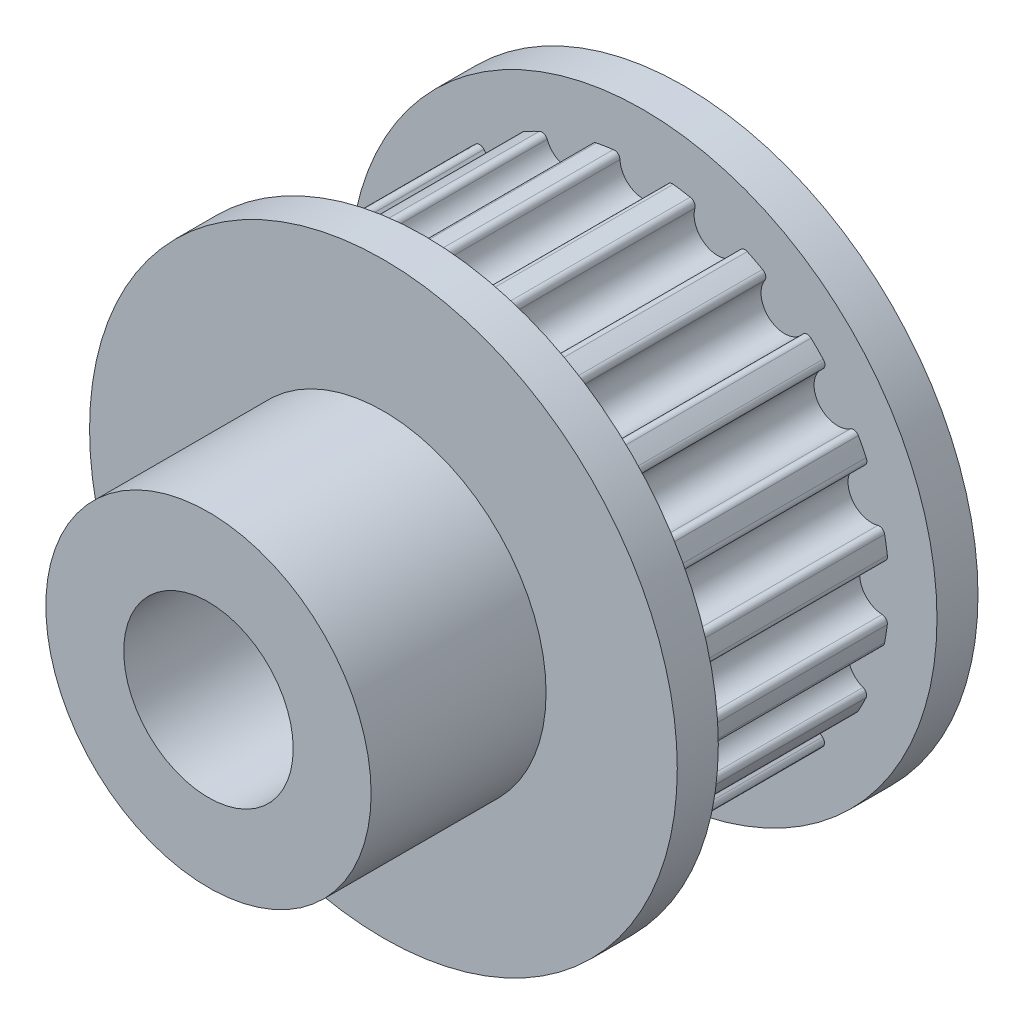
ISO-10303-21;
HEADER;
FILE_DESCRIPTION(('STEP AP214'),'2;1');
FILE_NAME('part.step','',(''),(''),'','','');
FILE_SCHEMA(('AUTOMOTIVE_DESIGN { 1 0 10303 214 1 1 1 1 }'));
ENDSEC;
DATA;
#1=APPLICATION_CONTEXT('core data for automotive mechanical design processes');
#2=APPLICATION_PROTOCOL_DEFINITION('international standard','automotive_design',2000,#1);
#3=PRODUCT_CONTEXT('',#1,'mechanical');
#4=PRODUCT('Part','Part','',(#3));
#5=PRODUCT_RELATED_PRODUCT_CATEGORY('part','',(#4));
#6=PRODUCT_DEFINITION_FORMATION('','',#4);
#7=PRODUCT_DEFINITION_CONTEXT('part definition',#1,'design');
#8=PRODUCT_DEFINITION('design','',#6,#7);
#9=PRODUCT_DEFINITION_SHAPE('','',#8);
#10=(LENGTH_UNIT() NAMED_UNIT(*) SI_UNIT(.MILLI.,.METRE.));
#11=(NAMED_UNIT(*) PLANE_ANGLE_UNIT() SI_UNIT($,.RADIAN.));
#12=(NAMED_UNIT(*) SI_UNIT($,.STERADIAN.) SOLID_ANGLE_UNIT());
#13=UNCERTAINTY_MEASURE_WITH_UNIT(LENGTH_MEASURE(1.E-05),#10,'distance_accuracy_value','');
#14=(GEOMETRIC_REPRESENTATION_CONTEXT(3) GLOBAL_UNCERTAINTY_ASSIGNED_CONTEXT((#13)) GLOBAL_UNIT_ASSIGNED_CONTEXT((#10,
#11,#12)) REPRESENTATION_CONTEXT('',''));
#15=CARTESIAN_POINT('',(0.,0.,0.));
#16=DIRECTION('',(0.,0.,1.));
#17=DIRECTION('',(1.,0.,0.));
#18=AXIS2_PLACEMENT_3D('',#15,#16,#17);
#19=CARTESIAN_POINT('',(0.,0.,1.5));
#20=DIRECTION('',(0.,0.,1.));
#21=DIRECTION('',(1.,0.,0.));
#22=AXIS2_PLACEMENT_3D('',#19,#20,#21);
#23=PLANE('',#22);
#24=CARTESIAN_POINT('',(0.,0.,1.5));
#25=DIRECTION('',(0.,0.,1.));
#26=DIRECTION('',(1.,0.,0.));
#27=AXIS2_PLACEMENT_3D('',#24,#25,#26);
#28=CIRCLE('',#27,10.75);
#29=CARTESIAN_POINT('',(10.75,0.,1.5));
#30=VERTEX_POINT('',#29);
#31=EDGE_CURVE('E960',#30,#30,#28,.T.);
#32=ORIENTED_EDGE('',*,*,#31,.T.);
#33=EDGE_LOOP('',(#32));
#34=FACE_BOUND('',#33,.T.);
#35=CARTESIAN_POINT('',(0.,0.,1.5));
#36=DIRECTION('',(0.,0.,1.));
#37=DIRECTION('',(-1.,0.,0.));
#38=AXIS2_PLACEMENT_3D('',#35,#36,#37);
#39=CIRCLE('',#38,9.00000000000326);
#40=CARTESIAN_POINT('',(-1.09254817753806,8.93343934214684,1.5));
#41=VERTEX_POINT('',#40);
#42=CARTESIAN_POINT('',(-1.71165073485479,8.835737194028,1.5));
#43=VERTEX_POINT('',#42);
#44=EDGE_CURVE('E573',#41,#43,#39,.T.);
#45=ORIENTED_EDGE('',*,*,#44,.F.);
#46=CARTESIAN_POINT('',(-1.05116965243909,8.73313978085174,1.5));
#47=DIRECTION('',(0.,0.,1.));
#48=DIRECTION('',(1.,0.,0.));
#49=AXIS2_PLACEMENT_3D('',#46,#47,#48);
#50=CIRCLE('',#49,0.204528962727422);
#51=CARTESIAN_POINT('',(-0.846860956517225,8.74262942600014,1.5));
#52=VERTEX_POINT('',#51);
#53=EDGE_CURVE('E570',#52,#41,#50,.T.);
#54=ORIENTED_EDGE('',*,*,#53,.F.);
#55=CARTESIAN_POINT('',(0.0142860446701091,8.78392272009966,1.5));
#56=DIRECTION('',(0.,0.,-1.));
#57=DIRECTION('',(1.,0.,0.));
#58=AXIS2_PLACEMENT_3D('',#55,#56,#57);
#59=CIRCLE('',#58,0.862136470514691);
#60=CARTESIAN_POINT('',(0.875433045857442,8.74262942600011,1.5));
#61=VERTEX_POINT('',#60);
#62=EDGE_CURVE('E296',#61,#52,#59,.T.);
#63=ORIENTED_EDGE('',*,*,#62,.F.);
#64=CARTESIAN_POINT('',(1.07614958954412,8.73300476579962,1.5));
#65=DIRECTION('',(0.,0.,1.));
#66=DIRECTION('',(-1.,0.,0.));
#67=AXIS2_PLACEMENT_3D('',#64,#65,#66);
#68=CIRCLE('',#67,0.200947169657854);
#69=CARTESIAN_POINT('',(1.10251636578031,8.93221460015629,1.5));
#70=VERTEX_POINT('',#69);
#71=EDGE_CURVE('E727',#70,#61,#68,.T.);
#72=ORIENTED_EDGE('',*,*,#71,.F.);
#73=CARTESIAN_POINT('',(0.,0.,1.5));
#74=DIRECTION('',(0.,0.,1.));
#75=DIRECTION('',(-1.,0.,0.));
#76=AXIS2_PLACEMENT_3D('',#73,#74,#75);
#77=CIRCLE('',#76,9.00000000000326);
#78=CARTESIAN_POINT('',(1.72150951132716,8.83382165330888,1.5));
#79=VERTEX_POINT('',#78);
#80=EDGE_CURVE('E725',#79,#70,#77,.T.);
#81=ORIENTED_EDGE('',*,*,#80,.F.);
#82=CARTESIAN_POINT('',(1.69896685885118,8.63053878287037,1.5));
#83=DIRECTION('',(0.,0.,1.));
#84=DIRECTION('',(1.,0.,0.));
#85=AXIS2_PLACEMENT_3D('',#82,#83,#84);
#86=CIRCLE('',#85,0.204528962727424);
#87=CARTESIAN_POINT('',(1.89620843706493,8.57642911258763,1.5));
#88=VERTEX_POINT('',#87);
#89=EDGE_CURVE('E542',#88,#79,#86,.T.);
#90=ORIENTED_EDGE('',*,*,#89,.F.);
#91=CARTESIAN_POINT('',(2.72796823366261,8.34959231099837,1.5));
#92=DIRECTION('',(0.,0.,-1.));
#93=DIRECTION('',(1.,0.,0.));
#94=AXIS2_PLACEMENT_3D('',#91,#92,#93);
#95=CIRCLE('',#94,0.862136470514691);
#96=CARTESIAN_POINT('',(3.53420737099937,8.04421099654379,1.5));
#97=VERTEX_POINT('',#96);
#98=EDGE_CURVE('E722',#97,#88,#95,.T.);
#99=ORIENTED_EDGE('',*,*,#98,.F.);
#100=CARTESIAN_POINT('',(3.72212596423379,7.9730325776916,1.5));
#101=DIRECTION('',(0.,0.,1.));
#102=DIRECTION('',(-1.,0.,0.));
#103=AXIS2_PLACEMENT_3D('',#100,#101,#102);
#104=CIRCLE('',#103,0.200947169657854);
#105=CARTESIAN_POINT('',(3.80876148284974,8.15434460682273,1.5));
#106=VERTEX_POINT('',#105);
#107=EDGE_CURVE('E720',#106,#97,#104,.T.);
#108=ORIENTED_EDGE('',*,*,#107,.F.);
#109=CARTESIAN_POINT('',(0.,0.,1.5));
#110=DIRECTION('',(0.,0.,1.));
#111=DIRECTION('',(-1.,0.,0.));
#112=AXIS2_PLACEMENT_3D('',#109,#110,#111);
#113=CIRCLE('',#112,9.00000000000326);
#114=CARTESIAN_POINT('',(4.36705385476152,7.86948795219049,1.5));
#115=VERTEX_POINT('',#114);
#116=EDGE_CURVE('E718',#115,#106,#113,.T.);
#117=ORIENTED_EDGE('',*,*,#116,.F.);
#118=CARTESIAN_POINT('',(4.28279665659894,7.68312051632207,1.5));
#119=DIRECTION('',(0.,0.,1.));
#120=DIRECTION('',(1.,0.,0.));
#121=AXIS2_PLACEMENT_3D('',#118,#119,#120);
#122=CIRCLE('',#121,0.204528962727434);
#123=CARTESIAN_POINT('',(4.45366373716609,7.5707081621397,1.5));
#124=VERTEX_POINT('',#123);
#125=EDGE_CURVE('E716',#124,#115,#122,.T.);
#126=ORIENTED_EDGE('',*,*,#125,.F.);
#127=CARTESIAN_POINT('',(5.17461788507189,7.09794563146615,1.5));
#128=DIRECTION('',(0.,0.,-1.));
#129=DIRECTION('',(1.,0.,0.));
#130=AXIS2_PLACEMENT_3D('',#127,#128,#129);
#131=CIRCLE('',#130,0.862136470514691);
#132=CARTESIAN_POINT('',(5.84702885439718,6.55836914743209,1.5));
#133=VERTEX_POINT('',#132);
#134=EDGE_CURVE('E714',#133,#124,#131,.T.);
#135=ORIENTED_EDGE('',*,*,#134,.F.);
#136=CARTESIAN_POINT('',(6.00375471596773,6.43260440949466,1.5));
#137=DIRECTION('',(0.,0.,1.));
#138=DIRECTION('',(-1.,0.,0.));
#139=AXIS2_PLACEMENT_3D('',#136,#137,#138);
#140=CIRCLE('',#139,0.200947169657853);
#141=CARTESIAN_POINT('',(6.14217848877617,6.5782705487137,1.5));
#142=VERTEX_POINT('',#141);
#143=EDGE_CURVE('E712',#142,#133,#140,.T.);
#144=ORIENTED_EDGE('',*,*,#143,.F.);
#145=CARTESIAN_POINT('',(0.,0.,1.5));
#146=DIRECTION('',(0.,0.,1.));
#147=DIRECTION('',(-1.,0.,0.));
#148=AXIS2_PLACEMENT_3D('',#145,#146,#147);
#149=CIRCLE('',#148,9.00000000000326);
#150=CARTESIAN_POINT('',(6.58512053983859,6.13483394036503,1.5));
#151=VERTEX_POINT('',#150);
#152=EDGE_CURVE('E710',#151,#142,#149,.T.);
#153=ORIENTED_EDGE('',*,*,#152,.F.);
#154=CARTESIAN_POINT('',(6.44739647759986,5.98362488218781,1.5));
#155=DIRECTION('',(0.,0.,1.));
#156=DIRECTION('',(1.,0.,0.));
#157=AXIS2_PLACEMENT_3D('',#154,#155,#156);
#158=CIRCLE('',#157,0.204528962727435);
#159=CARTESIAN_POINT('',(6.57516340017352,5.82391354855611,1.5));
#160=VERTEX_POINT('',#159);
#161=EDGE_CURVE('E708',#160,#151,#158,.T.);
#162=ORIENTED_EDGE('',*,*,#161,.F.);
#163=CARTESIAN_POINT('',(7.11473988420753,5.15150257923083,1.5));
#164=DIRECTION('',(0.,0.,-1.));
#165=DIRECTION('',(1.,0.,0.));
#166=AXIS2_PLACEMENT_3D('',#163,#164,#165);
#167=CIRCLE('',#166,0.862136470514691);
#168=CARTESIAN_POINT('',(7.58750241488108,4.43054843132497,1.5));
#169=VERTEX_POINT('',#168);
#170=EDGE_CURVE('E706',#169,#160,#167,.T.);
#171=ORIENTED_EDGE('',*,*,#170,.F.);
#172=CARTESIAN_POINT('',(7.69769412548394,4.26250810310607,1.5));
#173=DIRECTION('',(0.,0.,1.));
#174=DIRECTION('',(-1.,0.,0.));
#175=AXIS2_PLACEMENT_3D('',#172,#173,#174);
#176=CIRCLE('',#175,0.200947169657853);
#177=CARTESIAN_POINT('',(7.87435626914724,4.35826953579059,1.5));
#178=VERTEX_POINT('',#177);
#179=EDGE_CURVE('E704',#178,#169,#176,.T.);
#180=ORIENTED_EDGE('',*,*,#179,.F.);
#181=CARTESIAN_POINT('',(0.,0.,1.5));
#182=DIRECTION('',(0.,0.,1.));
#183=DIRECTION('',(-1.,0.,0.));
#184=AXIS2_PLACEMENT_3D('',#181,#182,#183);
#185=CIRCLE('',#184,9.00000000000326);
#186=CARTESIAN_POINT('',(8.15858974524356,3.79965963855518,1.5));
#187=VERTEX_POINT('',#186);
#188=EDGE_CURVE('E702',#187,#178,#185,.T.);
#189=ORIENTED_EDGE('',*,*,#188,.F.);
#190=CARTESIAN_POINT('',(7.98088020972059,3.698410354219,1.5));
#191=DIRECTION('',(0.,0.,1.));
#192=DIRECTION('',(1.,0.,0.));
#193=AXIS2_PLACEMENT_3D('',#190,#191,#192);
#194=CIRCLE('',#193,0.204528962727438);
#195=CARTESIAN_POINT('',(8.05304025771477,3.50703369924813,1.5));
#196=VERTEX_POINT('',#195);
#197=EDGE_CURVE('E700',#196,#187,#194,.T.);
#198=ORIENTED_EDGE('',*,*,#197,.F.);
#199=CARTESIAN_POINT('',(8.3584215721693,2.70079456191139,1.5));
#200=DIRECTION('',(0.,0.,-1.));
#201=DIRECTION('',(1.,0.,0.));
#202=AXIS2_PLACEMENT_3D('',#199,#200,#201);
#203=CIRCLE('',#202,0.862136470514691);
#204=CARTESIAN_POINT('',(8.58525837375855,1.86903476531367,1.5));
#205=VERTEX_POINT('',#204);
#206=EDGE_CURVE('E698',#205,#196,#203,.T.);
#207=ORIENTED_EDGE('',*,*,#206,.F.);
#208=CARTESIAN_POINT('',(8.63812960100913,1.67516780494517,1.5));
#209=DIRECTION('',(0.,0.,1.));
#210=DIRECTION('',(-1.,0.,0.));
#211=AXIS2_PLACEMENT_3D('',#208,#209,#210);
#212=CIRCLE('',#211,0.200947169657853);
#213=CARTESIAN_POINT('',(8.83573719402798,1.71165073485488,1.5));
#214=VERTEX_POINT('',#213);
#215=EDGE_CURVE('E696',#214,#205,#212,.T.);
#216=ORIENTED_EDGE('',*,*,#215,.F.);
#217=CARTESIAN_POINT('',(0.,0.,1.5));
#218=DIRECTION('',(0.,0.,1.));
#219=DIRECTION('',(-1.,0.,0.));
#220=AXIS2_PLACEMENT_3D('',#217,#218,#219);
#221=CIRCLE('',#220,9.00000000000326);
#222=CARTESIAN_POINT('',(8.93343934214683,1.09254817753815,1.5));
#223=VERTEX_POINT('',#222);
#224=EDGE_CURVE('E694',#223,#214,#221,.T.);
#225=ORIENTED_EDGE('',*,*,#224,.F.);
#226=CARTESIAN_POINT('',(8.73313978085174,1.05116965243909,1.5));
#227=DIRECTION('',(0.,0.,1.));
#228=DIRECTION('',(1.,0.,0.));
#229=AXIS2_PLACEMENT_3D('',#226,#227,#228);
#230=CIRCLE('',#229,0.204528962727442);
#231=CARTESIAN_POINT('',(8.74262942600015,0.846860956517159,1.5));
#232=VERTEX_POINT('',#231);
#233=EDGE_CURVE('E692',#232,#223,#230,.T.);
#234=ORIENTED_EDGE('',*,*,#233,.F.);
#235=CARTESIAN_POINT('',(8.78392272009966,-0.0142860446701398,1.5));
#236=DIRECTION('',(0.,0.,-1.));
#237=DIRECTION('',(1.,0.,0.));
#238=AXIS2_PLACEMENT_3D('',#235,#236,#237);
#239=CIRCLE('',#238,0.862136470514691);
#240=CARTESIAN_POINT('',(8.74262942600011,-0.875433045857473,1.5));
#241=VERTEX_POINT('',#240);
#242=EDGE_CURVE('E690',#241,#232,#239,.T.);
#243=ORIENTED_EDGE('',*,*,#242,.F.);
#244=CARTESIAN_POINT('',(8.73300476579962,-1.07614958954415,1.5));
#245=DIRECTION('',(0.,0.,1.));
#246=DIRECTION('',(-1.,0.,0.));
#247=AXIS2_PLACEMENT_3D('',#244,#245,#246);
#248=CIRCLE('',#247,0.200947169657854);
#249=CARTESIAN_POINT('',(8.93221460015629,-1.10251636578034,1.5));
#250=VERTEX_POINT('',#249);
#251=EDGE_CURVE('E688',#250,#241,#248,.T.);
#252=ORIENTED_EDGE('',*,*,#251,.F.);
#253=CARTESIAN_POINT('',(0.,0.,1.5));
#254=DIRECTION('',(0.,0.,1.));
#255=DIRECTION('',(-1.,0.,0.));
#256=AXIS2_PLACEMENT_3D('',#253,#254,#255);
#257=CIRCLE('',#256,9.00000000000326);
#258=CARTESIAN_POINT('',(8.8338216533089,-1.72150951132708,1.5));
#259=VERTEX_POINT('',#258);
#260=EDGE_CURVE('E686',#259,#250,#257,.T.);
#261=ORIENTED_EDGE('',*,*,#260,.F.);
#262=CARTESIAN_POINT('',(8.63053878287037,-1.69896685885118,1.5));
#263=DIRECTION('',(0.,0.,1.));
#264=DIRECTION('',(1.,0.,0.));
#265=AXIS2_PLACEMENT_3D('',#262,#263,#264);
#266=CIRCLE('',#265,0.204528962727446);
#267=CARTESIAN_POINT('',(8.57642911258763,-1.89620843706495,1.5));
#268=VERTEX_POINT('',#267);
#269=EDGE_CURVE('E684',#268,#259,#266,.T.);
#270=ORIENTED_EDGE('',*,*,#269,.F.);
#271=CARTESIAN_POINT('',(8.34959231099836,-2.72796823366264,1.5));
#272=DIRECTION('',(0.,0.,-1.));
#273=DIRECTION('',(1.,0.,0.));
#274=AXIS2_PLACEMENT_3D('',#271,#272,#273);
#275=CIRCLE('',#274,0.862136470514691);
#276=CARTESIAN_POINT('',(8.04421099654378,-3.5342073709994,1.5));
#277=VERTEX_POINT('',#276);
#278=EDGE_CURVE('E682',#277,#268,#275,.T.);
#279=ORIENTED_EDGE('',*,*,#278,.F.);
#280=CARTESIAN_POINT('',(7.97303257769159,-3.72212596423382,1.5));
#281=DIRECTION('',(0.,0.,1.));
#282=DIRECTION('',(-1.,0.,0.));
#283=AXIS2_PLACEMENT_3D('',#280,#281,#282);
#284=CIRCLE('',#283,0.200947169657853);
#285=CARTESIAN_POINT('',(8.15434460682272,-3.80876148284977,1.5));
#286=VERTEX_POINT('',#285);
#287=EDGE_CURVE('E680',#286,#277,#284,.T.);
#288=ORIENTED_EDGE('',*,*,#287,.F.);
#289=CARTESIAN_POINT('',(0.,0.,1.5));
#290=DIRECTION('',(0.,0.,1.));
#291=DIRECTION('',(-1.,0.,0.));
#292=AXIS2_PLACEMENT_3D('',#289,#290,#291);
#293=CIRCLE('',#292,9.00000000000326);
#294=CARTESIAN_POINT('',(7.86948795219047,-4.36705385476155,1.5));
#295=VERTEX_POINT('',#294);
#296=EDGE_CURVE('E678',#295,#286,#293,.T.);
#297=ORIENTED_EDGE('',*,*,#296,.F.);
#298=CARTESIAN_POINT('',(7.68312051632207,-4.28279665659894,1.5));
#299=DIRECTION('',(0.,0.,1.));
#300=DIRECTION('',(1.,0.,0.));
#301=AXIS2_PLACEMENT_3D('',#298,#299,#300);
#302=CIRCLE('',#301,0.204528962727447);
#303=CARTESIAN_POINT('',(7.57070816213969,-4.4536637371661,1.5));
#304=VERTEX_POINT('',#303);
#305=EDGE_CURVE('E676',#304,#295,#302,.T.);
#306=ORIENTED_EDGE('',*,*,#305,.F.);
#307=CARTESIAN_POINT('',(7.09794563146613,-5.17461788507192,1.5));
#308=DIRECTION('',(0.,0.,-1.));
#309=DIRECTION('',(1.,0.,0.));
#310=AXIS2_PLACEMENT_3D('',#307,#308,#309);
#311=CIRCLE('',#310,0.86213647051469);
#312=CARTESIAN_POINT('',(6.55836914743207,-5.8470288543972,1.5));
#313=VERTEX_POINT('',#312);
#314=EDGE_CURVE('E674',#313,#304,#311,.T.);
#315=ORIENTED_EDGE('',*,*,#314,.F.);
#316=CARTESIAN_POINT('',(6.43260440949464,-6.00375471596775,1.5));
#317=DIRECTION('',(0.,0.,1.));
#318=DIRECTION('',(-1.,0.,0.));
#319=AXIS2_PLACEMENT_3D('',#316,#317,#318);
#320=CIRCLE('',#319,0.200947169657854);
#321=CARTESIAN_POINT('',(6.57827054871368,-6.14217848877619,1.5));
#322=VERTEX_POINT('',#321);
#323=EDGE_CURVE('E672',#322,#313,#320,.T.);
#324=ORIENTED_EDGE('',*,*,#323,.F.);
#325=CARTESIAN_POINT('',(0.,0.,1.5));
#326=DIRECTION('',(0.,0.,1.));
#327=DIRECTION('',(-1.,0.,0.));
#328=AXIS2_PLACEMENT_3D('',#325,#326,#327);
#329=CIRCLE('',#328,9.00000000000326);
#330=CARTESIAN_POINT('',(6.13483394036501,-6.58512053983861,1.5));
#331=VERTEX_POINT('',#330);
#332=EDGE_CURVE('E670',#331,#322,#329,.T.);
#333=ORIENTED_EDGE('',*,*,#332,.F.);
#334=CARTESIAN_POINT('',(5.98362488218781,-6.44739647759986,1.5));
#335=DIRECTION('',(0.,0.,1.));
#336=DIRECTION('',(1.,0.,0.));
#337=AXIS2_PLACEMENT_3D('',#334,#335,#336);
#338=CIRCLE('',#337,0.204528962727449);
#339=CARTESIAN_POINT('',(5.8239135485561,-6.57516340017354,1.5));
#340=VERTEX_POINT('',#339);
#341=EDGE_CURVE('E668',#340,#331,#338,.T.);
#342=ORIENTED_EDGE('',*,*,#341,.F.);
#343=CARTESIAN_POINT('',(5.15150257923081,-7.11473988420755,1.5));
#344=DIRECTION('',(0.,0.,-1.));
#345=DIRECTION('',(1.,0.,0.));
#346=AXIS2_PLACEMENT_3D('',#343,#344,#345);
#347=CIRCLE('',#346,0.862136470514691);
#348=CARTESIAN_POINT('',(4.43054843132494,-7.58750241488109,1.5));
#349=VERTEX_POINT('',#348);
#350=EDGE_CURVE('E666',#349,#340,#347,.T.);
#351=ORIENTED_EDGE('',*,*,#350,.F.);
#352=CARTESIAN_POINT('',(4.26250810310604,-7.69769412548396,1.5));
#353=DIRECTION('',(0.,0.,1.));
#354=DIRECTION('',(-1.,0.,0.));
#355=AXIS2_PLACEMENT_3D('',#352,#353,#354);
#356=CIRCLE('',#355,0.200947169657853);
#357=CARTESIAN_POINT('',(4.35826953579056,-7.87435626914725,1.5));
#358=VERTEX_POINT('',#357);
#359=EDGE_CURVE('E664',#358,#349,#356,.T.);
#360=ORIENTED_EDGE('',*,*,#359,.F.);
#361=CARTESIAN_POINT('',(0.,0.,1.5));
#362=DIRECTION('',(0.,0.,1.));
#363=DIRECTION('',(-1.,0.,0.));
#364=AXIS2_PLACEMENT_3D('',#361,#362,#363);
#365=CIRCLE('',#364,9.00000000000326);
#366=CARTESIAN_POINT('',(3.79965963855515,-8.15858974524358,1.5));
#367=VERTEX_POINT('',#366);
#368=EDGE_CURVE('E662',#367,#358,#365,.T.);
#369=ORIENTED_EDGE('',*,*,#368,.F.);
#370=CARTESIAN_POINT('',(3.698410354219,-7.98088020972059,1.5));
#371=DIRECTION('',(0.,0.,1.));
#372=DIRECTION('',(1.,0.,0.));
#373=AXIS2_PLACEMENT_3D('',#370,#371,#372);
#374=CIRCLE('',#373,0.204528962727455);
#375=CARTESIAN_POINT('',(3.50703369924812,-8.05304025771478,1.5));
#376=VERTEX_POINT('',#375);
#377=EDGE_CURVE('E660',#376,#367,#374,.T.);
#378=ORIENTED_EDGE('',*,*,#377,.F.);
#379=CARTESIAN_POINT('',(2.70079456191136,-8.35842157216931,1.5));
#380=DIRECTION('',(0.,0.,-1.));
#381=DIRECTION('',(1.,0.,0.));
#382=AXIS2_PLACEMENT_3D('',#379,#380,#381);
#383=CIRCLE('',#382,0.862136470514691);
#384=CARTESIAN_POINT('',(1.86903476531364,-8.58525837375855,1.5));
#385=VERTEX_POINT('',#384);
#386=EDGE_CURVE('E658',#385,#376,#383,.T.);
#387=ORIENTED_EDGE('',*,*,#386,.F.);
#388=CARTESIAN_POINT('',(1.67516780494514,-8.63812960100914,1.5));
#389=DIRECTION('',(0.,0.,1.));
#390=DIRECTION('',(-1.,0.,0.));
#391=AXIS2_PLACEMENT_3D('',#388,#389,#390);
#392=CIRCLE('',#391,0.200947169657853);
#393=CARTESIAN_POINT('',(1.71165073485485,-8.83573719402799,1.5));
#394=VERTEX_POINT('',#393);
#395=EDGE_CURVE('E656',#394,#385,#392,.T.);
#396=ORIENTED_EDGE('',*,*,#395,.F.);
#397=CARTESIAN_POINT('',(0.,0.,1.5));
#398=DIRECTION('',(0.,0.,1.));
#399=DIRECTION('',(-1.,0.,0.));
#400=AXIS2_PLACEMENT_3D('',#397,#398,#399);
#401=CIRCLE('',#400,9.00000000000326);
#402=CARTESIAN_POINT('',(1.09254817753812,-8.93343934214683,1.5));
#403=VERTEX_POINT('',#402);
#404=EDGE_CURVE('E654',#403,#394,#401,.T.);
#405=ORIENTED_EDGE('',*,*,#404,.F.);
#406=CARTESIAN_POINT('',(1.05116965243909,-8.73313978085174,1.5));
#407=DIRECTION('',(0.,0.,1.));
#408=DIRECTION('',(1.,0.,0.));
#409=AXIS2_PLACEMENT_3D('',#406,#407,#408);
#410=CIRCLE('',#409,0.204528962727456);
#411=CARTESIAN_POINT('',(0.846860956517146,-8.74262942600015,1.5));
#412=VERTEX_POINT('',#411);
#413=EDGE_CURVE('E652',#412,#403,#410,.T.);
#414=ORIENTED_EDGE('',*,*,#413,.F.);
#415=CARTESIAN_POINT('',(-0.0142860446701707,-8.78392272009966,1.5));
#416=DIRECTION('',(0.,0.,-1.));
#417=DIRECTION('',(1.,0.,0.));
#418=AXIS2_PLACEMENT_3D('',#415,#416,#417);
#419=CIRCLE('',#418,0.862136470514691);
#420=CARTESIAN_POINT('',(-0.875433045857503,-8.74262942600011,1.5));
#421=VERTEX_POINT('',#420);
#422=EDGE_CURVE('E650',#421,#412,#419,.T.);
#423=ORIENTED_EDGE('',*,*,#422,.F.);
#424=CARTESIAN_POINT('',(-1.07614958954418,-8.73300476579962,1.5));
#425=DIRECTION('',(0.,0.,1.));
#426=DIRECTION('',(-1.,0.,0.));
#427=AXIS2_PLACEMENT_3D('',#424,#425,#426);
#428=CIRCLE('',#427,0.200947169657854);
#429=CARTESIAN_POINT('',(-1.10251636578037,-8.93221460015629,1.5));
#430=VERTEX_POINT('',#429);
#431=EDGE_CURVE('E648',#430,#421,#428,.T.);
#432=ORIENTED_EDGE('',*,*,#431,.F.);
#433=CARTESIAN_POINT('',(0.,0.,1.5));
#434=DIRECTION('',(0.,0.,1.));
#435=DIRECTION('',(-1.,0.,0.));
#436=AXIS2_PLACEMENT_3D('',#433,#434,#435);
#437=CIRCLE('',#436,9.00000000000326);
#438=CARTESIAN_POINT('',(-1.72150951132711,-8.83382165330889,1.5));
#439=VERTEX_POINT('',#438);
#440=EDGE_CURVE('E646',#439,#430,#437,.T.);
#441=ORIENTED_EDGE('',*,*,#440,.F.);
#442=CARTESIAN_POINT('',(-1.69896685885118,-8.63053878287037,1.5));
#443=DIRECTION('',(0.,0.,1.));
#444=DIRECTION('',(1.,0.,0.));
#445=AXIS2_PLACEMENT_3D('',#442,#443,#444);
#446=CIRCLE('',#445,0.204528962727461);
#447=CARTESIAN_POINT('',(-1.89620843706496,-8.57642911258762,1.5));
#448=VERTEX_POINT('',#447);
#449=EDGE_CURVE('E644',#448,#439,#446,.T.);
#450=ORIENTED_EDGE('',*,*,#449,.F.);
#451=CARTESIAN_POINT('',(-2.72796823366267,-8.34959231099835,1.5));
#452=DIRECTION('',(0.,0.,-1.));
#453=DIRECTION('',(1.,0.,0.));
#454=AXIS2_PLACEMENT_3D('',#451,#452,#453);
#455=CIRCLE('',#454,0.862136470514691);
#456=CARTESIAN_POINT('',(-3.53420737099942,-8.04421099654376,1.5));
#457=VERTEX_POINT('',#456);
#458=EDGE_CURVE('E642',#457,#448,#455,.T.);
#459=ORIENTED_EDGE('',*,*,#458,.F.);
#460=CARTESIAN_POINT('',(-3.72212596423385,-7.97303257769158,1.5));
#461=DIRECTION('',(0.,0.,1.));
#462=DIRECTION('',(-1.,0.,0.));
#463=AXIS2_PLACEMENT_3D('',#460,#461,#462);
#464=CIRCLE('',#463,0.200947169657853);
#465=CARTESIAN_POINT('',(-3.8087614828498,-8.1543446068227,1.5));
#466=VERTEX_POINT('',#465);
#467=EDGE_CURVE('E640',#466,#457,#464,.T.);
#468=ORIENTED_EDGE('',*,*,#467,.F.);
#469=CARTESIAN_POINT('',(0.,0.,1.5));
#470=DIRECTION('',(0.,0.,1.));
#471=DIRECTION('',(-1.,0.,0.));
#472=AXIS2_PLACEMENT_3D('',#469,#470,#471);
#473=CIRCLE('',#472,9.00000000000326);
#474=CARTESIAN_POINT('',(-4.36705385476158,-7.86948795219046,1.5));
#475=VERTEX_POINT('',#474);
#476=EDGE_CURVE('E638',#475,#466,#473,.T.);
#477=ORIENTED_EDGE('',*,*,#476,.F.);
#478=CARTESIAN_POINT('',(-4.28279665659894,-7.68312051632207,1.5));
#479=DIRECTION('',(0.,0.,1.));
#480=DIRECTION('',(1.,0.,0.));
#481=AXIS2_PLACEMENT_3D('',#478,#479,#480);
#482=CIRCLE('',#481,0.204528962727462);
#483=CARTESIAN_POINT('',(-4.45366373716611,-7.57070816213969,1.5));
#484=VERTEX_POINT('',#483);
#485=EDGE_CURVE('E636',#484,#475,#482,.T.);
#486=ORIENTED_EDGE('',*,*,#485,.F.);
#487=CARTESIAN_POINT('',(-5.17461788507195,-7.09794563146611,1.5));
#488=DIRECTION('',(0.,0.,-1.));
#489=DIRECTION('',(1.,0.,0.));
#490=AXIS2_PLACEMENT_3D('',#487,#488,#489);
#491=CIRCLE('',#490,0.862136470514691);
#492=CARTESIAN_POINT('',(-5.84702885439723,-6.55836914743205,1.5));
#493=VERTEX_POINT('',#492);
#494=EDGE_CURVE('E634',#493,#484,#491,.T.);
#495=ORIENTED_EDGE('',*,*,#494,.F.);
#496=CARTESIAN_POINT('',(-6.00375471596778,-6.43260440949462,1.5));
#497=DIRECTION('',(0.,0.,1.));
#498=DIRECTION('',(-1.,0.,0.));
#499=AXIS2_PLACEMENT_3D('',#496,#497,#498);
#500=CIRCLE('',#499,0.200947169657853);
#501=CARTESIAN_POINT('',(-6.14217848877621,-6.57827054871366,1.5));
#502=VERTEX_POINT('',#501);
#503=EDGE_CURVE('E632',#502,#493,#500,.T.);
#504=ORIENTED_EDGE('',*,*,#503,.F.);
#505=CARTESIAN_POINT('',(0.,0.,1.5));
#506=DIRECTION('',(0.,0.,1.));
#507=DIRECTION('',(-1.,0.,0.));
#508=AXIS2_PLACEMENT_3D('',#505,#506,#507);
#509=CIRCLE('',#508,9.00000000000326);
#510=CARTESIAN_POINT('',(-6.58512053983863,-6.13483394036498,1.5));
#511=VERTEX_POINT('',#510);
#512=EDGE_CURVE('E630',#511,#502,#509,.T.);
#513=ORIENTED_EDGE('',*,*,#512,.F.);
#514=CARTESIAN_POINT('',(-6.44739647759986,-5.98362488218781,1.5));
#515=DIRECTION('',(0.,0.,1.));
#516=DIRECTION('',(1.,0.,0.));
#517=AXIS2_PLACEMENT_3D('',#514,#515,#516);
#518=CIRCLE('',#517,0.204528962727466);
#519=CARTESIAN_POINT('',(-6.57516340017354,-5.82391354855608,1.5));
#520=VERTEX_POINT('',#519);
#521=EDGE_CURVE('E628',#520,#511,#518,.T.);
#522=ORIENTED_EDGE('',*,*,#521,.F.);
#523=CARTESIAN_POINT('',(-7.11473988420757,-5.15150257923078,1.5));
#524=DIRECTION('',(0.,0.,-1.));
#525=DIRECTION('',(1.,0.,0.));
#526=AXIS2_PLACEMENT_3D('',#523,#524,#525);
#527=CIRCLE('',#526,0.862136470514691);
#528=CARTESIAN_POINT('',(-7.58750241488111,-4.43054843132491,1.5));
#529=VERTEX_POINT('',#528);
#530=EDGE_CURVE('E626',#529,#520,#527,.T.);
#531=ORIENTED_EDGE('',*,*,#530,.F.);
#532=CARTESIAN_POINT('',(-7.69769412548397,-4.26250810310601,1.5));
#533=DIRECTION('',(0.,0.,1.));
#534=DIRECTION('',(-1.,0.,0.));
#535=AXIS2_PLACEMENT_3D('',#532,#533,#534);
#536=CIRCLE('',#535,0.200947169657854);
#537=CARTESIAN_POINT('',(-7.87435626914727,-4.35826953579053,1.5));
#538=VERTEX_POINT('',#537);
#539=EDGE_CURVE('E624',#538,#529,#536,.T.);
#540=ORIENTED_EDGE('',*,*,#539,.F.);
#541=CARTESIAN_POINT('',(0.,0.,1.5));
#542=DIRECTION('',(0.,0.,1.));
#543=DIRECTION('',(-1.,0.,0.));
#544=AXIS2_PLACEMENT_3D('',#541,#542,#543);
#545=CIRCLE('',#544,9.00000000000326);
#546=CARTESIAN_POINT('',(-8.15858974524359,-3.79965963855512,1.5));
#547=VERTEX_POINT('',#546);
#548=EDGE_CURVE('E622',#547,#538,#545,.T.);
#549=ORIENTED_EDGE('',*,*,#548,.F.);
#550=CARTESIAN_POINT('',(-7.98088020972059,-3.698410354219,1.5));
#551=DIRECTION('',(0.,0.,1.));
#552=DIRECTION('',(1.,0.,0.));
#553=AXIS2_PLACEMENT_3D('',#550,#551,#552);
#554=CIRCLE('',#553,0.204528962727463);
#555=CARTESIAN_POINT('',(-8.05304025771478,-3.50703369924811,1.5));
#556=VERTEX_POINT('',#555);
#557=EDGE_CURVE('E620',#556,#547,#554,.T.);
#558=ORIENTED_EDGE('',*,*,#557,.F.);
#559=CARTESIAN_POINT('',(-8.35842157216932,-2.70079456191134,1.5));
#560=DIRECTION('',(0.,0.,-1.));
#561=DIRECTION('',(1.,0.,0.));
#562=AXIS2_PLACEMENT_3D('',#559,#560,#561);
#563=CIRCLE('',#562,0.862136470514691);
#564=CARTESIAN_POINT('',(-8.58525837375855,-1.86903476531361,1.5));
#565=VERTEX_POINT('',#564);
#566=EDGE_CURVE('E618',#565,#556,#563,.T.);
#567=ORIENTED_EDGE('',*,*,#566,.F.);
#568=CARTESIAN_POINT('',(-8.63812960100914,-1.67516780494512,1.5));
#569=DIRECTION('',(0.,0.,1.));
#570=DIRECTION('',(-1.,0.,0.));
#571=AXIS2_PLACEMENT_3D('',#568,#569,#570);
#572=CIRCLE('',#571,0.200947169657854);
#573=CARTESIAN_POINT('',(-8.83573719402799,-1.71165073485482,1.5));
#574=VERTEX_POINT('',#573);
#575=EDGE_CURVE('E616',#574,#565,#572,.T.);
#576=ORIENTED_EDGE('',*,*,#575,.F.);
#577=CARTESIAN_POINT('',(0.,0.,1.5));
#578=DIRECTION('',(0.,0.,1.));
#579=DIRECTION('',(-1.,0.,0.));
#580=AXIS2_PLACEMENT_3D('',#577,#578,#579);
#581=CIRCLE('',#580,9.00000000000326);
#582=CARTESIAN_POINT('',(-8.93343934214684,-1.09254817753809,1.5));
#583=VERTEX_POINT('',#582);
#584=EDGE_CURVE('E614',#583,#574,#581,.T.);
#585=ORIENTED_EDGE('',*,*,#584,.F.);
#586=CARTESIAN_POINT('',(-8.73313978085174,-1.05116965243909,1.5));
#587=DIRECTION('',(0.,0.,1.));
#588=DIRECTION('',(1.,0.,0.));
#589=AXIS2_PLACEMENT_3D('',#586,#587,#588);
#590=CIRCLE('',#589,0.204528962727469);
#591=CARTESIAN_POINT('',(-8.74262942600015,-0.846860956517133,1.5));
#592=VERTEX_POINT('',#591);
#593=EDGE_CURVE('E612',#592,#583,#590,.T.);
#594=ORIENTED_EDGE('',*,*,#593,.F.);
#595=CARTESIAN_POINT('',(-8.78392272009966,0.0142860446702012,1.5));
#596=DIRECTION('',(0.,0.,-1.));
#597=DIRECTION('',(1.,0.,0.));
#598=AXIS2_PLACEMENT_3D('',#595,#596,#597);
#599=CIRCLE('',#598,0.862136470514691);
#600=CARTESIAN_POINT('',(-8.7426294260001,0.875433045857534,1.5));
#601=VERTEX_POINT('',#600);
#602=EDGE_CURVE('E610',#601,#592,#599,.T.);
#603=ORIENTED_EDGE('',*,*,#602,.F.);
#604=CARTESIAN_POINT('',(-8.73300476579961,1.07614958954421,1.5));
#605=DIRECTION('',(0.,0.,1.));
#606=DIRECTION('',(-1.,0.,0.));
#607=AXIS2_PLACEMENT_3D('',#604,#605,#606);
#608=CIRCLE('',#607,0.200947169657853);
#609=CARTESIAN_POINT('',(-8.93221460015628,1.1025163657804,1.5));
#610=VERTEX_POINT('',#609);
#611=EDGE_CURVE('E608',#610,#601,#608,.T.);
#612=ORIENTED_EDGE('',*,*,#611,.F.);
#613=CARTESIAN_POINT('',(0.,0.,1.5));
#614=DIRECTION('',(0.,0.,1.));
#615=DIRECTION('',(-1.,0.,0.));
#616=AXIS2_PLACEMENT_3D('',#613,#614,#615);
#617=CIRCLE('',#616,9.00000000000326);
#618=CARTESIAN_POINT('',(-8.83382165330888,1.72150951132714,1.5));
#619=VERTEX_POINT('',#618);
#620=EDGE_CURVE('E606',#619,#610,#617,.T.);
#621=ORIENTED_EDGE('',*,*,#620,.F.);
#622=CARTESIAN_POINT('',(-8.63053878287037,1.69896685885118,1.5));
#623=DIRECTION('',(0.,0.,1.));
#624=DIRECTION('',(1.,0.,0.));
#625=AXIS2_PLACEMENT_3D('',#622,#623,#624);
#626=CIRCLE('',#625,0.204528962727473);
#627=CARTESIAN_POINT('',(-8.57642911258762,1.89620843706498,1.5));
#628=VERTEX_POINT('',#627);
#629=EDGE_CURVE('E604',#628,#619,#626,.T.);
#630=ORIENTED_EDGE('',*,*,#629,.F.);
#631=CARTESIAN_POINT('',(-8.34959231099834,2.72796823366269,1.5));
#632=DIRECTION('',(0.,0.,-1.));
#633=DIRECTION('',(1.,0.,0.));
#634=AXIS2_PLACEMENT_3D('',#631,#632,#633);
#635=CIRCLE('',#634,0.862136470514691);
#636=CARTESIAN_POINT('',(-8.04421099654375,3.53420737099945,1.5));
#637=VERTEX_POINT('',#636);
#638=EDGE_CURVE('E602',#637,#628,#635,.T.);
#639=ORIENTED_EDGE('',*,*,#638,.F.);
#640=CARTESIAN_POINT('',(-7.97303257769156,3.72212596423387,1.5));
#641=DIRECTION('',(0.,0.,1.));
#642=DIRECTION('',(-1.,0.,0.));
#643=AXIS2_PLACEMENT_3D('',#640,#641,#642);
#644=CIRCLE('',#643,0.200947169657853);
#645=CARTESIAN_POINT('',(-8.15434460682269,3.80876148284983,1.5));
#646=VERTEX_POINT('',#645);
#647=EDGE_CURVE('E600',#646,#637,#644,.T.);
#648=ORIENTED_EDGE('',*,*,#647,.F.);
#649=CARTESIAN_POINT('',(0.,0.,1.5));
#650=DIRECTION('',(0.,0.,1.));
#651=DIRECTION('',(-1.,0.,0.));
#652=AXIS2_PLACEMENT_3D('',#649,#650,#651);
#653=CIRCLE('',#652,9.00000000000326);
#654=CARTESIAN_POINT('',(-7.86948795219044,4.36705385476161,1.5));
#655=VERTEX_POINT('',#654);
#656=EDGE_CURVE('E598',#655,#646,#653,.T.);
#657=ORIENTED_EDGE('',*,*,#656,.F.);
#658=CARTESIAN_POINT('',(-7.68312051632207,4.28279665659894,1.5));
#659=DIRECTION('',(0.,0.,1.));
#660=DIRECTION('',(1.,0.,0.));
#661=AXIS2_PLACEMENT_3D('',#658,#659,#660);
#662=CIRCLE('',#661,0.204528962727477);
#663=CARTESIAN_POINT('',(-7.57070816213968,4.45366373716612,1.5));
#664=VERTEX_POINT('',#663);
#665=EDGE_CURVE('E596',#664,#655,#662,.T.);
#666=ORIENTED_EDGE('',*,*,#665,.F.);
#667=CARTESIAN_POINT('',(-7.09794563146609,5.17461788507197,1.5));
#668=DIRECTION('',(0.,0.,-1.));
#669=DIRECTION('',(1.,0.,0.));
#670=AXIS2_PLACEMENT_3D('',#667,#668,#669);
#671=CIRCLE('',#670,0.862136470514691);
#672=CARTESIAN_POINT('',(-6.55836914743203,5.84702885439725,1.5));
#673=VERTEX_POINT('',#672);
#674=EDGE_CURVE('E594',#673,#664,#671,.T.);
#675=ORIENTED_EDGE('',*,*,#674,.F.);
#676=CARTESIAN_POINT('',(-6.43260440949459,6.0037547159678,1.5));
#677=DIRECTION('',(0.,0.,1.));
#678=DIRECTION('',(-1.,0.,0.));
#679=AXIS2_PLACEMENT_3D('',#676,#677,#678);
#680=CIRCLE('',#679,0.200947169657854);
#681=CARTESIAN_POINT('',(-6.57827054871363,6.14217848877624,1.5));
#682=VERTEX_POINT('',#681);
#683=EDGE_CURVE('E592',#682,#673,#680,.T.);
#684=ORIENTED_EDGE('',*,*,#683,.F.);
#685=CARTESIAN_POINT('',(0.,0.,1.5));
#686=DIRECTION('',(0.,0.,1.));
#687=DIRECTION('',(-1.,0.,0.));
#688=AXIS2_PLACEMENT_3D('',#685,#686,#687);
#689=CIRCLE('',#688,9.00000000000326);
#690=CARTESIAN_POINT('',(-6.13483394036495,6.58512053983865,1.5));
#691=VERTEX_POINT('',#690);
#692=EDGE_CURVE('E590',#691,#682,#689,.T.);
#693=ORIENTED_EDGE('',*,*,#692,.F.);
#694=CARTESIAN_POINT('',(-5.98362488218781,6.44739647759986,1.5));
#695=DIRECTION('',(0.,0.,1.));
#696=DIRECTION('',(1.,0.,0.));
#697=AXIS2_PLACEMENT_3D('',#694,#695,#696);
#698=CIRCLE('',#697,0.20452896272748);
#699=CARTESIAN_POINT('',(-5.82391354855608,6.57516340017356,1.5));
#700=VERTEX_POINT('',#699);
#701=EDGE_CURVE('E588',#700,#691,#698,.T.);
#702=ORIENTED_EDGE('',*,*,#701,.F.);
#703=CARTESIAN_POINT('',(-5.15150257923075,7.11473988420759,1.5));
#704=DIRECTION('',(0.,0.,-1.));
#705=DIRECTION('',(1.,0.,0.));
#706=AXIS2_PLACEMENT_3D('',#703,#704,#705);
#707=CIRCLE('',#706,0.862136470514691);
#708=CARTESIAN_POINT('',(-4.43054843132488,7.58750241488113,1.5));
#709=VERTEX_POINT('',#708);
#710=EDGE_CURVE('E586',#709,#700,#707,.T.);
#711=ORIENTED_EDGE('',*,*,#710,.F.);
#712=CARTESIAN_POINT('',(-4.26250810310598,7.69769412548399,1.5));
#713=DIRECTION('',(0.,0.,1.));
#714=DIRECTION('',(-1.,0.,0.));
#715=AXIS2_PLACEMENT_3D('',#712,#713,#714);
#716=CIRCLE('',#715,0.200947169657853);
#717=CARTESIAN_POINT('',(-4.3582695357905,7.87435626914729,1.5));
#718=VERTEX_POINT('',#717);
#719=EDGE_CURVE('E584',#718,#709,#716,.T.);
#720=ORIENTED_EDGE('',*,*,#719,.F.);
#721=CARTESIAN_POINT('',(0.,0.,1.5));
#722=DIRECTION('',(0.,0.,1.));
#723=DIRECTION('',(-1.,0.,0.));
#724=AXIS2_PLACEMENT_3D('',#721,#722,#723);
#725=CIRCLE('',#724,9.00000000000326);
#726=CARTESIAN_POINT('',(-3.79965963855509,8.1585897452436,1.5));
#727=VERTEX_POINT('',#726);
#728=EDGE_CURVE('E582',#727,#718,#725,.T.);
#729=ORIENTED_EDGE('',*,*,#728,.F.);
#730=CARTESIAN_POINT('',(-3.698410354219,7.98088020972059,1.5));
#731=DIRECTION('',(0.,0.,1.));
#732=DIRECTION('',(1.,0.,0.));
#733=AXIS2_PLACEMENT_3D('',#730,#731,#732);
#734=CIRCLE('',#733,0.204528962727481);
#735=CARTESIAN_POINT('',(-3.5070336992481,8.05304025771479,1.5));
#736=VERTEX_POINT('',#735);
#737=EDGE_CURVE('E580',#736,#727,#734,.T.);
#738=ORIENTED_EDGE('',*,*,#737,.F.);
#739=CARTESIAN_POINT('',(-2.70079456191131,8.35842157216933,1.5));
#740=DIRECTION('',(0.,0.,-1.));
#741=DIRECTION('',(1.,0.,0.));
#742=AXIS2_PLACEMENT_3D('',#739,#740,#741);
#743=CIRCLE('',#742,0.862136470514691);
#744=CARTESIAN_POINT('',(-1.86903476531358,8.58525837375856,1.5));
#745=VERTEX_POINT('',#744);
#746=EDGE_CURVE('E578',#745,#736,#743,.T.);
#747=ORIENTED_EDGE('',*,*,#746,.F.);
#748=CARTESIAN_POINT('',(-1.67516780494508,8.63812960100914,1.5));
#749=DIRECTION('',(0.,0.,1.));
#750=DIRECTION('',(-1.,0.,0.));
#751=AXIS2_PLACEMENT_3D('',#748,#749,#750);
#752=CIRCLE('',#751,0.200947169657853);
#753=EDGE_CURVE('E576',#43,#745,#752,.T.);
#754=ORIENTED_EDGE('',*,*,#753,.F.);
#755=EDGE_LOOP('',(#45,#54,#63,#72,#81,#90,#99,#108,#117,#126,#135,#144,#153,#162,#171,#180,
#189,#198,#207,#216,#225,#234,#243,#252,#261,#270,#279,#288,#297,#306,#315,#324,#333,#342,#351,
#360,#369,#378,#387,#396,#405,#414,#423,#432,#441,#450,#459,#468,#477,#486,#495,#504,#513,#522,
#531,#540,#549,#558,#567,#576,#585,#594,#603,#612,#621,#630,#639,#648,#657,#666,#675,#684,#693,
#702,#711,#720,#729,#738,#747,#754));
#756=FACE_BOUND('',#755,.T.);
#757=ADVANCED_FACE('F32',(#34,#756),#23,.T.);
#758=CARTESIAN_POINT('',(0.,0.,17.4));
#759=DIRECTION('',(0.,0.,1.));
#760=DIRECTION('',(1.,0.,0.));
#761=AXIS2_PLACEMENT_3D('',#758,#759,#760);
#762=PLANE('',#761);
#763=CARTESIAN_POINT('',(0.,0.,17.4));
#764=DIRECTION('',(0.,0.,1.));
#765=DIRECTION('',(1.,0.,0.));
#766=AXIS2_PLACEMENT_3D('',#763,#764,#765);
#767=CIRCLE('',#766,5.95);
#768=CARTESIAN_POINT('',(5.95,0.,17.4));
#769=VERTEX_POINT('',#768);
#770=EDGE_CURVE('E11',#769,#769,#767,.T.);
#771=ORIENTED_EDGE('',*,*,#770,.T.);
#772=EDGE_LOOP('',(#771));
#773=FACE_BOUND('',#772,.T.);
#774=CARTESIAN_POINT('',(0.,0.,17.4));
#775=DIRECTION('',(0.,0.,1.));
#776=DIRECTION('',(1.,0.,0.));
#777=AXIS2_PLACEMENT_3D('',#774,#775,#776);
#778=CIRCLE('',#777,3.1);
#779=CARTESIAN_POINT('',(3.1,0.,17.4));
#780=VERTEX_POINT('',#779);
#781=EDGE_CURVE('E40',#780,#780,#778,.T.);
#782=ORIENTED_EDGE('',*,*,#781,.F.);
#783=EDGE_LOOP('',(#782));
#784=FACE_BOUND('',#783,.T.);
#785=ADVANCED_FACE('F988',(#773,#784),#762,.T.);
#786=CARTESIAN_POINT('',(0.,0.,0.));
#787=DIRECTION('',(0.,0.,1.));
#788=DIRECTION('',(1.,0.,0.));
#789=AXIS2_PLACEMENT_3D('',#786,#787,#788);
#790=PLANE('',#789);
#791=CARTESIAN_POINT('',(0.,0.,0.));
#792=DIRECTION('',(0.,0.,1.));
#793=DIRECTION('',(1.,0.,0.));
#794=AXIS2_PLACEMENT_3D('',#791,#792,#793);
#795=CIRCLE('',#794,3.1);
#796=CARTESIAN_POINT('',(3.1,0.,0.));
#797=VERTEX_POINT('',#796);
#798=EDGE_CURVE('E963',#797,#797,#795,.T.);
#799=ORIENTED_EDGE('',*,*,#798,.T.);
#800=EDGE_LOOP('',(#799));
#801=FACE_BOUND('',#800,.T.);
#802=CARTESIAN_POINT('',(0.,0.,0.));
#803=DIRECTION('',(0.,0.,1.));
#804=DIRECTION('',(1.,0.,0.));
#805=AXIS2_PLACEMENT_3D('',#802,#803,#804);
#806=CIRCLE('',#805,10.75);
#807=CARTESIAN_POINT('',(10.75,0.,0.));
#808=VERTEX_POINT('',#807);
#809=EDGE_CURVE('E959',#808,#808,#806,.T.);
#810=ORIENTED_EDGE('',*,*,#809,.F.);
#811=EDGE_LOOP('',(#810));
#812=FACE_BOUND('',#811,.T.);
#813=ADVANCED_FACE('F970',(#801,#812),#790,.F.);
#814=CARTESIAN_POINT('',(0.,0.,17.4));
#815=DIRECTION('',(0.,0.,-1.));
#816=DIRECTION('',(-1.,0.,0.));
#817=AXIS2_PLACEMENT_3D('',#814,#815,#816);
#818=CYLINDRICAL_SURFACE('',#817,5.95);
#819=CARTESIAN_POINT('',(0.,0.,11.));
#820=DIRECTION('',(0.,0.,1.));
#821=DIRECTION('',(1.,0.,0.));
#822=AXIS2_PLACEMENT_3D('',#819,#820,#821);
#823=CIRCLE('',#822,5.95);
#824=CARTESIAN_POINT('',(5.95,0.,11.));
#825=VERTEX_POINT('',#824);
#826=EDGE_CURVE('E1326',#825,#825,#823,.T.);
#827=ORIENTED_EDGE('',*,*,#826,.T.);
#828=EDGE_LOOP('',(#827));
#829=FACE_BOUND('',#828,.T.);
#830=ORIENTED_EDGE('',*,*,#770,.F.);
#831=EDGE_LOOP('',(#830));
#832=FACE_BOUND('',#831,.T.);
#833=ADVANCED_FACE('F34',(#829,#832),#818,.T.);
#834=CARTESIAN_POINT('',(0.,0.,17.4));
#835=DIRECTION('',(0.,0.,-1.));
#836=DIRECTION('',(-1.,0.,0.));
#837=AXIS2_PLACEMENT_3D('',#834,#835,#836);
#838=CYLINDRICAL_SURFACE('',#837,3.1);
#839=ORIENTED_EDGE('',*,*,#781,.T.);
#840=EDGE_LOOP('',(#839));
#841=FACE_BOUND('',#840,.T.);
#842=ORIENTED_EDGE('',*,*,#798,.F.);
#843=EDGE_LOOP('',(#842));
#844=FACE_BOUND('',#843,.T.);
#845=ADVANCED_FACE('F973',(#841,#844),#838,.F.);
#846=CARTESIAN_POINT('',(0.,0.,1.5));
#847=DIRECTION('',(0.,0.,-1.));
#848=DIRECTION('',(-1.,0.,0.));
#849=AXIS2_PLACEMENT_3D('',#846,#847,#848);
#850=CYLINDRICAL_SURFACE('',#849,10.75);
#851=ORIENTED_EDGE('',*,*,#31,.F.);
#852=EDGE_LOOP('',(#851));
#853=FACE_BOUND('',#852,.T.);
#854=ORIENTED_EDGE('',*,*,#809,.T.);
#855=EDGE_LOOP('',(#854));
#856=FACE_BOUND('',#855,.T.);
#857=ADVANCED_FACE('F975',(#853,#856),#850,.T.);
#858=CARTESIAN_POINT('',(-1.05116965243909,8.73313978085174,9.5));
#859=DIRECTION('',(0.,0.,-1.));
#860=DIRECTION('',(-1.,0.,0.));
#861=AXIS2_PLACEMENT_3D('',#858,#859,#860);
#862=CYLINDRICAL_SURFACE('',#861,0.204528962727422);
#863=ORIENTED_EDGE('',*,*,#53,.T.);
#864=DIRECTION('',(0.,0.,-1.));
#865=VECTOR('',#864,1.);
#866=CARTESIAN_POINT('',(-1.09254817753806,8.93343934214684,9.5));
#867=LINE('',#866,#865);
#868=CARTESIAN_POINT('',(-1.09254817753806,8.93343934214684,9.5));
#869=VERTEX_POINT('',#868);
#870=EDGE_CURVE('E957',#869,#41,#867,.T.);
#871=ORIENTED_EDGE('',*,*,#870,.F.);
#872=CARTESIAN_POINT('',(-1.05116965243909,8.73313978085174,9.5));
#873=DIRECTION('',(0.,0.,1.));
#874=DIRECTION('',(1.,0.,0.));
#875=AXIS2_PLACEMENT_3D('',#872,#873,#874);
#876=CIRCLE('',#875,0.204528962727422);
#877=CARTESIAN_POINT('',(-0.846860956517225,8.74262942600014,9.5));
#878=VERTEX_POINT('',#877);
#879=EDGE_CURVE('E730',#878,#869,#876,.T.);
#880=ORIENTED_EDGE('',*,*,#879,.F.);
#881=DIRECTION('',(0.,0.,-1.));
#882=VECTOR('',#881,1.);
#883=CARTESIAN_POINT('',(-0.846860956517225,8.74262942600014,9.5));
#884=LINE('',#883,#882);
#885=EDGE_CURVE('E569',#878,#52,#884,.T.);
#886=ORIENTED_EDGE('',*,*,#885,.T.);
#887=EDGE_LOOP('',(#863,#871,#880,#886));
#888=FACE_BOUND('',#887,.T.);
#889=ADVANCED_FACE('F982',(#888),#862,.T.);
#890=CARTESIAN_POINT('',(0.,0.,9.5));
#891=DIRECTION('',(0.,0.,-1.));
#892=DIRECTION('',(-1.,0.,0.));
#893=AXIS2_PLACEMENT_3D('',#890,#891,#892);
#894=CYLINDRICAL_SURFACE('',#893,9.00000000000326);
#895=ORIENTED_EDGE('',*,*,#44,.T.);
#896=DIRECTION('',(0.,0.,-1.));
#897=VECTOR('',#896,1.);
#898=CARTESIAN_POINT('',(-1.71165073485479,8.835737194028,9.5));
#899=LINE('',#898,#897);
#900=CARTESIAN_POINT('',(-1.71165073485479,8.835737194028,9.5));
#901=VERTEX_POINT('',#900);
#902=EDGE_CURVE('E954',#901,#43,#899,.T.);
#903=ORIENTED_EDGE('',*,*,#902,.F.);
#904=CARTESIAN_POINT('',(0.,0.,9.5));
#905=DIRECTION('',(0.,0.,1.));
#906=DIRECTION('',(-1.,0.,0.));
#907=AXIS2_PLACEMENT_3D('',#904,#905,#906);
#908=CIRCLE('',#907,9.00000000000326);
#909=EDGE_CURVE('E304',#869,#901,#908,.T.);
#910=ORIENTED_EDGE('',*,*,#909,.F.);
#911=ORIENTED_EDGE('',*,*,#870,.T.);
#912=EDGE_LOOP('',(#895,#903,#910,#911));
#913=FACE_BOUND('',#912,.T.);
#914=ADVANCED_FACE('F999',(#913),#894,.T.);
#915=CARTESIAN_POINT('',(-1.67516780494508,8.63812960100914,9.5));
#916=DIRECTION('',(0.,0.,-1.));
#917=DIRECTION('',(-1.,0.,0.));
#918=AXIS2_PLACEMENT_3D('',#915,#916,#917);
#919=CYLINDRICAL_SURFACE('',#918,0.200947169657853);
#920=ORIENTED_EDGE('',*,*,#753,.T.);
#921=DIRECTION('',(0.,0.,-1.));
#922=VECTOR('',#921,1.);
#923=CARTESIAN_POINT('',(-1.86903476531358,8.58525837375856,9.5));
#924=LINE('',#923,#922);
#925=CARTESIAN_POINT('',(-1.86903476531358,8.58525837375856,9.5));
#926=VERTEX_POINT('',#925);
#927=EDGE_CURVE('E951',#926,#745,#924,.T.);
#928=ORIENTED_EDGE('',*,*,#927,.F.);
#929=CARTESIAN_POINT('',(-1.67516780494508,8.63812960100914,9.5));
#930=DIRECTION('',(0.,0.,1.));
#931=DIRECTION('',(-1.,0.,0.));
#932=AXIS2_PLACEMENT_3D('',#929,#930,#931);
#933=CIRCLE('',#932,0.200947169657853);
#934=EDGE_CURVE('E1336',#901,#926,#933,.T.);
#935=ORIENTED_EDGE('',*,*,#934,.F.);
#936=ORIENTED_EDGE('',*,*,#902,.T.);
#937=EDGE_LOOP('',(#920,#928,#935,#936));
#938=FACE_BOUND('',#937,.T.);
#939=ADVANCED_FACE('F1003',(#938),#919,.T.);
#940=CARTESIAN_POINT('',(-2.70079456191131,8.35842157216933,9.5));
#941=DIRECTION('',(0.,0.,-1.));
#942=DIRECTION('',(-1.,0.,0.));
#943=AXIS2_PLACEMENT_3D('',#940,#941,#942);
#944=CYLINDRICAL_SURFACE('',#943,0.862136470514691);
#945=ORIENTED_EDGE('',*,*,#746,.T.);
#946=DIRECTION('',(0.,0.,-1.));
#947=VECTOR('',#946,1.);
#948=CARTESIAN_POINT('',(-3.5070336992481,8.05304025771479,9.5));
#949=LINE('',#948,#947);
#950=CARTESIAN_POINT('',(-3.5070336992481,8.05304025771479,9.5));
#951=VERTEX_POINT('',#950);
#952=EDGE_CURVE('E948',#951,#736,#949,.T.);
#953=ORIENTED_EDGE('',*,*,#952,.F.);
#954=CARTESIAN_POINT('',(-2.70079456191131,8.35842157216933,9.5));
#955=DIRECTION('',(0.,0.,-1.));
#956=DIRECTION('',(1.,0.,0.));
#957=AXIS2_PLACEMENT_3D('',#954,#955,#956);
#958=CIRCLE('',#957,0.862136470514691);
#959=EDGE_CURVE('E1339',#926,#951,#958,.T.);
#960=ORIENTED_EDGE('',*,*,#959,.F.);
#961=ORIENTED_EDGE('',*,*,#927,.T.);
#962=EDGE_LOOP('',(#945,#953,#960,#961));
#963=FACE_BOUND('',#962,.T.);
#964=ADVANCED_FACE('F1006',(#963),#944,.F.);
#965=CARTESIAN_POINT('',(-3.698410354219,7.98088020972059,9.5));
#966=DIRECTION('',(0.,0.,-1.));
#967=DIRECTION('',(-1.,0.,0.));
#968=AXIS2_PLACEMENT_3D('',#965,#966,#967);
#969=CYLINDRICAL_SURFACE('',#968,0.204528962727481);
#970=ORIENTED_EDGE('',*,*,#737,.T.);
#971=DIRECTION('',(0.,0.,-1.));
#972=VECTOR('',#971,1.);
#973=CARTESIAN_POINT('',(-3.79965963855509,8.1585897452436,9.5));
#974=LINE('',#973,#972);
#975=CARTESIAN_POINT('',(-3.79965963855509,8.1585897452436,9.5));
#976=VERTEX_POINT('',#975);
#977=EDGE_CURVE('E945',#976,#727,#974,.T.);
#978=ORIENTED_EDGE('',*,*,#977,.F.);
#979=CARTESIAN_POINT('',(-3.698410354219,7.98088020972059,9.5));
#980=DIRECTION('',(0.,0.,1.));
#981=DIRECTION('',(1.,0.,0.));
#982=AXIS2_PLACEMENT_3D('',#979,#980,#981);
#983=CIRCLE('',#982,0.204528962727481);
#984=EDGE_CURVE('E1342',#951,#976,#983,.T.);
#985=ORIENTED_EDGE('',*,*,#984,.F.);
#986=ORIENTED_EDGE('',*,*,#952,.T.);
#987=EDGE_LOOP('',(#970,#978,#985,#986));
#988=FACE_BOUND('',#987,.T.);
#989=ADVANCED_FACE('F1010',(#988),#969,.T.);
#990=CARTESIAN_POINT('',(0.,0.,9.5));
#991=DIRECTION('',(0.,0.,-1.));
#992=DIRECTION('',(-1.,0.,0.));
#993=AXIS2_PLACEMENT_3D('',#990,#991,#992);
#994=CYLINDRICAL_SURFACE('',#993,9.00000000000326);
#995=ORIENTED_EDGE('',*,*,#728,.T.);
#996=DIRECTION('',(0.,0.,-1.));
#997=VECTOR('',#996,1.);
#998=CARTESIAN_POINT('',(-4.3582695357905,7.87435626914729,9.5));
#999=LINE('',#998,#997);
#1000=CARTESIAN_POINT('',(-4.3582695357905,7.87435626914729,9.5));
#1001=VERTEX_POINT('',#1000);
#1002=EDGE_CURVE('E942',#1001,#718,#999,.T.);
#1003=ORIENTED_EDGE('',*,*,#1002,.F.);
#1004=CARTESIAN_POINT('',(0.,0.,9.5));
#1005=DIRECTION('',(0.,0.,1.));
#1006=DIRECTION('',(-1.,0.,0.));
#1007=AXIS2_PLACEMENT_3D('',#1004,#1005,#1006);
#1008=CIRCLE('',#1007,9.00000000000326);
#1009=EDGE_CURVE('E1345',#976,#1001,#1008,.T.);
#1010=ORIENTED_EDGE('',*,*,#1009,.F.);
#1011=ORIENTED_EDGE('',*,*,#977,.T.);
#1012=EDGE_LOOP('',(#995,#1003,#1010,#1011));
#1013=FACE_BOUND('',#1012,.T.);
#1014=ADVANCED_FACE('F1014',(#1013),#994,.T.);
#1015=CARTESIAN_POINT('',(-4.26250810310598,7.69769412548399,9.5));
#1016=DIRECTION('',(0.,0.,-1.));
#1017=DIRECTION('',(-1.,0.,0.));
#1018=AXIS2_PLACEMENT_3D('',#1015,#1016,#1017);
#1019=CYLINDRICAL_SURFACE('',#1018,0.200947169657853);
#1020=ORIENTED_EDGE('',*,*,#719,.T.);
#1021=DIRECTION('',(0.,0.,-1.));
#1022=VECTOR('',#1021,1.);
#1023=CARTESIAN_POINT('',(-4.43054843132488,7.58750241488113,9.5));
#1024=LINE('',#1023,#1022);
#1025=CARTESIAN_POINT('',(-4.43054843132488,7.58750241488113,9.5));
#1026=VERTEX_POINT('',#1025);
#1027=EDGE_CURVE('E939',#1026,#709,#1024,.T.);
#1028=ORIENTED_EDGE('',*,*,#1027,.F.);
#1029=CARTESIAN_POINT('',(-4.26250810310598,7.69769412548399,9.5));
#1030=DIRECTION('',(0.,0.,1.));
#1031=DIRECTION('',(-1.,0.,0.));
#1032=AXIS2_PLACEMENT_3D('',#1029,#1030,#1031);
#1033=CIRCLE('',#1032,0.200947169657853);
#1034=EDGE_CURVE('E1348',#1001,#1026,#1033,.T.);
#1035=ORIENTED_EDGE('',*,*,#1034,.F.);
#1036=ORIENTED_EDGE('',*,*,#1002,.T.);
#1037=EDGE_LOOP('',(#1020,#1028,#1035,#1036));
#1038=FACE_BOUND('',#1037,.T.);
#1039=ADVANCED_FACE('F1018',(#1038),#1019,.T.);
#1040=CARTESIAN_POINT('',(-5.15150257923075,7.11473988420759,9.5));
#1041=DIRECTION('',(0.,0.,-1.));
#1042=DIRECTION('',(-1.,0.,0.));
#1043=AXIS2_PLACEMENT_3D('',#1040,#1041,#1042);
#1044=CYLINDRICAL_SURFACE('',#1043,0.862136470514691);
#1045=ORIENTED_EDGE('',*,*,#710,.T.);
#1046=DIRECTION('',(0.,0.,-1.));
#1047=VECTOR('',#1046,1.);
#1048=CARTESIAN_POINT('',(-5.82391354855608,6.57516340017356,9.5));
#1049=LINE('',#1048,#1047);
#1050=CARTESIAN_POINT('',(-5.82391354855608,6.57516340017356,9.5));
#1051=VERTEX_POINT('',#1050);
#1052=EDGE_CURVE('E936',#1051,#700,#1049,.T.);
#1053=ORIENTED_EDGE('',*,*,#1052,.F.);
#1054=CARTESIAN_POINT('',(-5.15150257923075,7.11473988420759,9.5));
#1055=DIRECTION('',(0.,0.,-1.));
#1056=DIRECTION('',(1.,0.,0.));
#1057=AXIS2_PLACEMENT_3D('',#1054,#1055,#1056);
#1058=CIRCLE('',#1057,0.862136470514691);
#1059=EDGE_CURVE('E1351',#1026,#1051,#1058,.T.);
#1060=ORIENTED_EDGE('',*,*,#1059,.F.);
#1061=ORIENTED_EDGE('',*,*,#1027,.T.);
#1062=EDGE_LOOP('',(#1045,#1053,#1060,#1061));
#1063=FACE_BOUND('',#1062,.T.);
#1064=ADVANCED_FACE('F1022',(#1063),#1044,.F.);
#1065=CARTESIAN_POINT('',(-5.98362488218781,6.44739647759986,9.5));
#1066=DIRECTION('',(0.,0.,-1.));
#1067=DIRECTION('',(-1.,0.,0.));
#1068=AXIS2_PLACEMENT_3D('',#1065,#1066,#1067);
#1069=CYLINDRICAL_SURFACE('',#1068,0.20452896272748);
#1070=ORIENTED_EDGE('',*,*,#701,.T.);
#1071=DIRECTION('',(0.,0.,-1.));
#1072=VECTOR('',#1071,1.);
#1073=CARTESIAN_POINT('',(-6.13483394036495,6.58512053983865,9.5));
#1074=LINE('',#1073,#1072);
#1075=CARTESIAN_POINT('',(-6.13483394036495,6.58512053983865,9.5));
#1076=VERTEX_POINT('',#1075);
#1077=EDGE_CURVE('E933',#1076,#691,#1074,.T.);
#1078=ORIENTED_EDGE('',*,*,#1077,.F.);
#1079=CARTESIAN_POINT('',(-5.98362488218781,6.44739647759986,9.5));
#1080=DIRECTION('',(0.,0.,1.));
#1081=DIRECTION('',(1.,0.,0.));
#1082=AXIS2_PLACEMENT_3D('',#1079,#1080,#1081);
#1083=CIRCLE('',#1082,0.20452896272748);
#1084=EDGE_CURVE('E1354',#1051,#1076,#1083,.T.);
#1085=ORIENTED_EDGE('',*,*,#1084,.F.);
#1086=ORIENTED_EDGE('',*,*,#1052,.T.);
#1087=EDGE_LOOP('',(#1070,#1078,#1085,#1086));
#1088=FACE_BOUND('',#1087,.T.);
#1089=ADVANCED_FACE('F1026',(#1088),#1069,.T.);
#1090=CARTESIAN_POINT('',(0.,0.,9.5));
#1091=DIRECTION('',(0.,0.,-1.));
#1092=DIRECTION('',(-1.,0.,0.));
#1093=AXIS2_PLACEMENT_3D('',#1090,#1091,#1092);
#1094=CYLINDRICAL_SURFACE('',#1093,9.00000000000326);
#1095=ORIENTED_EDGE('',*,*,#692,.T.);
#1096=DIRECTION('',(0.,0.,-1.));
#1097=VECTOR('',#1096,1.);
#1098=CARTESIAN_POINT('',(-6.57827054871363,6.14217848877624,9.5));
#1099=LINE('',#1098,#1097);
#1100=CARTESIAN_POINT('',(-6.57827054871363,6.14217848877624,9.5));
#1101=VERTEX_POINT('',#1100);
#1102=EDGE_CURVE('E930',#1101,#682,#1099,.T.);
#1103=ORIENTED_EDGE('',*,*,#1102,.F.);
#1104=CARTESIAN_POINT('',(0.,0.,9.5));
#1105=DIRECTION('',(0.,0.,1.));
#1106=DIRECTION('',(-1.,0.,0.));
#1107=AXIS2_PLACEMENT_3D('',#1104,#1105,#1106);
#1108=CIRCLE('',#1107,9.00000000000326);
#1109=EDGE_CURVE('E1357',#1076,#1101,#1108,.T.);
#1110=ORIENTED_EDGE('',*,*,#1109,.F.);
#1111=ORIENTED_EDGE('',*,*,#1077,.T.);
#1112=EDGE_LOOP('',(#1095,#1103,#1110,#1111));
#1113=FACE_BOUND('',#1112,.T.);
#1114=ADVANCED_FACE('F1030',(#1113),#1094,.T.);
#1115=CARTESIAN_POINT('',(-6.43260440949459,6.0037547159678,9.5));
#1116=DIRECTION('',(0.,0.,-1.));
#1117=DIRECTION('',(-1.,0.,0.));
#1118=AXIS2_PLACEMENT_3D('',#1115,#1116,#1117);
#1119=CYLINDRICAL_SURFACE('',#1118,0.200947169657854);
#1120=ORIENTED_EDGE('',*,*,#683,.T.);
#1121=DIRECTION('',(0.,0.,-1.));
#1122=VECTOR('',#1121,1.);
#1123=CARTESIAN_POINT('',(-6.55836914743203,5.84702885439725,9.5));
#1124=LINE('',#1123,#1122);
#1125=CARTESIAN_POINT('',(-6.55836914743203,5.84702885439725,9.5));
#1126=VERTEX_POINT('',#1125);
#1127=EDGE_CURVE('E927',#1126,#673,#1124,.T.);
#1128=ORIENTED_EDGE('',*,*,#1127,.F.);
#1129=CARTESIAN_POINT('',(-6.43260440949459,6.0037547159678,9.5));
#1130=DIRECTION('',(0.,0.,1.));
#1131=DIRECTION('',(-1.,0.,0.));
#1132=AXIS2_PLACEMENT_3D('',#1129,#1130,#1131);
#1133=CIRCLE('',#1132,0.200947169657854);
#1134=EDGE_CURVE('E1360',#1101,#1126,#1133,.T.);
#1135=ORIENTED_EDGE('',*,*,#1134,.F.);
#1136=ORIENTED_EDGE('',*,*,#1102,.T.);
#1137=EDGE_LOOP('',(#1120,#1128,#1135,#1136));
#1138=FACE_BOUND('',#1137,.T.);
#1139=ADVANCED_FACE('F1034',(#1138),#1119,.T.);
#1140=CARTESIAN_POINT('',(-7.09794563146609,5.17461788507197,9.5));
#1141=DIRECTION('',(0.,0.,-1.));
#1142=DIRECTION('',(-1.,0.,0.));
#1143=AXIS2_PLACEMENT_3D('',#1140,#1141,#1142);
#1144=CYLINDRICAL_SURFACE('',#1143,0.862136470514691);
#1145=ORIENTED_EDGE('',*,*,#674,.T.);
#1146=DIRECTION('',(0.,0.,-1.));
#1147=VECTOR('',#1146,1.);
#1148=CARTESIAN_POINT('',(-7.57070816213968,4.45366373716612,9.5));
#1149=LINE('',#1148,#1147);
#1150=CARTESIAN_POINT('',(-7.57070816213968,4.45366373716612,9.5));
#1151=VERTEX_POINT('',#1150);
#1152=EDGE_CURVE('E924',#1151,#664,#1149,.T.);
#1153=ORIENTED_EDGE('',*,*,#1152,.F.);
#1154=CARTESIAN_POINT('',(-7.09794563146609,5.17461788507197,9.5));
#1155=DIRECTION('',(0.,0.,-1.));
#1156=DIRECTION('',(1.,0.,0.));
#1157=AXIS2_PLACEMENT_3D('',#1154,#1155,#1156);
#1158=CIRCLE('',#1157,0.862136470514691);
#1159=EDGE_CURVE('E1363',#1126,#1151,#1158,.T.);
#1160=ORIENTED_EDGE('',*,*,#1159,.F.);
#1161=ORIENTED_EDGE('',*,*,#1127,.T.);
#1162=EDGE_LOOP('',(#1145,#1153,#1160,#1161));
#1163=FACE_BOUND('',#1162,.T.);
#1164=ADVANCED_FACE('F1038',(#1163),#1144,.F.);
#1165=CARTESIAN_POINT('',(-7.68312051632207,4.28279665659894,9.5));
#1166=DIRECTION('',(0.,0.,-1.));
#1167=DIRECTION('',(-1.,0.,0.));
#1168=AXIS2_PLACEMENT_3D('',#1165,#1166,#1167);
#1169=CYLINDRICAL_SURFACE('',#1168,0.204528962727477);
#1170=ORIENTED_EDGE('',*,*,#665,.T.);
#1171=DIRECTION('',(0.,0.,-1.));
#1172=VECTOR('',#1171,1.);
#1173=CARTESIAN_POINT('',(-7.86948795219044,4.36705385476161,9.5));
#1174=LINE('',#1173,#1172);
#1175=CARTESIAN_POINT('',(-7.86948795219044,4.36705385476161,9.5));
#1176=VERTEX_POINT('',#1175);
#1177=EDGE_CURVE('E921',#1176,#655,#1174,.T.);
#1178=ORIENTED_EDGE('',*,*,#1177,.F.);
#1179=CARTESIAN_POINT('',(-7.68312051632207,4.28279665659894,9.5));
#1180=DIRECTION('',(0.,0.,1.));
#1181=DIRECTION('',(1.,0.,0.));
#1182=AXIS2_PLACEMENT_3D('',#1179,#1180,#1181);
#1183=CIRCLE('',#1182,0.204528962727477);
#1184=EDGE_CURVE('E1366',#1151,#1176,#1183,.T.);
#1185=ORIENTED_EDGE('',*,*,#1184,.F.);
#1186=ORIENTED_EDGE('',*,*,#1152,.T.);
#1187=EDGE_LOOP('',(#1170,#1178,#1185,#1186));
#1188=FACE_BOUND('',#1187,.T.);
#1189=ADVANCED_FACE('F1042',(#1188),#1169,.T.);
#1190=CARTESIAN_POINT('',(0.,0.,9.5));
#1191=DIRECTION('',(0.,0.,-1.));
#1192=DIRECTION('',(-1.,0.,0.));
#1193=AXIS2_PLACEMENT_3D('',#1190,#1191,#1192);
#1194=CYLINDRICAL_SURFACE('',#1193,9.00000000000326);
#1195=ORIENTED_EDGE('',*,*,#656,.T.);
#1196=DIRECTION('',(0.,0.,-1.));
#1197=VECTOR('',#1196,1.);
#1198=CARTESIAN_POINT('',(-8.15434460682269,3.80876148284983,9.5));
#1199=LINE('',#1198,#1197);
#1200=CARTESIAN_POINT('',(-8.15434460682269,3.80876148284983,9.5));
#1201=VERTEX_POINT('',#1200);
#1202=EDGE_CURVE('E918',#1201,#646,#1199,.T.);
#1203=ORIENTED_EDGE('',*,*,#1202,.F.);
#1204=CARTESIAN_POINT('',(0.,0.,9.5));
#1205=DIRECTION('',(0.,0.,1.));
#1206=DIRECTION('',(-1.,0.,0.));
#1207=AXIS2_PLACEMENT_3D('',#1204,#1205,#1206);
#1208=CIRCLE('',#1207,9.00000000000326);
#1209=EDGE_CURVE('E1369',#1176,#1201,#1208,.T.);
#1210=ORIENTED_EDGE('',*,*,#1209,.F.);
#1211=ORIENTED_EDGE('',*,*,#1177,.T.);
#1212=EDGE_LOOP('',(#1195,#1203,#1210,#1211));
#1213=FACE_BOUND('',#1212,.T.);
#1214=ADVANCED_FACE('F1046',(#1213),#1194,.T.);
#1215=CARTESIAN_POINT('',(-7.97303257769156,3.72212596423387,9.5));
#1216=DIRECTION('',(0.,0.,-1.));
#1217=DIRECTION('',(-1.,0.,0.));
#1218=AXIS2_PLACEMENT_3D('',#1215,#1216,#1217);
#1219=CYLINDRICAL_SURFACE('',#1218,0.200947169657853);
#1220=ORIENTED_EDGE('',*,*,#647,.T.);
#1221=DIRECTION('',(0.,0.,-1.));
#1222=VECTOR('',#1221,1.);
#1223=CARTESIAN_POINT('',(-8.04421099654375,3.53420737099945,9.5));
#1224=LINE('',#1223,#1222);
#1225=CARTESIAN_POINT('',(-8.04421099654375,3.53420737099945,9.5));
#1226=VERTEX_POINT('',#1225);
#1227=EDGE_CURVE('E915',#1226,#637,#1224,.T.);
#1228=ORIENTED_EDGE('',*,*,#1227,.F.);
#1229=CARTESIAN_POINT('',(-7.97303257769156,3.72212596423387,9.5));
#1230=DIRECTION('',(0.,0.,1.));
#1231=DIRECTION('',(-1.,0.,0.));
#1232=AXIS2_PLACEMENT_3D('',#1229,#1230,#1231);
#1233=CIRCLE('',#1232,0.200947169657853);
#1234=EDGE_CURVE('E1372',#1201,#1226,#1233,.T.);
#1235=ORIENTED_EDGE('',*,*,#1234,.F.);
#1236=ORIENTED_EDGE('',*,*,#1202,.T.);
#1237=EDGE_LOOP('',(#1220,#1228,#1235,#1236));
#1238=FACE_BOUND('',#1237,.T.);
#1239=ADVANCED_FACE('F1050',(#1238),#1219,.T.);
#1240=CARTESIAN_POINT('',(-8.34959231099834,2.72796823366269,9.5));
#1241=DIRECTION('',(0.,0.,-1.));
#1242=DIRECTION('',(-1.,0.,0.));
#1243=AXIS2_PLACEMENT_3D('',#1240,#1241,#1242);
#1244=CYLINDRICAL_SURFACE('',#1243,0.862136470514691);
#1245=ORIENTED_EDGE('',*,*,#638,.T.);
#1246=DIRECTION('',(0.,0.,-1.));
#1247=VECTOR('',#1246,1.);
#1248=CARTESIAN_POINT('',(-8.57642911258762,1.89620843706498,9.5));
#1249=LINE('',#1248,#1247);
#1250=CARTESIAN_POINT('',(-8.57642911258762,1.89620843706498,9.5));
#1251=VERTEX_POINT('',#1250);
#1252=EDGE_CURVE('E912',#1251,#628,#1249,.T.);
#1253=ORIENTED_EDGE('',*,*,#1252,.F.);
#1254=CARTESIAN_POINT('',(-8.34959231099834,2.72796823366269,9.5));
#1255=DIRECTION('',(0.,0.,-1.));
#1256=DIRECTION('',(1.,0.,0.));
#1257=AXIS2_PLACEMENT_3D('',#1254,#1255,#1256);
#1258=CIRCLE('',#1257,0.862136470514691);
#1259=EDGE_CURVE('E1375',#1226,#1251,#1258,.T.);
#1260=ORIENTED_EDGE('',*,*,#1259,.F.);
#1261=ORIENTED_EDGE('',*,*,#1227,.T.);
#1262=EDGE_LOOP('',(#1245,#1253,#1260,#1261));
#1263=FACE_BOUND('',#1262,.T.);
#1264=ADVANCED_FACE('F1054',(#1263),#1244,.F.);
#1265=CARTESIAN_POINT('',(-8.63053878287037,1.69896685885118,9.5));
#1266=DIRECTION('',(0.,0.,-1.));
#1267=DIRECTION('',(-1.,0.,0.));
#1268=AXIS2_PLACEMENT_3D('',#1265,#1266,#1267);
#1269=CYLINDRICAL_SURFACE('',#1268,0.204528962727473);
#1270=ORIENTED_EDGE('',*,*,#629,.T.);
#1271=DIRECTION('',(0.,0.,-1.));
#1272=VECTOR('',#1271,1.);
#1273=CARTESIAN_POINT('',(-8.83382165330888,1.72150951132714,9.5));
#1274=LINE('',#1273,#1272);
#1275=CARTESIAN_POINT('',(-8.83382165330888,1.72150951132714,9.5));
#1276=VERTEX_POINT('',#1275);
#1277=EDGE_CURVE('E909',#1276,#619,#1274,.T.);
#1278=ORIENTED_EDGE('',*,*,#1277,.F.);
#1279=CARTESIAN_POINT('',(-8.63053878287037,1.69896685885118,9.5));
#1280=DIRECTION('',(0.,0.,1.));
#1281=DIRECTION('',(1.,0.,0.));
#1282=AXIS2_PLACEMENT_3D('',#1279,#1280,#1281);
#1283=CIRCLE('',#1282,0.204528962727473);
#1284=EDGE_CURVE('E1378',#1251,#1276,#1283,.T.);
#1285=ORIENTED_EDGE('',*,*,#1284,.F.);
#1286=ORIENTED_EDGE('',*,*,#1252,.T.);
#1287=EDGE_LOOP('',(#1270,#1278,#1285,#1286));
#1288=FACE_BOUND('',#1287,.T.);
#1289=ADVANCED_FACE('F1058',(#1288),#1269,.T.);
#1290=CARTESIAN_POINT('',(0.,0.,9.5));
#1291=DIRECTION('',(0.,0.,-1.));
#1292=DIRECTION('',(-1.,0.,0.));
#1293=AXIS2_PLACEMENT_3D('',#1290,#1291,#1292);
#1294=CYLINDRICAL_SURFACE('',#1293,9.00000000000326);
#1295=ORIENTED_EDGE('',*,*,#620,.T.);
#1296=DIRECTION('',(0.,0.,-1.));
#1297=VECTOR('',#1296,1.);
#1298=CARTESIAN_POINT('',(-8.93221460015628,1.1025163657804,9.5));
#1299=LINE('',#1298,#1297);
#1300=CARTESIAN_POINT('',(-8.93221460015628,1.1025163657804,9.5));
#1301=VERTEX_POINT('',#1300);
#1302=EDGE_CURVE('E906',#1301,#610,#1299,.T.);
#1303=ORIENTED_EDGE('',*,*,#1302,.F.);
#1304=CARTESIAN_POINT('',(0.,0.,9.5));
#1305=DIRECTION('',(0.,0.,1.));
#1306=DIRECTION('',(-1.,0.,0.));
#1307=AXIS2_PLACEMENT_3D('',#1304,#1305,#1306);
#1308=CIRCLE('',#1307,9.00000000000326);
#1309=EDGE_CURVE('E1381',#1276,#1301,#1308,.T.);
#1310=ORIENTED_EDGE('',*,*,#1309,.F.);
#1311=ORIENTED_EDGE('',*,*,#1277,.T.);
#1312=EDGE_LOOP('',(#1295,#1303,#1310,#1311));
#1313=FACE_BOUND('',#1312,.T.);
#1314=ADVANCED_FACE('F1062',(#1313),#1294,.T.);
#1315=CARTESIAN_POINT('',(-8.73300476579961,1.07614958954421,9.5));
#1316=DIRECTION('',(0.,0.,-1.));
#1317=DIRECTION('',(-1.,0.,0.));
#1318=AXIS2_PLACEMENT_3D('',#1315,#1316,#1317);
#1319=CYLINDRICAL_SURFACE('',#1318,0.200947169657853);
#1320=ORIENTED_EDGE('',*,*,#611,.T.);
#1321=DIRECTION('',(0.,0.,-1.));
#1322=VECTOR('',#1321,1.);
#1323=CARTESIAN_POINT('',(-8.7426294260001,0.875433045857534,9.5));
#1324=LINE('',#1323,#1322);
#1325=CARTESIAN_POINT('',(-8.7426294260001,0.875433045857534,9.5));
#1326=VERTEX_POINT('',#1325);
#1327=EDGE_CURVE('E903',#1326,#601,#1324,.T.);
#1328=ORIENTED_EDGE('',*,*,#1327,.F.);
#1329=CARTESIAN_POINT('',(-8.73300476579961,1.07614958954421,9.5));
#1330=DIRECTION('',(0.,0.,1.));
#1331=DIRECTION('',(-1.,0.,0.));
#1332=AXIS2_PLACEMENT_3D('',#1329,#1330,#1331);
#1333=CIRCLE('',#1332,0.200947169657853);
#1334=EDGE_CURVE('E1384',#1301,#1326,#1333,.T.);
#1335=ORIENTED_EDGE('',*,*,#1334,.F.);
#1336=ORIENTED_EDGE('',*,*,#1302,.T.);
#1337=EDGE_LOOP('',(#1320,#1328,#1335,#1336));
#1338=FACE_BOUND('',#1337,.T.);
#1339=ADVANCED_FACE('F1066',(#1338),#1319,.T.);
#1340=CARTESIAN_POINT('',(-8.78392272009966,0.0142860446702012,9.5));
#1341=DIRECTION('',(0.,0.,-1.));
#1342=DIRECTION('',(-1.,0.,0.));
#1343=AXIS2_PLACEMENT_3D('',#1340,#1341,#1342);
#1344=CYLINDRICAL_SURFACE('',#1343,0.862136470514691);
#1345=ORIENTED_EDGE('',*,*,#602,.T.);
#1346=DIRECTION('',(0.,0.,-1.));
#1347=VECTOR('',#1346,1.);
#1348=CARTESIAN_POINT('',(-8.74262942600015,-0.846860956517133,9.5));
#1349=LINE('',#1348,#1347);
#1350=CARTESIAN_POINT('',(-8.74262942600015,-0.846860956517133,9.5));
#1351=VERTEX_POINT('',#1350);
#1352=EDGE_CURVE('E900',#1351,#592,#1349,.T.);
#1353=ORIENTED_EDGE('',*,*,#1352,.F.);
#1354=CARTESIAN_POINT('',(-8.78392272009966,0.0142860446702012,9.5));
#1355=DIRECTION('',(0.,0.,-1.));
#1356=DIRECTION('',(1.,0.,0.));
#1357=AXIS2_PLACEMENT_3D('',#1354,#1355,#1356);
#1358=CIRCLE('',#1357,0.862136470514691);
#1359=EDGE_CURVE('E1387',#1326,#1351,#1358,.T.);
#1360=ORIENTED_EDGE('',*,*,#1359,.F.);
#1361=ORIENTED_EDGE('',*,*,#1327,.T.);
#1362=EDGE_LOOP('',(#1345,#1353,#1360,#1361));
#1363=FACE_BOUND('',#1362,.T.);
#1364=ADVANCED_FACE('F1070',(#1363),#1344,.F.);
#1365=CARTESIAN_POINT('',(-8.73313978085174,-1.05116965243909,9.5));
#1366=DIRECTION('',(0.,0.,-1.));
#1367=DIRECTION('',(-1.,0.,0.));
#1368=AXIS2_PLACEMENT_3D('',#1365,#1366,#1367);
#1369=CYLINDRICAL_SURFACE('',#1368,0.204528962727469);
#1370=ORIENTED_EDGE('',*,*,#593,.T.);
#1371=DIRECTION('',(0.,0.,-1.));
#1372=VECTOR('',#1371,1.);
#1373=CARTESIAN_POINT('',(-8.93343934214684,-1.09254817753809,9.5));
#1374=LINE('',#1373,#1372);
#1375=CARTESIAN_POINT('',(-8.93343934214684,-1.09254817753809,9.5));
#1376=VERTEX_POINT('',#1375);
#1377=EDGE_CURVE('E897',#1376,#583,#1374,.T.);
#1378=ORIENTED_EDGE('',*,*,#1377,.F.);
#1379=CARTESIAN_POINT('',(-8.73313978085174,-1.05116965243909,9.5));
#1380=DIRECTION('',(0.,0.,1.));
#1381=DIRECTION('',(1.,0.,0.));
#1382=AXIS2_PLACEMENT_3D('',#1379,#1380,#1381);
#1383=CIRCLE('',#1382,0.204528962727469);
#1384=EDGE_CURVE('E1390',#1351,#1376,#1383,.T.);
#1385=ORIENTED_EDGE('',*,*,#1384,.F.);
#1386=ORIENTED_EDGE('',*,*,#1352,.T.);
#1387=EDGE_LOOP('',(#1370,#1378,#1385,#1386));
#1388=FACE_BOUND('',#1387,.T.);
#1389=ADVANCED_FACE('F1074',(#1388),#1369,.T.);
#1390=CARTESIAN_POINT('',(0.,0.,9.5));
#1391=DIRECTION('',(0.,0.,-1.));
#1392=DIRECTION('',(-1.,0.,0.));
#1393=AXIS2_PLACEMENT_3D('',#1390,#1391,#1392);
#1394=CYLINDRICAL_SURFACE('',#1393,9.00000000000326);
#1395=ORIENTED_EDGE('',*,*,#584,.T.);
#1396=DIRECTION('',(0.,0.,-1.));
#1397=VECTOR('',#1396,1.);
#1398=CARTESIAN_POINT('',(-8.83573719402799,-1.71165073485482,9.5));
#1399=LINE('',#1398,#1397);
#1400=CARTESIAN_POINT('',(-8.83573719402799,-1.71165073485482,9.5));
#1401=VERTEX_POINT('',#1400);
#1402=EDGE_CURVE('E894',#1401,#574,#1399,.T.);
#1403=ORIENTED_EDGE('',*,*,#1402,.F.);
#1404=CARTESIAN_POINT('',(0.,0.,9.5));
#1405=DIRECTION('',(0.,0.,1.));
#1406=DIRECTION('',(-1.,0.,0.));
#1407=AXIS2_PLACEMENT_3D('',#1404,#1405,#1406);
#1408=CIRCLE('',#1407,9.00000000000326);
#1409=EDGE_CURVE('E1393',#1376,#1401,#1408,.T.);
#1410=ORIENTED_EDGE('',*,*,#1409,.F.);
#1411=ORIENTED_EDGE('',*,*,#1377,.T.);
#1412=EDGE_LOOP('',(#1395,#1403,#1410,#1411));
#1413=FACE_BOUND('',#1412,.T.);
#1414=ADVANCED_FACE('F1078',(#1413),#1394,.T.);
#1415=CARTESIAN_POINT('',(-8.63812960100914,-1.67516780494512,9.5));
#1416=DIRECTION('',(0.,0.,-1.));
#1417=DIRECTION('',(-1.,0.,0.));
#1418=AXIS2_PLACEMENT_3D('',#1415,#1416,#1417);
#1419=CYLINDRICAL_SURFACE('',#1418,0.200947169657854);
#1420=ORIENTED_EDGE('',*,*,#575,.T.);
#1421=DIRECTION('',(0.,0.,-1.));
#1422=VECTOR('',#1421,1.);
#1423=CARTESIAN_POINT('',(-8.58525837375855,-1.86903476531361,9.5));
#1424=LINE('',#1423,#1422);
#1425=CARTESIAN_POINT('',(-8.58525837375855,-1.86903476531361,9.5));
#1426=VERTEX_POINT('',#1425);
#1427=EDGE_CURVE('E891',#1426,#565,#1424,.T.);
#1428=ORIENTED_EDGE('',*,*,#1427,.F.);
#1429=CARTESIAN_POINT('',(-8.63812960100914,-1.67516780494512,9.5));
#1430=DIRECTION('',(0.,0.,1.));
#1431=DIRECTION('',(-1.,0.,0.));
#1432=AXIS2_PLACEMENT_3D('',#1429,#1430,#1431);
#1433=CIRCLE('',#1432,0.200947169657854);
#1434=EDGE_CURVE('E1396',#1401,#1426,#1433,.T.);
#1435=ORIENTED_EDGE('',*,*,#1434,.F.);
#1436=ORIENTED_EDGE('',*,*,#1402,.T.);
#1437=EDGE_LOOP('',(#1420,#1428,#1435,#1436));
#1438=FACE_BOUND('',#1437,.T.);
#1439=ADVANCED_FACE('F1082',(#1438),#1419,.T.);
#1440=CARTESIAN_POINT('',(-8.35842157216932,-2.70079456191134,9.5));
#1441=DIRECTION('',(0.,0.,-1.));
#1442=DIRECTION('',(-1.,0.,0.));
#1443=AXIS2_PLACEMENT_3D('',#1440,#1441,#1442);
#1444=CYLINDRICAL_SURFACE('',#1443,0.862136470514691);
#1445=ORIENTED_EDGE('',*,*,#566,.T.);
#1446=DIRECTION('',(0.,0.,-1.));
#1447=VECTOR('',#1446,1.);
#1448=CARTESIAN_POINT('',(-8.05304025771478,-3.50703369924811,9.5));
#1449=LINE('',#1448,#1447);
#1450=CARTESIAN_POINT('',(-8.05304025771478,-3.50703369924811,9.5));
#1451=VERTEX_POINT('',#1450);
#1452=EDGE_CURVE('E888',#1451,#556,#1449,.T.);
#1453=ORIENTED_EDGE('',*,*,#1452,.F.);
#1454=CARTESIAN_POINT('',(-8.35842157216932,-2.70079456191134,9.5));
#1455=DIRECTION('',(0.,0.,-1.));
#1456=DIRECTION('',(1.,0.,0.));
#1457=AXIS2_PLACEMENT_3D('',#1454,#1455,#1456);
#1458=CIRCLE('',#1457,0.862136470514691);
#1459=EDGE_CURVE('E1399',#1426,#1451,#1458,.T.);
#1460=ORIENTED_EDGE('',*,*,#1459,.F.);
#1461=ORIENTED_EDGE('',*,*,#1427,.T.);
#1462=EDGE_LOOP('',(#1445,#1453,#1460,#1461));
#1463=FACE_BOUND('',#1462,.T.);
#1464=ADVANCED_FACE('F1086',(#1463),#1444,.F.);
#1465=CARTESIAN_POINT('',(-7.98088020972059,-3.698410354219,9.5));
#1466=DIRECTION('',(0.,0.,-1.));
#1467=DIRECTION('',(-1.,0.,0.));
#1468=AXIS2_PLACEMENT_3D('',#1465,#1466,#1467);
#1469=CYLINDRICAL_SURFACE('',#1468,0.204528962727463);
#1470=ORIENTED_EDGE('',*,*,#557,.T.);
#1471=DIRECTION('',(0.,0.,-1.));
#1472=VECTOR('',#1471,1.);
#1473=CARTESIAN_POINT('',(-8.15858974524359,-3.79965963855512,9.5));
#1474=LINE('',#1473,#1472);
#1475=CARTESIAN_POINT('',(-8.15858974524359,-3.79965963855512,9.5));
#1476=VERTEX_POINT('',#1475);
#1477=EDGE_CURVE('E885',#1476,#547,#1474,.T.);
#1478=ORIENTED_EDGE('',*,*,#1477,.F.);
#1479=CARTESIAN_POINT('',(-7.98088020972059,-3.698410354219,9.5));
#1480=DIRECTION('',(0.,0.,1.));
#1481=DIRECTION('',(1.,0.,0.));
#1482=AXIS2_PLACEMENT_3D('',#1479,#1480,#1481);
#1483=CIRCLE('',#1482,0.204528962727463);
#1484=EDGE_CURVE('E1402',#1451,#1476,#1483,.T.);
#1485=ORIENTED_EDGE('',*,*,#1484,.F.);
#1486=ORIENTED_EDGE('',*,*,#1452,.T.);
#1487=EDGE_LOOP('',(#1470,#1478,#1485,#1486));
#1488=FACE_BOUND('',#1487,.T.);
#1489=ADVANCED_FACE('F1090',(#1488),#1469,.T.);
#1490=CARTESIAN_POINT('',(0.,0.,9.5));
#1491=DIRECTION('',(0.,0.,-1.));
#1492=DIRECTION('',(-1.,0.,0.));
#1493=AXIS2_PLACEMENT_3D('',#1490,#1491,#1492);
#1494=CYLINDRICAL_SURFACE('',#1493,9.00000000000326);
#1495=ORIENTED_EDGE('',*,*,#548,.T.);
#1496=DIRECTION('',(0.,0.,-1.));
#1497=VECTOR('',#1496,1.);
#1498=CARTESIAN_POINT('',(-7.87435626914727,-4.35826953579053,9.5));
#1499=LINE('',#1498,#1497);
#1500=CARTESIAN_POINT('',(-7.87435626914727,-4.35826953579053,9.5));
#1501=VERTEX_POINT('',#1500);
#1502=EDGE_CURVE('E882',#1501,#538,#1499,.T.);
#1503=ORIENTED_EDGE('',*,*,#1502,.F.);
#1504=CARTESIAN_POINT('',(0.,0.,9.5));
#1505=DIRECTION('',(0.,0.,1.));
#1506=DIRECTION('',(-1.,0.,0.));
#1507=AXIS2_PLACEMENT_3D('',#1504,#1505,#1506);
#1508=CIRCLE('',#1507,9.00000000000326);
#1509=EDGE_CURVE('E1405',#1476,#1501,#1508,.T.);
#1510=ORIENTED_EDGE('',*,*,#1509,.F.);
#1511=ORIENTED_EDGE('',*,*,#1477,.T.);
#1512=EDGE_LOOP('',(#1495,#1503,#1510,#1511));
#1513=FACE_BOUND('',#1512,.T.);
#1514=ADVANCED_FACE('F1094',(#1513),#1494,.T.);
#1515=CARTESIAN_POINT('',(-7.69769412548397,-4.26250810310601,9.5));
#1516=DIRECTION('',(0.,0.,-1.));
#1517=DIRECTION('',(-1.,0.,0.));
#1518=AXIS2_PLACEMENT_3D('',#1515,#1516,#1517);
#1519=CYLINDRICAL_SURFACE('',#1518,0.200947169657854);
#1520=ORIENTED_EDGE('',*,*,#539,.T.);
#1521=DIRECTION('',(0.,0.,-1.));
#1522=VECTOR('',#1521,1.);
#1523=CARTESIAN_POINT('',(-7.58750241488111,-4.43054843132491,9.5));
#1524=LINE('',#1523,#1522);
#1525=CARTESIAN_POINT('',(-7.58750241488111,-4.43054843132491,9.5));
#1526=VERTEX_POINT('',#1525);
#1527=EDGE_CURVE('E879',#1526,#529,#1524,.T.);
#1528=ORIENTED_EDGE('',*,*,#1527,.F.);
#1529=CARTESIAN_POINT('',(-7.69769412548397,-4.26250810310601,9.5));
#1530=DIRECTION('',(0.,0.,1.));
#1531=DIRECTION('',(-1.,0.,0.));
#1532=AXIS2_PLACEMENT_3D('',#1529,#1530,#1531);
#1533=CIRCLE('',#1532,0.200947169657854);
#1534=EDGE_CURVE('E1408',#1501,#1526,#1533,.T.);
#1535=ORIENTED_EDGE('',*,*,#1534,.F.);
#1536=ORIENTED_EDGE('',*,*,#1502,.T.);
#1537=EDGE_LOOP('',(#1520,#1528,#1535,#1536));
#1538=FACE_BOUND('',#1537,.T.);
#1539=ADVANCED_FACE('F1098',(#1538),#1519,.T.);
#1540=CARTESIAN_POINT('',(-7.11473988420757,-5.15150257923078,9.5));
#1541=DIRECTION('',(0.,0.,-1.));
#1542=DIRECTION('',(-1.,0.,0.));
#1543=AXIS2_PLACEMENT_3D('',#1540,#1541,#1542);
#1544=CYLINDRICAL_SURFACE('',#1543,0.862136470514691);
#1545=ORIENTED_EDGE('',*,*,#530,.T.);
#1546=DIRECTION('',(0.,0.,-1.));
#1547=VECTOR('',#1546,1.);
#1548=CARTESIAN_POINT('',(-6.57516340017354,-5.82391354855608,9.5));
#1549=LINE('',#1548,#1547);
#1550=CARTESIAN_POINT('',(-6.57516340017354,-5.82391354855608,9.5));
#1551=VERTEX_POINT('',#1550);
#1552=EDGE_CURVE('E876',#1551,#520,#1549,.T.);
#1553=ORIENTED_EDGE('',*,*,#1552,.F.);
#1554=CARTESIAN_POINT('',(-7.11473988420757,-5.15150257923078,9.5));
#1555=DIRECTION('',(0.,0.,-1.));
#1556=DIRECTION('',(1.,0.,0.));
#1557=AXIS2_PLACEMENT_3D('',#1554,#1555,#1556);
#1558=CIRCLE('',#1557,0.862136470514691);
#1559=EDGE_CURVE('E1411',#1526,#1551,#1558,.T.);
#1560=ORIENTED_EDGE('',*,*,#1559,.F.);
#1561=ORIENTED_EDGE('',*,*,#1527,.T.);
#1562=EDGE_LOOP('',(#1545,#1553,#1560,#1561));
#1563=FACE_BOUND('',#1562,.T.);
#1564=ADVANCED_FACE('F1102',(#1563),#1544,.F.);
#1565=CARTESIAN_POINT('',(-6.44739647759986,-5.98362488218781,9.5));
#1566=DIRECTION('',(0.,0.,-1.));
#1567=DIRECTION('',(-1.,0.,0.));
#1568=AXIS2_PLACEMENT_3D('',#1565,#1566,#1567);
#1569=CYLINDRICAL_SURFACE('',#1568,0.204528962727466);
#1570=ORIENTED_EDGE('',*,*,#521,.T.);
#1571=DIRECTION('',(0.,0.,-1.));
#1572=VECTOR('',#1571,1.);
#1573=CARTESIAN_POINT('',(-6.58512053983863,-6.13483394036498,9.5));
#1574=LINE('',#1573,#1572);
#1575=CARTESIAN_POINT('',(-6.58512053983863,-6.13483394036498,9.5));
#1576=VERTEX_POINT('',#1575);
#1577=EDGE_CURVE('E873',#1576,#511,#1574,.T.);
#1578=ORIENTED_EDGE('',*,*,#1577,.F.);
#1579=CARTESIAN_POINT('',(-6.44739647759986,-5.98362488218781,9.5));
#1580=DIRECTION('',(0.,0.,1.));
#1581=DIRECTION('',(1.,0.,0.));
#1582=AXIS2_PLACEMENT_3D('',#1579,#1580,#1581);
#1583=CIRCLE('',#1582,0.204528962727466);
#1584=EDGE_CURVE('E1414',#1551,#1576,#1583,.T.);
#1585=ORIENTED_EDGE('',*,*,#1584,.F.);
#1586=ORIENTED_EDGE('',*,*,#1552,.T.);
#1587=EDGE_LOOP('',(#1570,#1578,#1585,#1586));
#1588=FACE_BOUND('',#1587,.T.);
#1589=ADVANCED_FACE('F1106',(#1588),#1569,.T.);
#1590=CARTESIAN_POINT('',(0.,0.,9.5));
#1591=DIRECTION('',(0.,0.,-1.));
#1592=DIRECTION('',(-1.,0.,0.));
#1593=AXIS2_PLACEMENT_3D('',#1590,#1591,#1592);
#1594=CYLINDRICAL_SURFACE('',#1593,9.00000000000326);
#1595=ORIENTED_EDGE('',*,*,#512,.T.);
#1596=DIRECTION('',(0.,0.,-1.));
#1597=VECTOR('',#1596,1.);
#1598=CARTESIAN_POINT('',(-6.14217848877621,-6.57827054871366,9.5));
#1599=LINE('',#1598,#1597);
#1600=CARTESIAN_POINT('',(-6.14217848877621,-6.57827054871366,9.5));
#1601=VERTEX_POINT('',#1600);
#1602=EDGE_CURVE('E870',#1601,#502,#1599,.T.);
#1603=ORIENTED_EDGE('',*,*,#1602,.F.);
#1604=CARTESIAN_POINT('',(0.,0.,9.5));
#1605=DIRECTION('',(0.,0.,1.));
#1606=DIRECTION('',(-1.,0.,0.));
#1607=AXIS2_PLACEMENT_3D('',#1604,#1605,#1606);
#1608=CIRCLE('',#1607,9.00000000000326);
#1609=EDGE_CURVE('E1417',#1576,#1601,#1608,.T.);
#1610=ORIENTED_EDGE('',*,*,#1609,.F.);
#1611=ORIENTED_EDGE('',*,*,#1577,.T.);
#1612=EDGE_LOOP('',(#1595,#1603,#1610,#1611));
#1613=FACE_BOUND('',#1612,.T.);
#1614=ADVANCED_FACE('F1110',(#1613),#1594,.T.);
#1615=CARTESIAN_POINT('',(-6.00375471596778,-6.43260440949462,9.5));
#1616=DIRECTION('',(0.,0.,-1.));
#1617=DIRECTION('',(-1.,0.,0.));
#1618=AXIS2_PLACEMENT_3D('',#1615,#1616,#1617);
#1619=CYLINDRICAL_SURFACE('',#1618,0.200947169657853);
#1620=ORIENTED_EDGE('',*,*,#503,.T.);
#1621=DIRECTION('',(0.,0.,-1.));
#1622=VECTOR('',#1621,1.);
#1623=CARTESIAN_POINT('',(-5.84702885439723,-6.55836914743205,9.5));
#1624=LINE('',#1623,#1622);
#1625=CARTESIAN_POINT('',(-5.84702885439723,-6.55836914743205,9.5));
#1626=VERTEX_POINT('',#1625);
#1627=EDGE_CURVE('E867',#1626,#493,#1624,.T.);
#1628=ORIENTED_EDGE('',*,*,#1627,.F.);
#1629=CARTESIAN_POINT('',(-6.00375471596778,-6.43260440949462,9.5));
#1630=DIRECTION('',(0.,0.,1.));
#1631=DIRECTION('',(-1.,0.,0.));
#1632=AXIS2_PLACEMENT_3D('',#1629,#1630,#1631);
#1633=CIRCLE('',#1632,0.200947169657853);
#1634=EDGE_CURVE('E1420',#1601,#1626,#1633,.T.);
#1635=ORIENTED_EDGE('',*,*,#1634,.F.);
#1636=ORIENTED_EDGE('',*,*,#1602,.T.);
#1637=EDGE_LOOP('',(#1620,#1628,#1635,#1636));
#1638=FACE_BOUND('',#1637,.T.);
#1639=ADVANCED_FACE('F1114',(#1638),#1619,.T.);
#1640=CARTESIAN_POINT('',(-5.17461788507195,-7.09794563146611,9.5));
#1641=DIRECTION('',(0.,0.,-1.));
#1642=DIRECTION('',(-1.,0.,0.));
#1643=AXIS2_PLACEMENT_3D('',#1640,#1641,#1642);
#1644=CYLINDRICAL_SURFACE('',#1643,0.862136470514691);
#1645=ORIENTED_EDGE('',*,*,#494,.T.);
#1646=DIRECTION('',(0.,0.,-1.));
#1647=VECTOR('',#1646,1.);
#1648=CARTESIAN_POINT('',(-4.45366373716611,-7.57070816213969,9.5));
#1649=LINE('',#1648,#1647);
#1650=CARTESIAN_POINT('',(-4.45366373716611,-7.57070816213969,9.5));
#1651=VERTEX_POINT('',#1650);
#1652=EDGE_CURVE('E864',#1651,#484,#1649,.T.);
#1653=ORIENTED_EDGE('',*,*,#1652,.F.);
#1654=CARTESIAN_POINT('',(-5.17461788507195,-7.09794563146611,9.5));
#1655=DIRECTION('',(0.,0.,-1.));
#1656=DIRECTION('',(1.,0.,0.));
#1657=AXIS2_PLACEMENT_3D('',#1654,#1655,#1656);
#1658=CIRCLE('',#1657,0.862136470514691);
#1659=EDGE_CURVE('E1423',#1626,#1651,#1658,.T.);
#1660=ORIENTED_EDGE('',*,*,#1659,.F.);
#1661=ORIENTED_EDGE('',*,*,#1627,.T.);
#1662=EDGE_LOOP('',(#1645,#1653,#1660,#1661));
#1663=FACE_BOUND('',#1662,.T.);
#1664=ADVANCED_FACE('F1118',(#1663),#1644,.F.);
#1665=CARTESIAN_POINT('',(-4.28279665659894,-7.68312051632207,9.5));
#1666=DIRECTION('',(0.,0.,-1.));
#1667=DIRECTION('',(-1.,0.,0.));
#1668=AXIS2_PLACEMENT_3D('',#1665,#1666,#1667);
#1669=CYLINDRICAL_SURFACE('',#1668,0.204528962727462);
#1670=ORIENTED_EDGE('',*,*,#485,.T.);
#1671=DIRECTION('',(0.,0.,-1.));
#1672=VECTOR('',#1671,1.);
#1673=CARTESIAN_POINT('',(-4.36705385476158,-7.86948795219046,9.5));
#1674=LINE('',#1673,#1672);
#1675=CARTESIAN_POINT('',(-4.36705385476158,-7.86948795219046,9.5));
#1676=VERTEX_POINT('',#1675);
#1677=EDGE_CURVE('E861',#1676,#475,#1674,.T.);
#1678=ORIENTED_EDGE('',*,*,#1677,.F.);
#1679=CARTESIAN_POINT('',(-4.28279665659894,-7.68312051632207,9.5));
#1680=DIRECTION('',(0.,0.,1.));
#1681=DIRECTION('',(1.,0.,0.));
#1682=AXIS2_PLACEMENT_3D('',#1679,#1680,#1681);
#1683=CIRCLE('',#1682,0.204528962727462);
#1684=EDGE_CURVE('E1426',#1651,#1676,#1683,.T.);
#1685=ORIENTED_EDGE('',*,*,#1684,.F.);
#1686=ORIENTED_EDGE('',*,*,#1652,.T.);
#1687=EDGE_LOOP('',(#1670,#1678,#1685,#1686));
#1688=FACE_BOUND('',#1687,.T.);
#1689=ADVANCED_FACE('F1122',(#1688),#1669,.T.);
#1690=CARTESIAN_POINT('',(0.,0.,9.5));
#1691=DIRECTION('',(0.,0.,-1.));
#1692=DIRECTION('',(-1.,0.,0.));
#1693=AXIS2_PLACEMENT_3D('',#1690,#1691,#1692);
#1694=CYLINDRICAL_SURFACE('',#1693,9.00000000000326);
#1695=ORIENTED_EDGE('',*,*,#476,.T.);
#1696=DIRECTION('',(0.,0.,-1.));
#1697=VECTOR('',#1696,1.);
#1698=CARTESIAN_POINT('',(-3.8087614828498,-8.1543446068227,9.5));
#1699=LINE('',#1698,#1697);
#1700=CARTESIAN_POINT('',(-3.8087614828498,-8.1543446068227,9.5));
#1701=VERTEX_POINT('',#1700);
#1702=EDGE_CURVE('E858',#1701,#466,#1699,.T.);
#1703=ORIENTED_EDGE('',*,*,#1702,.F.);
#1704=CARTESIAN_POINT('',(0.,0.,9.5));
#1705=DIRECTION('',(0.,0.,1.));
#1706=DIRECTION('',(-1.,0.,0.));
#1707=AXIS2_PLACEMENT_3D('',#1704,#1705,#1706);
#1708=CIRCLE('',#1707,9.00000000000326);
#1709=EDGE_CURVE('E1429',#1676,#1701,#1708,.T.);
#1710=ORIENTED_EDGE('',*,*,#1709,.F.);
#1711=ORIENTED_EDGE('',*,*,#1677,.T.);
#1712=EDGE_LOOP('',(#1695,#1703,#1710,#1711));
#1713=FACE_BOUND('',#1712,.T.);
#1714=ADVANCED_FACE('F1126',(#1713),#1694,.T.);
#1715=CARTESIAN_POINT('',(-3.72212596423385,-7.97303257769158,9.5));
#1716=DIRECTION('',(0.,0.,-1.));
#1717=DIRECTION('',(-1.,0.,0.));
#1718=AXIS2_PLACEMENT_3D('',#1715,#1716,#1717);
#1719=CYLINDRICAL_SURFACE('',#1718,0.200947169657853);
#1720=ORIENTED_EDGE('',*,*,#467,.T.);
#1721=DIRECTION('',(0.,0.,-1.));
#1722=VECTOR('',#1721,1.);
#1723=CARTESIAN_POINT('',(-3.53420737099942,-8.04421099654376,9.5));
#1724=LINE('',#1723,#1722);
#1725=CARTESIAN_POINT('',(-3.53420737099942,-8.04421099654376,9.5));
#1726=VERTEX_POINT('',#1725);
#1727=EDGE_CURVE('E855',#1726,#457,#1724,.T.);
#1728=ORIENTED_EDGE('',*,*,#1727,.F.);
#1729=CARTESIAN_POINT('',(-3.72212596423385,-7.97303257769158,9.5));
#1730=DIRECTION('',(0.,0.,1.));
#1731=DIRECTION('',(-1.,0.,0.));
#1732=AXIS2_PLACEMENT_3D('',#1729,#1730,#1731);
#1733=CIRCLE('',#1732,0.200947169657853);
#1734=EDGE_CURVE('E1432',#1701,#1726,#1733,.T.);
#1735=ORIENTED_EDGE('',*,*,#1734,.F.);
#1736=ORIENTED_EDGE('',*,*,#1702,.T.);
#1737=EDGE_LOOP('',(#1720,#1728,#1735,#1736));
#1738=FACE_BOUND('',#1737,.T.);
#1739=ADVANCED_FACE('F1130',(#1738),#1719,.T.);
#1740=CARTESIAN_POINT('',(-2.72796823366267,-8.34959231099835,9.5));
#1741=DIRECTION('',(0.,0.,-1.));
#1742=DIRECTION('',(-1.,0.,0.));
#1743=AXIS2_PLACEMENT_3D('',#1740,#1741,#1742);
#1744=CYLINDRICAL_SURFACE('',#1743,0.862136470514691);
#1745=ORIENTED_EDGE('',*,*,#458,.T.);
#1746=DIRECTION('',(0.,0.,-1.));
#1747=VECTOR('',#1746,1.);
#1748=CARTESIAN_POINT('',(-1.89620843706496,-8.57642911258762,9.5));
#1749=LINE('',#1748,#1747);
#1750=CARTESIAN_POINT('',(-1.89620843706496,-8.57642911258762,9.5));
#1751=VERTEX_POINT('',#1750);
#1752=EDGE_CURVE('E852',#1751,#448,#1749,.T.);
#1753=ORIENTED_EDGE('',*,*,#1752,.F.);
#1754=CARTESIAN_POINT('',(-2.72796823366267,-8.34959231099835,9.5));
#1755=DIRECTION('',(0.,0.,-1.));
#1756=DIRECTION('',(1.,0.,0.));
#1757=AXIS2_PLACEMENT_3D('',#1754,#1755,#1756);
#1758=CIRCLE('',#1757,0.862136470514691);
#1759=EDGE_CURVE('E1435',#1726,#1751,#1758,.T.);
#1760=ORIENTED_EDGE('',*,*,#1759,.F.);
#1761=ORIENTED_EDGE('',*,*,#1727,.T.);
#1762=EDGE_LOOP('',(#1745,#1753,#1760,#1761));
#1763=FACE_BOUND('',#1762,.T.);
#1764=ADVANCED_FACE('F1134',(#1763),#1744,.F.);
#1765=CARTESIAN_POINT('',(-1.69896685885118,-8.63053878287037,9.5));
#1766=DIRECTION('',(0.,0.,-1.));
#1767=DIRECTION('',(-1.,0.,0.));
#1768=AXIS2_PLACEMENT_3D('',#1765,#1766,#1767);
#1769=CYLINDRICAL_SURFACE('',#1768,0.204528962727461);
#1770=ORIENTED_EDGE('',*,*,#449,.T.);
#1771=DIRECTION('',(0.,0.,-1.));
#1772=VECTOR('',#1771,1.);
#1773=CARTESIAN_POINT('',(-1.72150951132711,-8.83382165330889,9.5));
#1774=LINE('',#1773,#1772);
#1775=CARTESIAN_POINT('',(-1.72150951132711,-8.83382165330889,9.5));
#1776=VERTEX_POINT('',#1775);
#1777=EDGE_CURVE('E849',#1776,#439,#1774,.T.);
#1778=ORIENTED_EDGE('',*,*,#1777,.F.);
#1779=CARTESIAN_POINT('',(-1.69896685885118,-8.63053878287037,9.5));
#1780=DIRECTION('',(0.,0.,1.));
#1781=DIRECTION('',(1.,0.,0.));
#1782=AXIS2_PLACEMENT_3D('',#1779,#1780,#1781);
#1783=CIRCLE('',#1782,0.204528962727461);
#1784=EDGE_CURVE('E1438',#1751,#1776,#1783,.T.);
#1785=ORIENTED_EDGE('',*,*,#1784,.F.);
#1786=ORIENTED_EDGE('',*,*,#1752,.T.);
#1787=EDGE_LOOP('',(#1770,#1778,#1785,#1786));
#1788=FACE_BOUND('',#1787,.T.);
#1789=ADVANCED_FACE('F1138',(#1788),#1769,.T.);
#1790=CARTESIAN_POINT('',(0.,0.,9.5));
#1791=DIRECTION('',(0.,0.,-1.));
#1792=DIRECTION('',(-1.,0.,0.));
#1793=AXIS2_PLACEMENT_3D('',#1790,#1791,#1792);
#1794=CYLINDRICAL_SURFACE('',#1793,9.00000000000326);
#1795=ORIENTED_EDGE('',*,*,#440,.T.);
#1796=DIRECTION('',(0.,0.,-1.));
#1797=VECTOR('',#1796,1.);
#1798=CARTESIAN_POINT('',(-1.10251636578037,-8.93221460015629,9.5));
#1799=LINE('',#1798,#1797);
#1800=CARTESIAN_POINT('',(-1.10251636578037,-8.93221460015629,9.5));
#1801=VERTEX_POINT('',#1800);
#1802=EDGE_CURVE('E846',#1801,#430,#1799,.T.);
#1803=ORIENTED_EDGE('',*,*,#1802,.F.);
#1804=CARTESIAN_POINT('',(0.,0.,9.5));
#1805=DIRECTION('',(0.,0.,1.));
#1806=DIRECTION('',(-1.,0.,0.));
#1807=AXIS2_PLACEMENT_3D('',#1804,#1805,#1806);
#1808=CIRCLE('',#1807,9.00000000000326);
#1809=EDGE_CURVE('E1441',#1776,#1801,#1808,.T.);
#1810=ORIENTED_EDGE('',*,*,#1809,.F.);
#1811=ORIENTED_EDGE('',*,*,#1777,.T.);
#1812=EDGE_LOOP('',(#1795,#1803,#1810,#1811));
#1813=FACE_BOUND('',#1812,.T.);
#1814=ADVANCED_FACE('F1142',(#1813),#1794,.T.);
#1815=CARTESIAN_POINT('',(-1.07614958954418,-8.73300476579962,9.5));
#1816=DIRECTION('',(0.,0.,-1.));
#1817=DIRECTION('',(-1.,0.,0.));
#1818=AXIS2_PLACEMENT_3D('',#1815,#1816,#1817);
#1819=CYLINDRICAL_SURFACE('',#1818,0.200947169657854);
#1820=ORIENTED_EDGE('',*,*,#431,.T.);
#1821=DIRECTION('',(0.,0.,-1.));
#1822=VECTOR('',#1821,1.);
#1823=CARTESIAN_POINT('',(-0.875433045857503,-8.74262942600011,9.5));
#1824=LINE('',#1823,#1822);
#1825=CARTESIAN_POINT('',(-0.875433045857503,-8.74262942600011,9.5));
#1826=VERTEX_POINT('',#1825);
#1827=EDGE_CURVE('E843',#1826,#421,#1824,.T.);
#1828=ORIENTED_EDGE('',*,*,#1827,.F.);
#1829=CARTESIAN_POINT('',(-1.07614958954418,-8.73300476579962,9.5));
#1830=DIRECTION('',(0.,0.,1.));
#1831=DIRECTION('',(-1.,0.,0.));
#1832=AXIS2_PLACEMENT_3D('',#1829,#1830,#1831);
#1833=CIRCLE('',#1832,0.200947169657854);
#1834=EDGE_CURVE('E1444',#1801,#1826,#1833,.T.);
#1835=ORIENTED_EDGE('',*,*,#1834,.F.);
#1836=ORIENTED_EDGE('',*,*,#1802,.T.);
#1837=EDGE_LOOP('',(#1820,#1828,#1835,#1836));
#1838=FACE_BOUND('',#1837,.T.);
#1839=ADVANCED_FACE('F1146',(#1838),#1819,.T.);
#1840=CARTESIAN_POINT('',(-0.0142860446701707,-8.78392272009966,9.5));
#1841=DIRECTION('',(0.,0.,-1.));
#1842=DIRECTION('',(-1.,0.,0.));
#1843=AXIS2_PLACEMENT_3D('',#1840,#1841,#1842);
#1844=CYLINDRICAL_SURFACE('',#1843,0.862136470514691);
#1845=ORIENTED_EDGE('',*,*,#422,.T.);
#1846=DIRECTION('',(0.,0.,-1.));
#1847=VECTOR('',#1846,1.);
#1848=CARTESIAN_POINT('',(0.846860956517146,-8.74262942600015,9.5));
#1849=LINE('',#1848,#1847);
#1850=CARTESIAN_POINT('',(0.846860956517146,-8.74262942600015,9.5));
#1851=VERTEX_POINT('',#1850);
#1852=EDGE_CURVE('E840',#1851,#412,#1849,.T.);
#1853=ORIENTED_EDGE('',*,*,#1852,.F.);
#1854=CARTESIAN_POINT('',(-0.0142860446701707,-8.78392272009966,9.5));
#1855=DIRECTION('',(0.,0.,-1.));
#1856=DIRECTION('',(1.,0.,0.));
#1857=AXIS2_PLACEMENT_3D('',#1854,#1855,#1856);
#1858=CIRCLE('',#1857,0.862136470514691);
#1859=EDGE_CURVE('E1447',#1826,#1851,#1858,.T.);
#1860=ORIENTED_EDGE('',*,*,#1859,.F.);
#1861=ORIENTED_EDGE('',*,*,#1827,.T.);
#1862=EDGE_LOOP('',(#1845,#1853,#1860,#1861));
#1863=FACE_BOUND('',#1862,.T.);
#1864=ADVANCED_FACE('F1150',(#1863),#1844,.F.);
#1865=CARTESIAN_POINT('',(1.05116965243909,-8.73313978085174,9.5));
#1866=DIRECTION('',(0.,0.,-1.));
#1867=DIRECTION('',(-1.,0.,0.));
#1868=AXIS2_PLACEMENT_3D('',#1865,#1866,#1867);
#1869=CYLINDRICAL_SURFACE('',#1868,0.204528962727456);
#1870=ORIENTED_EDGE('',*,*,#413,.T.);
#1871=DIRECTION('',(0.,0.,-1.));
#1872=VECTOR('',#1871,1.);
#1873=CARTESIAN_POINT('',(1.09254817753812,-8.93343934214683,9.5));
#1874=LINE('',#1873,#1872);
#1875=CARTESIAN_POINT('',(1.09254817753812,-8.93343934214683,9.5));
#1876=VERTEX_POINT('',#1875);
#1877=EDGE_CURVE('E837',#1876,#403,#1874,.T.);
#1878=ORIENTED_EDGE('',*,*,#1877,.F.);
#1879=CARTESIAN_POINT('',(1.05116965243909,-8.73313978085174,9.5));
#1880=DIRECTION('',(0.,0.,1.));
#1881=DIRECTION('',(1.,0.,0.));
#1882=AXIS2_PLACEMENT_3D('',#1879,#1880,#1881);
#1883=CIRCLE('',#1882,0.204528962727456);
#1884=EDGE_CURVE('E1450',#1851,#1876,#1883,.T.);
#1885=ORIENTED_EDGE('',*,*,#1884,.F.);
#1886=ORIENTED_EDGE('',*,*,#1852,.T.);
#1887=EDGE_LOOP('',(#1870,#1878,#1885,#1886));
#1888=FACE_BOUND('',#1887,.T.);
#1889=ADVANCED_FACE('F1154',(#1888),#1869,.T.);
#1890=CARTESIAN_POINT('',(0.,0.,9.5));
#1891=DIRECTION('',(0.,0.,-1.));
#1892=DIRECTION('',(-1.,0.,0.));
#1893=AXIS2_PLACEMENT_3D('',#1890,#1891,#1892);
#1894=CYLINDRICAL_SURFACE('',#1893,9.00000000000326);
#1895=ORIENTED_EDGE('',*,*,#404,.T.);
#1896=DIRECTION('',(0.,0.,-1.));
#1897=VECTOR('',#1896,1.);
#1898=CARTESIAN_POINT('',(1.71165073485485,-8.83573719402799,9.5));
#1899=LINE('',#1898,#1897);
#1900=CARTESIAN_POINT('',(1.71165073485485,-8.83573719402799,9.5));
#1901=VERTEX_POINT('',#1900);
#1902=EDGE_CURVE('E834',#1901,#394,#1899,.T.);
#1903=ORIENTED_EDGE('',*,*,#1902,.F.);
#1904=CARTESIAN_POINT('',(0.,0.,9.5));
#1905=DIRECTION('',(0.,0.,1.));
#1906=DIRECTION('',(-1.,0.,0.));
#1907=AXIS2_PLACEMENT_3D('',#1904,#1905,#1906);
#1908=CIRCLE('',#1907,9.00000000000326);
#1909=EDGE_CURVE('E1453',#1876,#1901,#1908,.T.);
#1910=ORIENTED_EDGE('',*,*,#1909,.F.);
#1911=ORIENTED_EDGE('',*,*,#1877,.T.);
#1912=EDGE_LOOP('',(#1895,#1903,#1910,#1911));
#1913=FACE_BOUND('',#1912,.T.);
#1914=ADVANCED_FACE('F1158',(#1913),#1894,.T.);
#1915=CARTESIAN_POINT('',(1.67516780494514,-8.63812960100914,9.5));
#1916=DIRECTION('',(0.,0.,-1.));
#1917=DIRECTION('',(-1.,0.,0.));
#1918=AXIS2_PLACEMENT_3D('',#1915,#1916,#1917);
#1919=CYLINDRICAL_SURFACE('',#1918,0.200947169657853);
#1920=ORIENTED_EDGE('',*,*,#395,.T.);
#1921=DIRECTION('',(0.,0.,-1.));
#1922=VECTOR('',#1921,1.);
#1923=CARTESIAN_POINT('',(1.86903476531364,-8.58525837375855,9.5));
#1924=LINE('',#1923,#1922);
#1925=CARTESIAN_POINT('',(1.86903476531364,-8.58525837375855,9.5));
#1926=VERTEX_POINT('',#1925);
#1927=EDGE_CURVE('E831',#1926,#385,#1924,.T.);
#1928=ORIENTED_EDGE('',*,*,#1927,.F.);
#1929=CARTESIAN_POINT('',(1.67516780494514,-8.63812960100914,9.5));
#1930=DIRECTION('',(0.,0.,1.));
#1931=DIRECTION('',(-1.,0.,0.));
#1932=AXIS2_PLACEMENT_3D('',#1929,#1930,#1931);
#1933=CIRCLE('',#1932,0.200947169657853);
#1934=EDGE_CURVE('E1456',#1901,#1926,#1933,.T.);
#1935=ORIENTED_EDGE('',*,*,#1934,.F.);
#1936=ORIENTED_EDGE('',*,*,#1902,.T.);
#1937=EDGE_LOOP('',(#1920,#1928,#1935,#1936));
#1938=FACE_BOUND('',#1937,.T.);
#1939=ADVANCED_FACE('F1162',(#1938),#1919,.T.);
#1940=CARTESIAN_POINT('',(2.70079456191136,-8.35842157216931,9.5));
#1941=DIRECTION('',(0.,0.,-1.));
#1942=DIRECTION('',(-1.,0.,0.));
#1943=AXIS2_PLACEMENT_3D('',#1940,#1941,#1942);
#1944=CYLINDRICAL_SURFACE('',#1943,0.862136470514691);
#1945=ORIENTED_EDGE('',*,*,#386,.T.);
#1946=DIRECTION('',(0.,0.,-1.));
#1947=VECTOR('',#1946,1.);
#1948=CARTESIAN_POINT('',(3.50703369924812,-8.05304025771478,9.5));
#1949=LINE('',#1948,#1947);
#1950=CARTESIAN_POINT('',(3.50703369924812,-8.05304025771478,9.5));
#1951=VERTEX_POINT('',#1950);
#1952=EDGE_CURVE('E828',#1951,#376,#1949,.T.);
#1953=ORIENTED_EDGE('',*,*,#1952,.F.);
#1954=CARTESIAN_POINT('',(2.70079456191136,-8.35842157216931,9.5));
#1955=DIRECTION('',(0.,0.,-1.));
#1956=DIRECTION('',(1.,0.,0.));
#1957=AXIS2_PLACEMENT_3D('',#1954,#1955,#1956);
#1958=CIRCLE('',#1957,0.862136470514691);
#1959=EDGE_CURVE('E1459',#1926,#1951,#1958,.T.);
#1960=ORIENTED_EDGE('',*,*,#1959,.F.);
#1961=ORIENTED_EDGE('',*,*,#1927,.T.);
#1962=EDGE_LOOP('',(#1945,#1953,#1960,#1961));
#1963=FACE_BOUND('',#1962,.T.);
#1964=ADVANCED_FACE('F1166',(#1963),#1944,.F.);
#1965=CARTESIAN_POINT('',(3.698410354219,-7.98088020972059,9.5));
#1966=DIRECTION('',(0.,0.,-1.));
#1967=DIRECTION('',(-1.,0.,0.));
#1968=AXIS2_PLACEMENT_3D('',#1965,#1966,#1967);
#1969=CYLINDRICAL_SURFACE('',#1968,0.204528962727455);
#1970=ORIENTED_EDGE('',*,*,#377,.T.);
#1971=DIRECTION('',(0.,0.,-1.));
#1972=VECTOR('',#1971,1.);
#1973=CARTESIAN_POINT('',(3.79965963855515,-8.15858974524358,9.5));
#1974=LINE('',#1973,#1972);
#1975=CARTESIAN_POINT('',(3.79965963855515,-8.15858974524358,9.5));
#1976=VERTEX_POINT('',#1975);
#1977=EDGE_CURVE('E825',#1976,#367,#1974,.T.);
#1978=ORIENTED_EDGE('',*,*,#1977,.F.);
#1979=CARTESIAN_POINT('',(3.698410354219,-7.98088020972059,9.5));
#1980=DIRECTION('',(0.,0.,1.));
#1981=DIRECTION('',(1.,0.,0.));
#1982=AXIS2_PLACEMENT_3D('',#1979,#1980,#1981);
#1983=CIRCLE('',#1982,0.204528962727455);
#1984=EDGE_CURVE('E1462',#1951,#1976,#1983,.T.);
#1985=ORIENTED_EDGE('',*,*,#1984,.F.);
#1986=ORIENTED_EDGE('',*,*,#1952,.T.);
#1987=EDGE_LOOP('',(#1970,#1978,#1985,#1986));
#1988=FACE_BOUND('',#1987,.T.);
#1989=ADVANCED_FACE('F1170',(#1988),#1969,.T.);
#1990=CARTESIAN_POINT('',(0.,0.,9.5));
#1991=DIRECTION('',(0.,0.,-1.));
#1992=DIRECTION('',(-1.,0.,0.));
#1993=AXIS2_PLACEMENT_3D('',#1990,#1991,#1992);
#1994=CYLINDRICAL_SURFACE('',#1993,9.00000000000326);
#1995=ORIENTED_EDGE('',*,*,#368,.T.);
#1996=DIRECTION('',(0.,0.,-1.));
#1997=VECTOR('',#1996,1.);
#1998=CARTESIAN_POINT('',(4.35826953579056,-7.87435626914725,9.5));
#1999=LINE('',#1998,#1997);
#2000=CARTESIAN_POINT('',(4.35826953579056,-7.87435626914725,9.5));
#2001=VERTEX_POINT('',#2000);
#2002=EDGE_CURVE('E822',#2001,#358,#1999,.T.);
#2003=ORIENTED_EDGE('',*,*,#2002,.F.);
#2004=CARTESIAN_POINT('',(0.,0.,9.5));
#2005=DIRECTION('',(0.,0.,1.));
#2006=DIRECTION('',(-1.,0.,0.));
#2007=AXIS2_PLACEMENT_3D('',#2004,#2005,#2006);
#2008=CIRCLE('',#2007,9.00000000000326);
#2009=EDGE_CURVE('E1465',#1976,#2001,#2008,.T.);
#2010=ORIENTED_EDGE('',*,*,#2009,.F.);
#2011=ORIENTED_EDGE('',*,*,#1977,.T.);
#2012=EDGE_LOOP('',(#1995,#2003,#2010,#2011));
#2013=FACE_BOUND('',#2012,.T.);
#2014=ADVANCED_FACE('F1174',(#2013),#1994,.T.);
#2015=CARTESIAN_POINT('',(4.26250810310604,-7.69769412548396,9.5));
#2016=DIRECTION('',(0.,0.,-1.));
#2017=DIRECTION('',(-1.,0.,0.));
#2018=AXIS2_PLACEMENT_3D('',#2015,#2016,#2017);
#2019=CYLINDRICAL_SURFACE('',#2018,0.200947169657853);
#2020=ORIENTED_EDGE('',*,*,#359,.T.);
#2021=DIRECTION('',(0.,0.,-1.));
#2022=VECTOR('',#2021,1.);
#2023=CARTESIAN_POINT('',(4.43054843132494,-7.58750241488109,9.5));
#2024=LINE('',#2023,#2022);
#2025=CARTESIAN_POINT('',(4.43054843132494,-7.58750241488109,9.5));
#2026=VERTEX_POINT('',#2025);
#2027=EDGE_CURVE('E819',#2026,#349,#2024,.T.);
#2028=ORIENTED_EDGE('',*,*,#2027,.F.);
#2029=CARTESIAN_POINT('',(4.26250810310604,-7.69769412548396,9.5));
#2030=DIRECTION('',(0.,0.,1.));
#2031=DIRECTION('',(-1.,0.,0.));
#2032=AXIS2_PLACEMENT_3D('',#2029,#2030,#2031);
#2033=CIRCLE('',#2032,0.200947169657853);
#2034=EDGE_CURVE('E1468',#2001,#2026,#2033,.T.);
#2035=ORIENTED_EDGE('',*,*,#2034,.F.);
#2036=ORIENTED_EDGE('',*,*,#2002,.T.);
#2037=EDGE_LOOP('',(#2020,#2028,#2035,#2036));
#2038=FACE_BOUND('',#2037,.T.);
#2039=ADVANCED_FACE('F1178',(#2038),#2019,.T.);
#2040=CARTESIAN_POINT('',(5.15150257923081,-7.11473988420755,9.5));
#2041=DIRECTION('',(0.,0.,-1.));
#2042=DIRECTION('',(-1.,0.,0.));
#2043=AXIS2_PLACEMENT_3D('',#2040,#2041,#2042);
#2044=CYLINDRICAL_SURFACE('',#2043,0.862136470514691);
#2045=ORIENTED_EDGE('',*,*,#350,.T.);
#2046=DIRECTION('',(0.,0.,-1.));
#2047=VECTOR('',#2046,1.);
#2048=CARTESIAN_POINT('',(5.8239135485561,-6.57516340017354,9.5));
#2049=LINE('',#2048,#2047);
#2050=CARTESIAN_POINT('',(5.8239135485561,-6.57516340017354,9.5));
#2051=VERTEX_POINT('',#2050);
#2052=EDGE_CURVE('E816',#2051,#340,#2049,.T.);
#2053=ORIENTED_EDGE('',*,*,#2052,.F.);
#2054=CARTESIAN_POINT('',(5.15150257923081,-7.11473988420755,9.5));
#2055=DIRECTION('',(0.,0.,-1.));
#2056=DIRECTION('',(1.,0.,0.));
#2057=AXIS2_PLACEMENT_3D('',#2054,#2055,#2056);
#2058=CIRCLE('',#2057,0.862136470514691);
#2059=EDGE_CURVE('E1471',#2026,#2051,#2058,.T.);
#2060=ORIENTED_EDGE('',*,*,#2059,.F.);
#2061=ORIENTED_EDGE('',*,*,#2027,.T.);
#2062=EDGE_LOOP('',(#2045,#2053,#2060,#2061));
#2063=FACE_BOUND('',#2062,.T.);
#2064=ADVANCED_FACE('F1182',(#2063),#2044,.F.);
#2065=CARTESIAN_POINT('',(5.98362488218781,-6.44739647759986,9.5));
#2066=DIRECTION('',(0.,0.,-1.));
#2067=DIRECTION('',(-1.,0.,0.));
#2068=AXIS2_PLACEMENT_3D('',#2065,#2066,#2067);
#2069=CYLINDRICAL_SURFACE('',#2068,0.204528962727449);
#2070=ORIENTED_EDGE('',*,*,#341,.T.);
#2071=DIRECTION('',(0.,0.,-1.));
#2072=VECTOR('',#2071,1.);
#2073=CARTESIAN_POINT('',(6.13483394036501,-6.58512053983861,9.5));
#2074=LINE('',#2073,#2072);
#2075=CARTESIAN_POINT('',(6.13483394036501,-6.58512053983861,9.5));
#2076=VERTEX_POINT('',#2075);
#2077=EDGE_CURVE('E813',#2076,#331,#2074,.T.);
#2078=ORIENTED_EDGE('',*,*,#2077,.F.);
#2079=CARTESIAN_POINT('',(5.98362488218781,-6.44739647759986,9.5));
#2080=DIRECTION('',(0.,0.,1.));
#2081=DIRECTION('',(1.,0.,0.));
#2082=AXIS2_PLACEMENT_3D('',#2079,#2080,#2081);
#2083=CIRCLE('',#2082,0.204528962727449);
#2084=EDGE_CURVE('E1474',#2051,#2076,#2083,.T.);
#2085=ORIENTED_EDGE('',*,*,#2084,.F.);
#2086=ORIENTED_EDGE('',*,*,#2052,.T.);
#2087=EDGE_LOOP('',(#2070,#2078,#2085,#2086));
#2088=FACE_BOUND('',#2087,.T.);
#2089=ADVANCED_FACE('F1186',(#2088),#2069,.T.);
#2090=CARTESIAN_POINT('',(0.,0.,9.5));
#2091=DIRECTION('',(0.,0.,-1.));
#2092=DIRECTION('',(-1.,0.,0.));
#2093=AXIS2_PLACEMENT_3D('',#2090,#2091,#2092);
#2094=CYLINDRICAL_SURFACE('',#2093,9.00000000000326);
#2095=ORIENTED_EDGE('',*,*,#332,.T.);
#2096=DIRECTION('',(0.,0.,-1.));
#2097=VECTOR('',#2096,1.);
#2098=CARTESIAN_POINT('',(6.57827054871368,-6.14217848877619,9.5));
#2099=LINE('',#2098,#2097);
#2100=CARTESIAN_POINT('',(6.57827054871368,-6.14217848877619,9.5));
#2101=VERTEX_POINT('',#2100);
#2102=EDGE_CURVE('E810',#2101,#322,#2099,.T.);
#2103=ORIENTED_EDGE('',*,*,#2102,.F.);
#2104=CARTESIAN_POINT('',(0.,0.,9.5));
#2105=DIRECTION('',(0.,0.,1.));
#2106=DIRECTION('',(-1.,0.,0.));
#2107=AXIS2_PLACEMENT_3D('',#2104,#2105,#2106);
#2108=CIRCLE('',#2107,9.00000000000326);
#2109=EDGE_CURVE('E1477',#2076,#2101,#2108,.T.);
#2110=ORIENTED_EDGE('',*,*,#2109,.F.);
#2111=ORIENTED_EDGE('',*,*,#2077,.T.);
#2112=EDGE_LOOP('',(#2095,#2103,#2110,#2111));
#2113=FACE_BOUND('',#2112,.T.);
#2114=ADVANCED_FACE('F1190',(#2113),#2094,.T.);
#2115=CARTESIAN_POINT('',(6.43260440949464,-6.00375471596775,9.5));
#2116=DIRECTION('',(0.,0.,-1.));
#2117=DIRECTION('',(-1.,0.,0.));
#2118=AXIS2_PLACEMENT_3D('',#2115,#2116,#2117);
#2119=CYLINDRICAL_SURFACE('',#2118,0.200947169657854);
#2120=ORIENTED_EDGE('',*,*,#323,.T.);
#2121=DIRECTION('',(0.,0.,-1.));
#2122=VECTOR('',#2121,1.);
#2123=CARTESIAN_POINT('',(6.55836914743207,-5.8470288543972,9.5));
#2124=LINE('',#2123,#2122);
#2125=CARTESIAN_POINT('',(6.55836914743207,-5.8470288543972,9.5));
#2126=VERTEX_POINT('',#2125);
#2127=EDGE_CURVE('E807',#2126,#313,#2124,.T.);
#2128=ORIENTED_EDGE('',*,*,#2127,.F.);
#2129=CARTESIAN_POINT('',(6.43260440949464,-6.00375471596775,9.5));
#2130=DIRECTION('',(0.,0.,1.));
#2131=DIRECTION('',(-1.,0.,0.));
#2132=AXIS2_PLACEMENT_3D('',#2129,#2130,#2131);
#2133=CIRCLE('',#2132,0.200947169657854);
#2134=EDGE_CURVE('E1480',#2101,#2126,#2133,.T.);
#2135=ORIENTED_EDGE('',*,*,#2134,.F.);
#2136=ORIENTED_EDGE('',*,*,#2102,.T.);
#2137=EDGE_LOOP('',(#2120,#2128,#2135,#2136));
#2138=FACE_BOUND('',#2137,.T.);
#2139=ADVANCED_FACE('F1194',(#2138),#2119,.T.);
#2140=CARTESIAN_POINT('',(7.09794563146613,-5.17461788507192,9.5));
#2141=DIRECTION('',(0.,0.,-1.));
#2142=DIRECTION('',(-1.,0.,0.));
#2143=AXIS2_PLACEMENT_3D('',#2140,#2141,#2142);
#2144=CYLINDRICAL_SURFACE('',#2143,0.86213647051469);
#2145=ORIENTED_EDGE('',*,*,#314,.T.);
#2146=DIRECTION('',(0.,0.,-1.));
#2147=VECTOR('',#2146,1.);
#2148=CARTESIAN_POINT('',(7.57070816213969,-4.4536637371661,9.5));
#2149=LINE('',#2148,#2147);
#2150=CARTESIAN_POINT('',(7.57070816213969,-4.4536637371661,9.5));
#2151=VERTEX_POINT('',#2150);
#2152=EDGE_CURVE('E804',#2151,#304,#2149,.T.);
#2153=ORIENTED_EDGE('',*,*,#2152,.F.);
#2154=CARTESIAN_POINT('',(7.09794563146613,-5.17461788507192,9.5));
#2155=DIRECTION('',(0.,0.,-1.));
#2156=DIRECTION('',(1.,0.,0.));
#2157=AXIS2_PLACEMENT_3D('',#2154,#2155,#2156);
#2158=CIRCLE('',#2157,0.86213647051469);
#2159=EDGE_CURVE('E1483',#2126,#2151,#2158,.T.);
#2160=ORIENTED_EDGE('',*,*,#2159,.F.);
#2161=ORIENTED_EDGE('',*,*,#2127,.T.);
#2162=EDGE_LOOP('',(#2145,#2153,#2160,#2161));
#2163=FACE_BOUND('',#2162,.T.);
#2164=ADVANCED_FACE('F1198',(#2163),#2144,.F.);
#2165=CARTESIAN_POINT('',(7.68312051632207,-4.28279665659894,9.5));
#2166=DIRECTION('',(0.,0.,-1.));
#2167=DIRECTION('',(-1.,0.,0.));
#2168=AXIS2_PLACEMENT_3D('',#2165,#2166,#2167);
#2169=CYLINDRICAL_SURFACE('',#2168,0.204528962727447);
#2170=ORIENTED_EDGE('',*,*,#305,.T.);
#2171=DIRECTION('',(0.,0.,-1.));
#2172=VECTOR('',#2171,1.);
#2173=CARTESIAN_POINT('',(7.86948795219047,-4.36705385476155,9.5));
#2174=LINE('',#2173,#2172);
#2175=CARTESIAN_POINT('',(7.86948795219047,-4.36705385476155,9.5));
#2176=VERTEX_POINT('',#2175);
#2177=EDGE_CURVE('E801',#2176,#295,#2174,.T.);
#2178=ORIENTED_EDGE('',*,*,#2177,.F.);
#2179=CARTESIAN_POINT('',(7.68312051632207,-4.28279665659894,9.5));
#2180=DIRECTION('',(0.,0.,1.));
#2181=DIRECTION('',(1.,0.,0.));
#2182=AXIS2_PLACEMENT_3D('',#2179,#2180,#2181);
#2183=CIRCLE('',#2182,0.204528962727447);
#2184=EDGE_CURVE('E1486',#2151,#2176,#2183,.T.);
#2185=ORIENTED_EDGE('',*,*,#2184,.F.);
#2186=ORIENTED_EDGE('',*,*,#2152,.T.);
#2187=EDGE_LOOP('',(#2170,#2178,#2185,#2186));
#2188=FACE_BOUND('',#2187,.T.);
#2189=ADVANCED_FACE('F1202',(#2188),#2169,.T.);
#2190=CARTESIAN_POINT('',(0.,0.,9.5));
#2191=DIRECTION('',(0.,0.,-1.));
#2192=DIRECTION('',(-1.,0.,0.));
#2193=AXIS2_PLACEMENT_3D('',#2190,#2191,#2192);
#2194=CYLINDRICAL_SURFACE('',#2193,9.00000000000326);
#2195=ORIENTED_EDGE('',*,*,#296,.T.);
#2196=DIRECTION('',(0.,0.,-1.));
#2197=VECTOR('',#2196,1.);
#2198=CARTESIAN_POINT('',(8.15434460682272,-3.80876148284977,9.5));
#2199=LINE('',#2198,#2197);
#2200=CARTESIAN_POINT('',(8.15434460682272,-3.80876148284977,9.5));
#2201=VERTEX_POINT('',#2200);
#2202=EDGE_CURVE('E798',#2201,#286,#2199,.T.);
#2203=ORIENTED_EDGE('',*,*,#2202,.F.);
#2204=CARTESIAN_POINT('',(0.,0.,9.5));
#2205=DIRECTION('',(0.,0.,1.));
#2206=DIRECTION('',(-1.,0.,0.));
#2207=AXIS2_PLACEMENT_3D('',#2204,#2205,#2206);
#2208=CIRCLE('',#2207,9.00000000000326);
#2209=EDGE_CURVE('E1489',#2176,#2201,#2208,.T.);
#2210=ORIENTED_EDGE('',*,*,#2209,.F.);
#2211=ORIENTED_EDGE('',*,*,#2177,.T.);
#2212=EDGE_LOOP('',(#2195,#2203,#2210,#2211));
#2213=FACE_BOUND('',#2212,.T.);
#2214=ADVANCED_FACE('F1206',(#2213),#2194,.T.);
#2215=CARTESIAN_POINT('',(7.97303257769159,-3.72212596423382,9.5));
#2216=DIRECTION('',(0.,0.,-1.));
#2217=DIRECTION('',(-1.,0.,0.));
#2218=AXIS2_PLACEMENT_3D('',#2215,#2216,#2217);
#2219=CYLINDRICAL_SURFACE('',#2218,0.200947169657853);
#2220=ORIENTED_EDGE('',*,*,#287,.T.);
#2221=DIRECTION('',(0.,0.,-1.));
#2222=VECTOR('',#2221,1.);
#2223=CARTESIAN_POINT('',(8.04421099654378,-3.5342073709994,9.5));
#2224=LINE('',#2223,#2222);
#2225=CARTESIAN_POINT('',(8.04421099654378,-3.5342073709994,9.5));
#2226=VERTEX_POINT('',#2225);
#2227=EDGE_CURVE('E795',#2226,#277,#2224,.T.);
#2228=ORIENTED_EDGE('',*,*,#2227,.F.);
#2229=CARTESIAN_POINT('',(7.97303257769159,-3.72212596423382,9.5));
#2230=DIRECTION('',(0.,0.,1.));
#2231=DIRECTION('',(-1.,0.,0.));
#2232=AXIS2_PLACEMENT_3D('',#2229,#2230,#2231);
#2233=CIRCLE('',#2232,0.200947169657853);
#2234=EDGE_CURVE('E1492',#2201,#2226,#2233,.T.);
#2235=ORIENTED_EDGE('',*,*,#2234,.F.);
#2236=ORIENTED_EDGE('',*,*,#2202,.T.);
#2237=EDGE_LOOP('',(#2220,#2228,#2235,#2236));
#2238=FACE_BOUND('',#2237,.T.);
#2239=ADVANCED_FACE('F1210',(#2238),#2219,.T.);
#2240=CARTESIAN_POINT('',(8.34959231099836,-2.72796823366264,9.5));
#2241=DIRECTION('',(0.,0.,-1.));
#2242=DIRECTION('',(-1.,0.,0.));
#2243=AXIS2_PLACEMENT_3D('',#2240,#2241,#2242);
#2244=CYLINDRICAL_SURFACE('',#2243,0.862136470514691);
#2245=ORIENTED_EDGE('',*,*,#278,.T.);
#2246=DIRECTION('',(0.,0.,-1.));
#2247=VECTOR('',#2246,1.);
#2248=CARTESIAN_POINT('',(8.57642911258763,-1.89620843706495,9.5));
#2249=LINE('',#2248,#2247);
#2250=CARTESIAN_POINT('',(8.57642911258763,-1.89620843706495,9.5));
#2251=VERTEX_POINT('',#2250);
#2252=EDGE_CURVE('E792',#2251,#268,#2249,.T.);
#2253=ORIENTED_EDGE('',*,*,#2252,.F.);
#2254=CARTESIAN_POINT('',(8.34959231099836,-2.72796823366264,9.5));
#2255=DIRECTION('',(0.,0.,-1.));
#2256=DIRECTION('',(1.,0.,0.));
#2257=AXIS2_PLACEMENT_3D('',#2254,#2255,#2256);
#2258=CIRCLE('',#2257,0.862136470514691);
#2259=EDGE_CURVE('E1495',#2226,#2251,#2258,.T.);
#2260=ORIENTED_EDGE('',*,*,#2259,.F.);
#2261=ORIENTED_EDGE('',*,*,#2227,.T.);
#2262=EDGE_LOOP('',(#2245,#2253,#2260,#2261));
#2263=FACE_BOUND('',#2262,.T.);
#2264=ADVANCED_FACE('F1214',(#2263),#2244,.F.);
#2265=CARTESIAN_POINT('',(8.63053878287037,-1.69896685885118,9.5));
#2266=DIRECTION('',(0.,0.,-1.));
#2267=DIRECTION('',(-1.,0.,0.));
#2268=AXIS2_PLACEMENT_3D('',#2265,#2266,#2267);
#2269=CYLINDRICAL_SURFACE('',#2268,0.204528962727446);
#2270=ORIENTED_EDGE('',*,*,#269,.T.);
#2271=DIRECTION('',(0.,0.,-1.));
#2272=VECTOR('',#2271,1.);
#2273=CARTESIAN_POINT('',(8.8338216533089,-1.72150951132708,9.5));
#2274=LINE('',#2273,#2272);
#2275=CARTESIAN_POINT('',(8.8338216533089,-1.72150951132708,9.5));
#2276=VERTEX_POINT('',#2275);
#2277=EDGE_CURVE('E789',#2276,#259,#2274,.T.);
#2278=ORIENTED_EDGE('',*,*,#2277,.F.);
#2279=CARTESIAN_POINT('',(8.63053878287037,-1.69896685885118,9.5));
#2280=DIRECTION('',(0.,0.,1.));
#2281=DIRECTION('',(1.,0.,0.));
#2282=AXIS2_PLACEMENT_3D('',#2279,#2280,#2281);
#2283=CIRCLE('',#2282,0.204528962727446);
#2284=EDGE_CURVE('E1498',#2251,#2276,#2283,.T.);
#2285=ORIENTED_EDGE('',*,*,#2284,.F.);
#2286=ORIENTED_EDGE('',*,*,#2252,.T.);
#2287=EDGE_LOOP('',(#2270,#2278,#2285,#2286));
#2288=FACE_BOUND('',#2287,.T.);
#2289=ADVANCED_FACE('F1218',(#2288),#2269,.T.);
#2290=CARTESIAN_POINT('',(0.,0.,9.5));
#2291=DIRECTION('',(0.,0.,-1.));
#2292=DIRECTION('',(-1.,0.,0.));
#2293=AXIS2_PLACEMENT_3D('',#2290,#2291,#2292);
#2294=CYLINDRICAL_SURFACE('',#2293,9.00000000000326);
#2295=ORIENTED_EDGE('',*,*,#260,.T.);
#2296=DIRECTION('',(0.,0.,-1.));
#2297=VECTOR('',#2296,1.);
#2298=CARTESIAN_POINT('',(8.93221460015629,-1.10251636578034,9.5));
#2299=LINE('',#2298,#2297);
#2300=CARTESIAN_POINT('',(8.93221460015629,-1.10251636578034,9.5));
#2301=VERTEX_POINT('',#2300);
#2302=EDGE_CURVE('E786',#2301,#250,#2299,.T.);
#2303=ORIENTED_EDGE('',*,*,#2302,.F.);
#2304=CARTESIAN_POINT('',(0.,0.,9.5));
#2305=DIRECTION('',(0.,0.,1.));
#2306=DIRECTION('',(-1.,0.,0.));
#2307=AXIS2_PLACEMENT_3D('',#2304,#2305,#2306);
#2308=CIRCLE('',#2307,9.00000000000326);
#2309=EDGE_CURVE('E1501',#2276,#2301,#2308,.T.);
#2310=ORIENTED_EDGE('',*,*,#2309,.F.);
#2311=ORIENTED_EDGE('',*,*,#2277,.T.);
#2312=EDGE_LOOP('',(#2295,#2303,#2310,#2311));
#2313=FACE_BOUND('',#2312,.T.);
#2314=ADVANCED_FACE('F1222',(#2313),#2294,.T.);
#2315=CARTESIAN_POINT('',(8.73300476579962,-1.07614958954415,9.5));
#2316=DIRECTION('',(0.,0.,-1.));
#2317=DIRECTION('',(-1.,0.,0.));
#2318=AXIS2_PLACEMENT_3D('',#2315,#2316,#2317);
#2319=CYLINDRICAL_SURFACE('',#2318,0.200947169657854);
#2320=ORIENTED_EDGE('',*,*,#251,.T.);
#2321=DIRECTION('',(0.,0.,-1.));
#2322=VECTOR('',#2321,1.);
#2323=CARTESIAN_POINT('',(8.74262942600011,-0.875433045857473,9.5));
#2324=LINE('',#2323,#2322);
#2325=CARTESIAN_POINT('',(8.74262942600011,-0.875433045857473,9.5));
#2326=VERTEX_POINT('',#2325);
#2327=EDGE_CURVE('E783',#2326,#241,#2324,.T.);
#2328=ORIENTED_EDGE('',*,*,#2327,.F.);
#2329=CARTESIAN_POINT('',(8.73300476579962,-1.07614958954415,9.5));
#2330=DIRECTION('',(0.,0.,1.));
#2331=DIRECTION('',(-1.,0.,0.));
#2332=AXIS2_PLACEMENT_3D('',#2329,#2330,#2331);
#2333=CIRCLE('',#2332,0.200947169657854);
#2334=EDGE_CURVE('E1504',#2301,#2326,#2333,.T.);
#2335=ORIENTED_EDGE('',*,*,#2334,.F.);
#2336=ORIENTED_EDGE('',*,*,#2302,.T.);
#2337=EDGE_LOOP('',(#2320,#2328,#2335,#2336));
#2338=FACE_BOUND('',#2337,.T.);
#2339=ADVANCED_FACE('F1226',(#2338),#2319,.T.);
#2340=CARTESIAN_POINT('',(8.78392272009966,-0.0142860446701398,9.5));
#2341=DIRECTION('',(0.,0.,-1.));
#2342=DIRECTION('',(-1.,0.,0.));
#2343=AXIS2_PLACEMENT_3D('',#2340,#2341,#2342);
#2344=CYLINDRICAL_SURFACE('',#2343,0.862136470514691);
#2345=ORIENTED_EDGE('',*,*,#242,.T.);
#2346=DIRECTION('',(0.,0.,-1.));
#2347=VECTOR('',#2346,1.);
#2348=CARTESIAN_POINT('',(8.74262942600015,0.846860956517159,9.5));
#2349=LINE('',#2348,#2347);
#2350=CARTESIAN_POINT('',(8.74262942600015,0.846860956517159,9.5));
#2351=VERTEX_POINT('',#2350);
#2352=EDGE_CURVE('E780',#2351,#232,#2349,.T.);
#2353=ORIENTED_EDGE('',*,*,#2352,.F.);
#2354=CARTESIAN_POINT('',(8.78392272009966,-0.0142860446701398,9.5));
#2355=DIRECTION('',(0.,0.,-1.));
#2356=DIRECTION('',(1.,0.,0.));
#2357=AXIS2_PLACEMENT_3D('',#2354,#2355,#2356);
#2358=CIRCLE('',#2357,0.862136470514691);
#2359=EDGE_CURVE('E1507',#2326,#2351,#2358,.T.);
#2360=ORIENTED_EDGE('',*,*,#2359,.F.);
#2361=ORIENTED_EDGE('',*,*,#2327,.T.);
#2362=EDGE_LOOP('',(#2345,#2353,#2360,#2361));
#2363=FACE_BOUND('',#2362,.T.);
#2364=ADVANCED_FACE('F1230',(#2363),#2344,.F.);
#2365=CARTESIAN_POINT('',(8.73313978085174,1.05116965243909,9.5));
#2366=DIRECTION('',(0.,0.,-1.));
#2367=DIRECTION('',(-1.,0.,0.));
#2368=AXIS2_PLACEMENT_3D('',#2365,#2366,#2367);
#2369=CYLINDRICAL_SURFACE('',#2368,0.204528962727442);
#2370=ORIENTED_EDGE('',*,*,#233,.T.);
#2371=DIRECTION('',(0.,0.,-1.));
#2372=VECTOR('',#2371,1.);
#2373=CARTESIAN_POINT('',(8.93343934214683,1.09254817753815,9.5));
#2374=LINE('',#2373,#2372);
#2375=CARTESIAN_POINT('',(8.93343934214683,1.09254817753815,9.5));
#2376=VERTEX_POINT('',#2375);
#2377=EDGE_CURVE('E777',#2376,#223,#2374,.T.);
#2378=ORIENTED_EDGE('',*,*,#2377,.F.);
#2379=CARTESIAN_POINT('',(8.73313978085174,1.05116965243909,9.5));
#2380=DIRECTION('',(0.,0.,1.));
#2381=DIRECTION('',(1.,0.,0.));
#2382=AXIS2_PLACEMENT_3D('',#2379,#2380,#2381);
#2383=CIRCLE('',#2382,0.204528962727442);
#2384=EDGE_CURVE('E1510',#2351,#2376,#2383,.T.);
#2385=ORIENTED_EDGE('',*,*,#2384,.F.);
#2386=ORIENTED_EDGE('',*,*,#2352,.T.);
#2387=EDGE_LOOP('',(#2370,#2378,#2385,#2386));
#2388=FACE_BOUND('',#2387,.T.);
#2389=ADVANCED_FACE('F1234',(#2388),#2369,.T.);
#2390=CARTESIAN_POINT('',(0.,0.,9.5));
#2391=DIRECTION('',(0.,0.,-1.));
#2392=DIRECTION('',(-1.,0.,0.));
#2393=AXIS2_PLACEMENT_3D('',#2390,#2391,#2392);
#2394=CYLINDRICAL_SURFACE('',#2393,9.00000000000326);
#2395=ORIENTED_EDGE('',*,*,#224,.T.);
#2396=DIRECTION('',(0.,0.,-1.));
#2397=VECTOR('',#2396,1.);
#2398=CARTESIAN_POINT('',(8.83573719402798,1.71165073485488,9.5));
#2399=LINE('',#2398,#2397);
#2400=CARTESIAN_POINT('',(8.83573719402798,1.71165073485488,9.5));
#2401=VERTEX_POINT('',#2400);
#2402=EDGE_CURVE('E774',#2401,#214,#2399,.T.);
#2403=ORIENTED_EDGE('',*,*,#2402,.F.);
#2404=CARTESIAN_POINT('',(0.,0.,9.5));
#2405=DIRECTION('',(0.,0.,1.));
#2406=DIRECTION('',(-1.,0.,0.));
#2407=AXIS2_PLACEMENT_3D('',#2404,#2405,#2406);
#2408=CIRCLE('',#2407,9.00000000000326);
#2409=EDGE_CURVE('E1513',#2376,#2401,#2408,.T.);
#2410=ORIENTED_EDGE('',*,*,#2409,.F.);
#2411=ORIENTED_EDGE('',*,*,#2377,.T.);
#2412=EDGE_LOOP('',(#2395,#2403,#2410,#2411));
#2413=FACE_BOUND('',#2412,.T.);
#2414=ADVANCED_FACE('F1238',(#2413),#2394,.T.);
#2415=CARTESIAN_POINT('',(8.63812960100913,1.67516780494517,9.5));
#2416=DIRECTION('',(0.,0.,-1.));
#2417=DIRECTION('',(-1.,0.,0.));
#2418=AXIS2_PLACEMENT_3D('',#2415,#2416,#2417);
#2419=CYLINDRICAL_SURFACE('',#2418,0.200947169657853);
#2420=ORIENTED_EDGE('',*,*,#215,.T.);
#2421=DIRECTION('',(0.,0.,-1.));
#2422=VECTOR('',#2421,1.);
#2423=CARTESIAN_POINT('',(8.58525837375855,1.86903476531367,9.5));
#2424=LINE('',#2423,#2422);
#2425=CARTESIAN_POINT('',(8.58525837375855,1.86903476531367,9.5));
#2426=VERTEX_POINT('',#2425);
#2427=EDGE_CURVE('E771',#2426,#205,#2424,.T.);
#2428=ORIENTED_EDGE('',*,*,#2427,.F.);
#2429=CARTESIAN_POINT('',(8.63812960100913,1.67516780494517,9.5));
#2430=DIRECTION('',(0.,0.,1.));
#2431=DIRECTION('',(-1.,0.,0.));
#2432=AXIS2_PLACEMENT_3D('',#2429,#2430,#2431);
#2433=CIRCLE('',#2432,0.200947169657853);
#2434=EDGE_CURVE('E1516',#2401,#2426,#2433,.T.);
#2435=ORIENTED_EDGE('',*,*,#2434,.F.);
#2436=ORIENTED_EDGE('',*,*,#2402,.T.);
#2437=EDGE_LOOP('',(#2420,#2428,#2435,#2436));
#2438=FACE_BOUND('',#2437,.T.);
#2439=ADVANCED_FACE('F1242',(#2438),#2419,.T.);
#2440=CARTESIAN_POINT('',(8.3584215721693,2.70079456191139,9.5));
#2441=DIRECTION('',(0.,0.,-1.));
#2442=DIRECTION('',(-1.,0.,0.));
#2443=AXIS2_PLACEMENT_3D('',#2440,#2441,#2442);
#2444=CYLINDRICAL_SURFACE('',#2443,0.862136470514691);
#2445=ORIENTED_EDGE('',*,*,#206,.T.);
#2446=DIRECTION('',(0.,0.,-1.));
#2447=VECTOR('',#2446,1.);
#2448=CARTESIAN_POINT('',(8.05304025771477,3.50703369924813,9.5));
#2449=LINE('',#2448,#2447);
#2450=CARTESIAN_POINT('',(8.05304025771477,3.50703369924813,9.5));
#2451=VERTEX_POINT('',#2450);
#2452=EDGE_CURVE('E768',#2451,#196,#2449,.T.);
#2453=ORIENTED_EDGE('',*,*,#2452,.F.);
#2454=CARTESIAN_POINT('',(8.3584215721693,2.70079456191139,9.5));
#2455=DIRECTION('',(0.,0.,-1.));
#2456=DIRECTION('',(1.,0.,0.));
#2457=AXIS2_PLACEMENT_3D('',#2454,#2455,#2456);
#2458=CIRCLE('',#2457,0.862136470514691);
#2459=EDGE_CURVE('E1519',#2426,#2451,#2458,.T.);
#2460=ORIENTED_EDGE('',*,*,#2459,.F.);
#2461=ORIENTED_EDGE('',*,*,#2427,.T.);
#2462=EDGE_LOOP('',(#2445,#2453,#2460,#2461));
#2463=FACE_BOUND('',#2462,.T.);
#2464=ADVANCED_FACE('F1246',(#2463),#2444,.F.);
#2465=CARTESIAN_POINT('',(7.98088020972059,3.698410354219,9.5));
#2466=DIRECTION('',(0.,0.,-1.));
#2467=DIRECTION('',(-1.,0.,0.));
#2468=AXIS2_PLACEMENT_3D('',#2465,#2466,#2467);
#2469=CYLINDRICAL_SURFACE('',#2468,0.204528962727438);
#2470=ORIENTED_EDGE('',*,*,#197,.T.);
#2471=DIRECTION('',(0.,0.,-1.));
#2472=VECTOR('',#2471,1.);
#2473=CARTESIAN_POINT('',(8.15858974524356,3.79965963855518,9.5));
#2474=LINE('',#2473,#2472);
#2475=CARTESIAN_POINT('',(8.15858974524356,3.79965963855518,9.5));
#2476=VERTEX_POINT('',#2475);
#2477=EDGE_CURVE('E765',#2476,#187,#2474,.T.);
#2478=ORIENTED_EDGE('',*,*,#2477,.F.);
#2479=CARTESIAN_POINT('',(7.98088020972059,3.698410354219,9.5));
#2480=DIRECTION('',(0.,0.,1.));
#2481=DIRECTION('',(1.,0.,0.));
#2482=AXIS2_PLACEMENT_3D('',#2479,#2480,#2481);
#2483=CIRCLE('',#2482,0.204528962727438);
#2484=EDGE_CURVE('E1522',#2451,#2476,#2483,.T.);
#2485=ORIENTED_EDGE('',*,*,#2484,.F.);
#2486=ORIENTED_EDGE('',*,*,#2452,.T.);
#2487=EDGE_LOOP('',(#2470,#2478,#2485,#2486));
#2488=FACE_BOUND('',#2487,.T.);
#2489=ADVANCED_FACE('F1250',(#2488),#2469,.T.);
#2490=CARTESIAN_POINT('',(0.,0.,9.5));
#2491=DIRECTION('',(0.,0.,-1.));
#2492=DIRECTION('',(-1.,0.,0.));
#2493=AXIS2_PLACEMENT_3D('',#2490,#2491,#2492);
#2494=CYLINDRICAL_SURFACE('',#2493,9.00000000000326);
#2495=ORIENTED_EDGE('',*,*,#188,.T.);
#2496=DIRECTION('',(0.,0.,-1.));
#2497=VECTOR('',#2496,1.);
#2498=CARTESIAN_POINT('',(7.87435626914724,4.35826953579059,9.5));
#2499=LINE('',#2498,#2497);
#2500=CARTESIAN_POINT('',(7.87435626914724,4.35826953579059,9.5));
#2501=VERTEX_POINT('',#2500);
#2502=EDGE_CURVE('E762',#2501,#178,#2499,.T.);
#2503=ORIENTED_EDGE('',*,*,#2502,.F.);
#2504=CARTESIAN_POINT('',(0.,0.,9.5));
#2505=DIRECTION('',(0.,0.,1.));
#2506=DIRECTION('',(-1.,0.,0.));
#2507=AXIS2_PLACEMENT_3D('',#2504,#2505,#2506);
#2508=CIRCLE('',#2507,9.00000000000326);
#2509=EDGE_CURVE('E1525',#2476,#2501,#2508,.T.);
#2510=ORIENTED_EDGE('',*,*,#2509,.F.);
#2511=ORIENTED_EDGE('',*,*,#2477,.T.);
#2512=EDGE_LOOP('',(#2495,#2503,#2510,#2511));
#2513=FACE_BOUND('',#2512,.T.);
#2514=ADVANCED_FACE('F1254',(#2513),#2494,.T.);
#2515=CARTESIAN_POINT('',(7.69769412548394,4.26250810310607,9.5));
#2516=DIRECTION('',(0.,0.,-1.));
#2517=DIRECTION('',(-1.,0.,0.));
#2518=AXIS2_PLACEMENT_3D('',#2515,#2516,#2517);
#2519=CYLINDRICAL_SURFACE('',#2518,0.200947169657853);
#2520=ORIENTED_EDGE('',*,*,#179,.T.);
#2521=DIRECTION('',(0.,0.,-1.));
#2522=VECTOR('',#2521,1.);
#2523=CARTESIAN_POINT('',(7.58750241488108,4.43054843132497,9.5));
#2524=LINE('',#2523,#2522);
#2525=CARTESIAN_POINT('',(7.58750241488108,4.43054843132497,9.5));
#2526=VERTEX_POINT('',#2525);
#2527=EDGE_CURVE('E759',#2526,#169,#2524,.T.);
#2528=ORIENTED_EDGE('',*,*,#2527,.F.);
#2529=CARTESIAN_POINT('',(7.69769412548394,4.26250810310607,9.5));
#2530=DIRECTION('',(0.,0.,1.));
#2531=DIRECTION('',(-1.,0.,0.));
#2532=AXIS2_PLACEMENT_3D('',#2529,#2530,#2531);
#2533=CIRCLE('',#2532,0.200947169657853);
#2534=EDGE_CURVE('E1528',#2501,#2526,#2533,.T.);
#2535=ORIENTED_EDGE('',*,*,#2534,.F.);
#2536=ORIENTED_EDGE('',*,*,#2502,.T.);
#2537=EDGE_LOOP('',(#2520,#2528,#2535,#2536));
#2538=FACE_BOUND('',#2537,.T.);
#2539=ADVANCED_FACE('F1258',(#2538),#2519,.T.);
#2540=CARTESIAN_POINT('',(7.11473988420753,5.15150257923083,9.5));
#2541=DIRECTION('',(0.,0.,-1.));
#2542=DIRECTION('',(-1.,0.,0.));
#2543=AXIS2_PLACEMENT_3D('',#2540,#2541,#2542);
#2544=CYLINDRICAL_SURFACE('',#2543,0.862136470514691);
#2545=ORIENTED_EDGE('',*,*,#170,.T.);
#2546=DIRECTION('',(0.,0.,-1.));
#2547=VECTOR('',#2546,1.);
#2548=CARTESIAN_POINT('',(6.57516340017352,5.82391354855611,9.5));
#2549=LINE('',#2548,#2547);
#2550=CARTESIAN_POINT('',(6.57516340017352,5.82391354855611,9.5));
#2551=VERTEX_POINT('',#2550);
#2552=EDGE_CURVE('E756',#2551,#160,#2549,.T.);
#2553=ORIENTED_EDGE('',*,*,#2552,.F.);
#2554=CARTESIAN_POINT('',(7.11473988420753,5.15150257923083,9.5));
#2555=DIRECTION('',(0.,0.,-1.));
#2556=DIRECTION('',(1.,0.,0.));
#2557=AXIS2_PLACEMENT_3D('',#2554,#2555,#2556);
#2558=CIRCLE('',#2557,0.862136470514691);
#2559=EDGE_CURVE('E1531',#2526,#2551,#2558,.T.);
#2560=ORIENTED_EDGE('',*,*,#2559,.F.);
#2561=ORIENTED_EDGE('',*,*,#2527,.T.);
#2562=EDGE_LOOP('',(#2545,#2553,#2560,#2561));
#2563=FACE_BOUND('',#2562,.T.);
#2564=ADVANCED_FACE('F1262',(#2563),#2544,.F.);
#2565=CARTESIAN_POINT('',(6.44739647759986,5.98362488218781,9.5));
#2566=DIRECTION('',(0.,0.,-1.));
#2567=DIRECTION('',(-1.,0.,0.));
#2568=AXIS2_PLACEMENT_3D('',#2565,#2566,#2567);
#2569=CYLINDRICAL_SURFACE('',#2568,0.204528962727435);
#2570=ORIENTED_EDGE('',*,*,#161,.T.);
#2571=DIRECTION('',(0.,0.,-1.));
#2572=VECTOR('',#2571,1.);
#2573=CARTESIAN_POINT('',(6.58512053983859,6.13483394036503,9.5));
#2574=LINE('',#2573,#2572);
#2575=CARTESIAN_POINT('',(6.58512053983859,6.13483394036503,9.5));
#2576=VERTEX_POINT('',#2575);
#2577=EDGE_CURVE('E753',#2576,#151,#2574,.T.);
#2578=ORIENTED_EDGE('',*,*,#2577,.F.);
#2579=CARTESIAN_POINT('',(6.44739647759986,5.98362488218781,9.5));
#2580=DIRECTION('',(0.,0.,1.));
#2581=DIRECTION('',(1.,0.,0.));
#2582=AXIS2_PLACEMENT_3D('',#2579,#2580,#2581);
#2583=CIRCLE('',#2582,0.204528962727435);
#2584=EDGE_CURVE('E1534',#2551,#2576,#2583,.T.);
#2585=ORIENTED_EDGE('',*,*,#2584,.F.);
#2586=ORIENTED_EDGE('',*,*,#2552,.T.);
#2587=EDGE_LOOP('',(#2570,#2578,#2585,#2586));
#2588=FACE_BOUND('',#2587,.T.);
#2589=ADVANCED_FACE('F1266',(#2588),#2569,.T.);
#2590=CARTESIAN_POINT('',(0.,0.,9.5));
#2591=DIRECTION('',(0.,0.,-1.));
#2592=DIRECTION('',(-1.,0.,0.));
#2593=AXIS2_PLACEMENT_3D('',#2590,#2591,#2592);
#2594=CYLINDRICAL_SURFACE('',#2593,9.00000000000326);
#2595=ORIENTED_EDGE('',*,*,#152,.T.);
#2596=DIRECTION('',(0.,0.,-1.));
#2597=VECTOR('',#2596,1.);
#2598=CARTESIAN_POINT('',(6.14217848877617,6.5782705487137,9.5));
#2599=LINE('',#2598,#2597);
#2600=CARTESIAN_POINT('',(6.14217848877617,6.5782705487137,9.5));
#2601=VERTEX_POINT('',#2600);
#2602=EDGE_CURVE('E750',#2601,#142,#2599,.T.);
#2603=ORIENTED_EDGE('',*,*,#2602,.F.);
#2604=CARTESIAN_POINT('',(0.,0.,9.5));
#2605=DIRECTION('',(0.,0.,1.));
#2606=DIRECTION('',(-1.,0.,0.));
#2607=AXIS2_PLACEMENT_3D('',#2604,#2605,#2606);
#2608=CIRCLE('',#2607,9.00000000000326);
#2609=EDGE_CURVE('E1537',#2576,#2601,#2608,.T.);
#2610=ORIENTED_EDGE('',*,*,#2609,.F.);
#2611=ORIENTED_EDGE('',*,*,#2577,.T.);
#2612=EDGE_LOOP('',(#2595,#2603,#2610,#2611));
#2613=FACE_BOUND('',#2612,.T.);
#2614=ADVANCED_FACE('F1270',(#2613),#2594,.T.);
#2615=CARTESIAN_POINT('',(6.00375471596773,6.43260440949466,9.5));
#2616=DIRECTION('',(0.,0.,-1.));
#2617=DIRECTION('',(-1.,0.,0.));
#2618=AXIS2_PLACEMENT_3D('',#2615,#2616,#2617);
#2619=CYLINDRICAL_SURFACE('',#2618,0.200947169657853);
#2620=ORIENTED_EDGE('',*,*,#143,.T.);
#2621=DIRECTION('',(0.,0.,-1.));
#2622=VECTOR('',#2621,1.);
#2623=CARTESIAN_POINT('',(5.84702885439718,6.55836914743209,9.5));
#2624=LINE('',#2623,#2622);
#2625=CARTESIAN_POINT('',(5.84702885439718,6.55836914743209,9.5));
#2626=VERTEX_POINT('',#2625);
#2627=EDGE_CURVE('E747',#2626,#133,#2624,.T.);
#2628=ORIENTED_EDGE('',*,*,#2627,.F.);
#2629=CARTESIAN_POINT('',(6.00375471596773,6.43260440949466,9.5));
#2630=DIRECTION('',(0.,0.,1.));
#2631=DIRECTION('',(-1.,0.,0.));
#2632=AXIS2_PLACEMENT_3D('',#2629,#2630,#2631);
#2633=CIRCLE('',#2632,0.200947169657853);
#2634=EDGE_CURVE('E1540',#2601,#2626,#2633,.T.);
#2635=ORIENTED_EDGE('',*,*,#2634,.F.);
#2636=ORIENTED_EDGE('',*,*,#2602,.T.);
#2637=EDGE_LOOP('',(#2620,#2628,#2635,#2636));
#2638=FACE_BOUND('',#2637,.T.);
#2639=ADVANCED_FACE('F1274',(#2638),#2619,.T.);
#2640=CARTESIAN_POINT('',(5.17461788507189,7.09794563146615,9.5));
#2641=DIRECTION('',(0.,0.,-1.));
#2642=DIRECTION('',(-1.,0.,0.));
#2643=AXIS2_PLACEMENT_3D('',#2640,#2641,#2642);
#2644=CYLINDRICAL_SURFACE('',#2643,0.862136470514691);
#2645=ORIENTED_EDGE('',*,*,#134,.T.);
#2646=DIRECTION('',(0.,0.,-1.));
#2647=VECTOR('',#2646,1.);
#2648=CARTESIAN_POINT('',(4.45366373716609,7.5707081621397,9.5));
#2649=LINE('',#2648,#2647);
#2650=CARTESIAN_POINT('',(4.45366373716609,7.5707081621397,9.5));
#2651=VERTEX_POINT('',#2650);
#2652=EDGE_CURVE('E744',#2651,#124,#2649,.T.);
#2653=ORIENTED_EDGE('',*,*,#2652,.F.);
#2654=CARTESIAN_POINT('',(5.17461788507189,7.09794563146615,9.5));
#2655=DIRECTION('',(0.,0.,-1.));
#2656=DIRECTION('',(1.,0.,0.));
#2657=AXIS2_PLACEMENT_3D('',#2654,#2655,#2656);
#2658=CIRCLE('',#2657,0.862136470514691);
#2659=EDGE_CURVE('E1543',#2626,#2651,#2658,.T.);
#2660=ORIENTED_EDGE('',*,*,#2659,.F.);
#2661=ORIENTED_EDGE('',*,*,#2627,.T.);
#2662=EDGE_LOOP('',(#2645,#2653,#2660,#2661));
#2663=FACE_BOUND('',#2662,.T.);
#2664=ADVANCED_FACE('F1278',(#2663),#2644,.F.);
#2665=CARTESIAN_POINT('',(4.28279665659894,7.68312051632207,9.5));
#2666=DIRECTION('',(0.,0.,-1.));
#2667=DIRECTION('',(-1.,0.,0.));
#2668=AXIS2_PLACEMENT_3D('',#2665,#2666,#2667);
#2669=CYLINDRICAL_SURFACE('',#2668,0.204528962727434);
#2670=ORIENTED_EDGE('',*,*,#125,.T.);
#2671=DIRECTION('',(0.,0.,-1.));
#2672=VECTOR('',#2671,1.);
#2673=CARTESIAN_POINT('',(4.36705385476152,7.86948795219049,9.5));
#2674=LINE('',#2673,#2672);
#2675=CARTESIAN_POINT('',(4.36705385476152,7.86948795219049,9.5));
#2676=VERTEX_POINT('',#2675);
#2677=EDGE_CURVE('E741',#2676,#115,#2674,.T.);
#2678=ORIENTED_EDGE('',*,*,#2677,.F.);
#2679=CARTESIAN_POINT('',(4.28279665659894,7.68312051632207,9.5));
#2680=DIRECTION('',(0.,0.,1.));
#2681=DIRECTION('',(1.,0.,0.));
#2682=AXIS2_PLACEMENT_3D('',#2679,#2680,#2681);
#2683=CIRCLE('',#2682,0.204528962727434);
#2684=EDGE_CURVE('E1546',#2651,#2676,#2683,.T.);
#2685=ORIENTED_EDGE('',*,*,#2684,.F.);
#2686=ORIENTED_EDGE('',*,*,#2652,.T.);
#2687=EDGE_LOOP('',(#2670,#2678,#2685,#2686));
#2688=FACE_BOUND('',#2687,.T.);
#2689=ADVANCED_FACE('F1282',(#2688),#2669,.T.);
#2690=CARTESIAN_POINT('',(0.,0.,9.5));
#2691=DIRECTION('',(0.,0.,-1.));
#2692=DIRECTION('',(-1.,0.,0.));
#2693=AXIS2_PLACEMENT_3D('',#2690,#2691,#2692);
#2694=CYLINDRICAL_SURFACE('',#2693,9.00000000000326);
#2695=ORIENTED_EDGE('',*,*,#116,.T.);
#2696=DIRECTION('',(0.,0.,-1.));
#2697=VECTOR('',#2696,1.);
#2698=CARTESIAN_POINT('',(3.80876148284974,8.15434460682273,9.5));
#2699=LINE('',#2698,#2697);
#2700=CARTESIAN_POINT('',(3.80876148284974,8.15434460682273,9.5));
#2701=VERTEX_POINT('',#2700);
#2702=EDGE_CURVE('E738',#2701,#106,#2699,.T.);
#2703=ORIENTED_EDGE('',*,*,#2702,.F.);
#2704=CARTESIAN_POINT('',(0.,0.,9.5));
#2705=DIRECTION('',(0.,0.,1.));
#2706=DIRECTION('',(-1.,0.,0.));
#2707=AXIS2_PLACEMENT_3D('',#2704,#2705,#2706);
#2708=CIRCLE('',#2707,9.00000000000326);
#2709=EDGE_CURVE('E1549',#2676,#2701,#2708,.T.);
#2710=ORIENTED_EDGE('',*,*,#2709,.F.);
#2711=ORIENTED_EDGE('',*,*,#2677,.T.);
#2712=EDGE_LOOP('',(#2695,#2703,#2710,#2711));
#2713=FACE_BOUND('',#2712,.T.);
#2714=ADVANCED_FACE('F1286',(#2713),#2694,.T.);
#2715=CARTESIAN_POINT('',(3.72212596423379,7.9730325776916,9.5));
#2716=DIRECTION('',(0.,0.,-1.));
#2717=DIRECTION('',(-1.,0.,0.));
#2718=AXIS2_PLACEMENT_3D('',#2715,#2716,#2717);
#2719=CYLINDRICAL_SURFACE('',#2718,0.200947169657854);
#2720=ORIENTED_EDGE('',*,*,#107,.T.);
#2721=DIRECTION('',(0.,0.,-1.));
#2722=VECTOR('',#2721,1.);
#2723=CARTESIAN_POINT('',(3.53420737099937,8.04421099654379,9.5));
#2724=LINE('',#2723,#2722);
#2725=CARTESIAN_POINT('',(3.53420737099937,8.04421099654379,9.5));
#2726=VERTEX_POINT('',#2725);
#2727=EDGE_CURVE('E735',#2726,#97,#2724,.T.);
#2728=ORIENTED_EDGE('',*,*,#2727,.F.);
#2729=CARTESIAN_POINT('',(3.72212596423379,7.9730325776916,9.5));
#2730=DIRECTION('',(0.,0.,1.));
#2731=DIRECTION('',(-1.,0.,0.));
#2732=AXIS2_PLACEMENT_3D('',#2729,#2730,#2731);
#2733=CIRCLE('',#2732,0.200947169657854);
#2734=EDGE_CURVE('E562',#2701,#2726,#2733,.T.);
#2735=ORIENTED_EDGE('',*,*,#2734,.F.);
#2736=ORIENTED_EDGE('',*,*,#2702,.T.);
#2737=EDGE_LOOP('',(#2720,#2728,#2735,#2736));
#2738=FACE_BOUND('',#2737,.T.);
#2739=ADVANCED_FACE('F1290',(#2738),#2719,.T.);
#2740=CARTESIAN_POINT('',(2.72796823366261,8.34959231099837,9.5));
#2741=DIRECTION('',(0.,0.,-1.));
#2742=DIRECTION('',(-1.,0.,0.));
#2743=AXIS2_PLACEMENT_3D('',#2740,#2741,#2742);
#2744=CYLINDRICAL_SURFACE('',#2743,0.862136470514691);
#2745=ORIENTED_EDGE('',*,*,#98,.T.);
#2746=DIRECTION('',(0.,0.,-1.));
#2747=VECTOR('',#2746,1.);
#2748=CARTESIAN_POINT('',(1.89620843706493,8.57642911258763,9.5));
#2749=LINE('',#2748,#2747);
#2750=CARTESIAN_POINT('',(1.89620843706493,8.57642911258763,9.5));
#2751=VERTEX_POINT('',#2750);
#2752=EDGE_CURVE('E545',#2751,#88,#2749,.T.);
#2753=ORIENTED_EDGE('',*,*,#2752,.F.);
#2754=CARTESIAN_POINT('',(2.72796823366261,8.34959231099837,9.5));
#2755=DIRECTION('',(0.,0.,-1.));
#2756=DIRECTION('',(1.,0.,0.));
#2757=AXIS2_PLACEMENT_3D('',#2754,#2755,#2756);
#2758=CIRCLE('',#2757,0.862136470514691);
#2759=EDGE_CURVE('E560',#2726,#2751,#2758,.T.);
#2760=ORIENTED_EDGE('',*,*,#2759,.F.);
#2761=ORIENTED_EDGE('',*,*,#2727,.T.);
#2762=EDGE_LOOP('',(#2745,#2753,#2760,#2761));
#2763=FACE_BOUND('',#2762,.T.);
#2764=ADVANCED_FACE('F1294',(#2763),#2744,.F.);
#2765=CARTESIAN_POINT('',(1.69896685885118,8.63053878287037,9.5));
#2766=DIRECTION('',(0.,0.,-1.));
#2767=DIRECTION('',(-1.,0.,0.));
#2768=AXIS2_PLACEMENT_3D('',#2765,#2766,#2767);
#2769=CYLINDRICAL_SURFACE('',#2768,0.204528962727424);
#2770=ORIENTED_EDGE('',*,*,#89,.T.);
#2771=DIRECTION('',(0.,0.,-1.));
#2772=VECTOR('',#2771,1.);
#2773=CARTESIAN_POINT('',(1.72150951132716,8.83382165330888,9.5));
#2774=LINE('',#2773,#2772);
#2775=CARTESIAN_POINT('',(1.72150951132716,8.83382165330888,9.5));
#2776=VERTEX_POINT('',#2775);
#2777=EDGE_CURVE('E534',#2776,#79,#2774,.T.);
#2778=ORIENTED_EDGE('',*,*,#2777,.F.);
#2779=CARTESIAN_POINT('',(1.69896685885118,8.63053878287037,9.5));
#2780=DIRECTION('',(0.,0.,1.));
#2781=DIRECTION('',(1.,0.,0.));
#2782=AXIS2_PLACEMENT_3D('',#2779,#2780,#2781);
#2783=CIRCLE('',#2782,0.204528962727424);
#2784=EDGE_CURVE('E539',#2751,#2776,#2783,.T.);
#2785=ORIENTED_EDGE('',*,*,#2784,.F.);
#2786=ORIENTED_EDGE('',*,*,#2752,.T.);
#2787=EDGE_LOOP('',(#2770,#2778,#2785,#2786));
#2788=FACE_BOUND('',#2787,.T.);
#2789=ADVANCED_FACE('F536',(#2788),#2769,.T.);
#2790=CARTESIAN_POINT('',(0.,0.,9.5));
#2791=DIRECTION('',(0.,0.,-1.));
#2792=DIRECTION('',(-1.,0.,0.));
#2793=AXIS2_PLACEMENT_3D('',#2790,#2791,#2792);
#2794=CYLINDRICAL_SURFACE('',#2793,9.00000000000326);
#2795=ORIENTED_EDGE('',*,*,#80,.T.);
#2796=DIRECTION('',(0.,0.,-1.));
#2797=VECTOR('',#2796,1.);
#2798=CARTESIAN_POINT('',(1.10251636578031,8.93221460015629,9.5));
#2799=LINE('',#2798,#2797);
#2800=CARTESIAN_POINT('',(1.10251636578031,8.93221460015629,9.5));
#2801=VERTEX_POINT('',#2800);
#2802=EDGE_CURVE('E546',#2801,#70,#2799,.T.);
#2803=ORIENTED_EDGE('',*,*,#2802,.F.);
#2804=CARTESIAN_POINT('',(0.,0.,9.5));
#2805=DIRECTION('',(0.,0.,1.));
#2806=DIRECTION('',(-1.,0.,0.));
#2807=AXIS2_PLACEMENT_3D('',#2804,#2805,#2806);
#2808=CIRCLE('',#2807,9.00000000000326);
#2809=EDGE_CURVE('E549',#2776,#2801,#2808,.T.);
#2810=ORIENTED_EDGE('',*,*,#2809,.F.);
#2811=ORIENTED_EDGE('',*,*,#2777,.T.);
#2812=EDGE_LOOP('',(#2795,#2803,#2810,#2811));
#2813=FACE_BOUND('',#2812,.T.);
#2814=ADVANCED_FACE('F550',(#2813),#2794,.T.);
#2815=CARTESIAN_POINT('',(1.07614958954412,8.73300476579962,9.5));
#2816=DIRECTION('',(0.,0.,-1.));
#2817=DIRECTION('',(-1.,0.,0.));
#2818=AXIS2_PLACEMENT_3D('',#2815,#2816,#2817);
#2819=CYLINDRICAL_SURFACE('',#2818,0.200947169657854);
#2820=ORIENTED_EDGE('',*,*,#71,.T.);
#2821=DIRECTION('',(0.,0.,-1.));
#2822=VECTOR('',#2821,1.);
#2823=CARTESIAN_POINT('',(0.875433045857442,8.74262942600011,9.5));
#2824=LINE('',#2823,#2822);
#2825=CARTESIAN_POINT('',(0.875433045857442,8.74262942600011,9.5));
#2826=VERTEX_POINT('',#2825);
#2827=EDGE_CURVE('E47',#2826,#61,#2824,.T.);
#2828=ORIENTED_EDGE('',*,*,#2827,.F.);
#2829=CARTESIAN_POINT('',(1.07614958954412,8.73300476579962,9.5));
#2830=DIRECTION('',(0.,0.,1.));
#2831=DIRECTION('',(-1.,0.,0.));
#2832=AXIS2_PLACEMENT_3D('',#2829,#2830,#2831);
#2833=CIRCLE('',#2832,0.200947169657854);
#2834=EDGE_CURVE('E554',#2801,#2826,#2833,.T.);
#2835=ORIENTED_EDGE('',*,*,#2834,.F.);
#2836=ORIENTED_EDGE('',*,*,#2802,.T.);
#2837=EDGE_LOOP('',(#2820,#2828,#2835,#2836));
#2838=FACE_BOUND('',#2837,.T.);
#2839=ADVANCED_FACE('F1303',(#2838),#2819,.T.);
#2840=CARTESIAN_POINT('',(0.0142860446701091,8.78392272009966,9.5));
#2841=DIRECTION('',(0.,0.,-1.));
#2842=DIRECTION('',(-1.,0.,0.));
#2843=AXIS2_PLACEMENT_3D('',#2840,#2841,#2842);
#2844=CYLINDRICAL_SURFACE('',#2843,0.862136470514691);
#2845=ORIENTED_EDGE('',*,*,#62,.T.);
#2846=ORIENTED_EDGE('',*,*,#885,.F.);
#2847=CARTESIAN_POINT('',(0.0142860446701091,8.78392272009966,9.5));
#2848=DIRECTION('',(0.,0.,-1.));
#2849=DIRECTION('',(1.,0.,0.));
#2850=AXIS2_PLACEMENT_3D('',#2847,#2848,#2849);
#2851=CIRCLE('',#2850,0.862136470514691);
#2852=EDGE_CURVE('E567',#2826,#878,#2851,.T.);
#2853=ORIENTED_EDGE('',*,*,#2852,.F.);
#2854=ORIENTED_EDGE('',*,*,#2827,.T.);
#2855=EDGE_LOOP('',(#2845,#2846,#2853,#2854));
#2856=FACE_BOUND('',#2855,.T.);
#2857=ADVANCED_FACE('F1306',(#2856),#2844,.F.);
#2858=CARTESIAN_POINT('',(0.,0.,9.5));
#2859=DIRECTION('',(0.,0.,1.));
#2860=DIRECTION('',(1.,0.,0.));
#2861=AXIS2_PLACEMENT_3D('',#2858,#2859,#2860);
#2862=PLANE('',#2861);
#2863=CARTESIAN_POINT('',(0.,0.,9.5));
#2864=DIRECTION('',(0.,0.,1.));
#2865=DIRECTION('',(1.,0.,0.));
#2866=AXIS2_PLACEMENT_3D('',#2863,#2864,#2865);
#2867=CIRCLE('',#2866,10.75);
#2868=CARTESIAN_POINT('',(10.75,0.,9.5));
#2869=VERTEX_POINT('',#2868);
#2870=EDGE_CURVE('E1327',#2869,#2869,#2867,.T.);
#2871=ORIENTED_EDGE('',*,*,#2870,.F.);
#2872=EDGE_LOOP('',(#2871));
#2873=FACE_BOUND('',#2872,.T.);
#2874=ORIENTED_EDGE('',*,*,#2852,.T.);
#2875=ORIENTED_EDGE('',*,*,#879,.T.);
#2876=ORIENTED_EDGE('',*,*,#909,.T.);
#2877=ORIENTED_EDGE('',*,*,#934,.T.);
#2878=ORIENTED_EDGE('',*,*,#959,.T.);
#2879=ORIENTED_EDGE('',*,*,#984,.T.);
#2880=ORIENTED_EDGE('',*,*,#1009,.T.);
#2881=ORIENTED_EDGE('',*,*,#1034,.T.);
#2882=ORIENTED_EDGE('',*,*,#1059,.T.);
#2883=ORIENTED_EDGE('',*,*,#1084,.T.);
#2884=ORIENTED_EDGE('',*,*,#1109,.T.);
#2885=ORIENTED_EDGE('',*,*,#1134,.T.);
#2886=ORIENTED_EDGE('',*,*,#1159,.T.);
#2887=ORIENTED_EDGE('',*,*,#1184,.T.);
#2888=ORIENTED_EDGE('',*,*,#1209,.T.);
#2889=ORIENTED_EDGE('',*,*,#1234,.T.);
#2890=ORIENTED_EDGE('',*,*,#1259,.T.);
#2891=ORIENTED_EDGE('',*,*,#1284,.T.);
#2892=ORIENTED_EDGE('',*,*,#1309,.T.);
#2893=ORIENTED_EDGE('',*,*,#1334,.T.);
#2894=ORIENTED_EDGE('',*,*,#1359,.T.);
#2895=ORIENTED_EDGE('',*,*,#1384,.T.);
#2896=ORIENTED_EDGE('',*,*,#1409,.T.);
#2897=ORIENTED_EDGE('',*,*,#1434,.T.);
#2898=ORIENTED_EDGE('',*,*,#1459,.T.);
#2899=ORIENTED_EDGE('',*,*,#1484,.T.);
#2900=ORIENTED_EDGE('',*,*,#1509,.T.);
#2901=ORIENTED_EDGE('',*,*,#1534,.T.);
#2902=ORIENTED_EDGE('',*,*,#1559,.T.);
#2903=ORIENTED_EDGE('',*,*,#1584,.T.);
#2904=ORIENTED_EDGE('',*,*,#1609,.T.);
#2905=ORIENTED_EDGE('',*,*,#1634,.T.);
#2906=ORIENTED_EDGE('',*,*,#1659,.T.);
#2907=ORIENTED_EDGE('',*,*,#1684,.T.);
#2908=ORIENTED_EDGE('',*,*,#1709,.T.);
#2909=ORIENTED_EDGE('',*,*,#1734,.T.);
#2910=ORIENTED_EDGE('',*,*,#1759,.T.);
#2911=ORIENTED_EDGE('',*,*,#1784,.T.);
#2912=ORIENTED_EDGE('',*,*,#1809,.T.);
#2913=ORIENTED_EDGE('',*,*,#1834,.T.);
#2914=ORIENTED_EDGE('',*,*,#1859,.T.);
#2915=ORIENTED_EDGE('',*,*,#1884,.T.);
#2916=ORIENTED_EDGE('',*,*,#1909,.T.);
#2917=ORIENTED_EDGE('',*,*,#1934,.T.);
#2918=ORIENTED_EDGE('',*,*,#1959,.T.);
#2919=ORIENTED_EDGE('',*,*,#1984,.T.);
#2920=ORIENTED_EDGE('',*,*,#2009,.T.);
#2921=ORIENTED_EDGE('',*,*,#2034,.T.);
#2922=ORIENTED_EDGE('',*,*,#2059,.T.);
#2923=ORIENTED_EDGE('',*,*,#2084,.T.);
#2924=ORIENTED_EDGE('',*,*,#2109,.T.);
#2925=ORIENTED_EDGE('',*,*,#2134,.T.);
#2926=ORIENTED_EDGE('',*,*,#2159,.T.);
#2927=ORIENTED_EDGE('',*,*,#2184,.T.);
#2928=ORIENTED_EDGE('',*,*,#2209,.T.);
#2929=ORIENTED_EDGE('',*,*,#2234,.T.);
#2930=ORIENTED_EDGE('',*,*,#2259,.T.);
#2931=ORIENTED_EDGE('',*,*,#2284,.T.);
#2932=ORIENTED_EDGE('',*,*,#2309,.T.);
#2933=ORIENTED_EDGE('',*,*,#2334,.T.);
#2934=ORIENTED_EDGE('',*,*,#2359,.T.);
#2935=ORIENTED_EDGE('',*,*,#2384,.T.);
#2936=ORIENTED_EDGE('',*,*,#2409,.T.);
#2937=ORIENTED_EDGE('',*,*,#2434,.T.);
#2938=ORIENTED_EDGE('',*,*,#2459,.T.);
#2939=ORIENTED_EDGE('',*,*,#2484,.T.);
#2940=ORIENTED_EDGE('',*,*,#2509,.T.);
#2941=ORIENTED_EDGE('',*,*,#2534,.T.);
#2942=ORIENTED_EDGE('',*,*,#2559,.T.);
#2943=ORIENTED_EDGE('',*,*,#2584,.T.);
#2944=ORIENTED_EDGE('',*,*,#2609,.T.);
#2945=ORIENTED_EDGE('',*,*,#2634,.T.);
#2946=ORIENTED_EDGE('',*,*,#2659,.T.);
#2947=ORIENTED_EDGE('',*,*,#2684,.T.);
#2948=ORIENTED_EDGE('',*,*,#2709,.T.);
#2949=ORIENTED_EDGE('',*,*,#2734,.T.);
#2950=ORIENTED_EDGE('',*,*,#2759,.T.);
#2951=ORIENTED_EDGE('',*,*,#2784,.T.);
#2952=ORIENTED_EDGE('',*,*,#2809,.T.);
#2953=ORIENTED_EDGE('',*,*,#2834,.T.);
#2954=EDGE_LOOP('',(#2874,#2875,#2876,#2877,#2878,#2879,#2880,#2881,#2882,#2883,#2884,#2885,
#2886,#2887,#2888,#2889,#2890,#2891,#2892,#2893,#2894,#2895,#2896,#2897,#2898,#2899,#2900,#2901,
#2902,#2903,#2904,#2905,#2906,#2907,#2908,#2909,#2910,#2911,#2912,#2913,#2914,#2915,#2916,#2917,
#2918,#2919,#2920,#2921,#2922,#2923,#2924,#2925,#2926,#2927,#2928,#2929,#2930,#2931,#2932,#2933,
#2934,#2935,#2936,#2937,#2938,#2939,#2940,#2941,#2942,#2943,#2944,#2945,#2946,#2947,#2948,#2949,
#2950,#2951,#2952,#2953));
#2955=FACE_BOUND('',#2954,.T.);
#2956=ADVANCED_FACE('F557',(#2873,#2955),#2862,.F.);
#2957=CARTESIAN_POINT('',(0.,0.,11.));
#2958=DIRECTION('',(0.,0.,1.));
#2959=DIRECTION('',(1.,0.,0.));
#2960=AXIS2_PLACEMENT_3D('',#2957,#2958,#2959);
#2961=PLANE('',#2960);
#2962=CARTESIAN_POINT('',(0.,0.,11.));
#2963=DIRECTION('',(0.,0.,1.));
#2964=DIRECTION('',(1.,0.,0.));
#2965=AXIS2_PLACEMENT_3D('',#2962,#2963,#2964);
#2966=CIRCLE('',#2965,10.75);
#2967=CARTESIAN_POINT('',(10.75,0.,11.));
#2968=VERTEX_POINT('',#2967);
#2969=EDGE_CURVE('E574',#2968,#2968,#2966,.T.);
#2970=ORIENTED_EDGE('',*,*,#2969,.T.);
#2971=EDGE_LOOP('',(#2970));
#2972=FACE_BOUND('',#2971,.T.);
#2973=ORIENTED_EDGE('',*,*,#826,.F.);
#2974=EDGE_LOOP('',(#2973));
#2975=FACE_BOUND('',#2974,.T.);
#2976=ADVANCED_FACE('F1312',(#2972,#2975),#2961,.T.);
#2977=CARTESIAN_POINT('',(0.,0.,11.));
#2978=DIRECTION('',(0.,0.,-1.));
#2979=DIRECTION('',(-1.,0.,0.));
#2980=AXIS2_PLACEMENT_3D('',#2977,#2978,#2979);
#2981=CYLINDRICAL_SURFACE('',#2980,10.75);
#2982=ORIENTED_EDGE('',*,*,#2969,.F.);
#2983=EDGE_LOOP('',(#2982));
#2984=FACE_BOUND('',#2983,.T.);
#2985=ORIENTED_EDGE('',*,*,#2870,.T.);
#2986=EDGE_LOOP('',(#2985));
#2987=FACE_BOUND('',#2986,.T.);
#2988=ADVANCED_FACE('F1309',(#2984,#2987),#2981,.T.);
#2989=CLOSED_SHELL('',(#757,#785,#813,#833,#845,#857,#889,#914,#939,#964,#989,#1014,#1039,#1064,
#1089,#1114,#1139,#1164,#1189,#1214,#1239,#1264,#1289,#1314,#1339,#1364,#1389,#1414,#1439,#1464,
#1489,#1514,#1539,#1564,#1589,#1614,#1639,#1664,#1689,#1714,#1739,#1764,#1789,#1814,#1839,#1864,
#1889,#1914,#1939,#1964,#1989,#2014,#2039,#2064,#2089,#2114,#2139,#2164,#2189,#2214,#2239,#2264,
#2289,#2314,#2339,#2364,#2389,#2414,#2439,#2464,#2489,#2514,#2539,#2564,#2589,#2614,#2639,#2664,
#2689,#2714,#2739,#2764,#2789,#2814,#2839,#2857,#2956,#2976,#2988));
#2990=MANIFOLD_SOLID_BREP('B2',#2989);
#2991=ADVANCED_BREP_SHAPE_REPRESENTATION('',(#18,#2990),#14);
#2992=SHAPE_DEFINITION_REPRESENTATION(#9,#2991);
ENDSEC;
END-ISO-10303-21;
